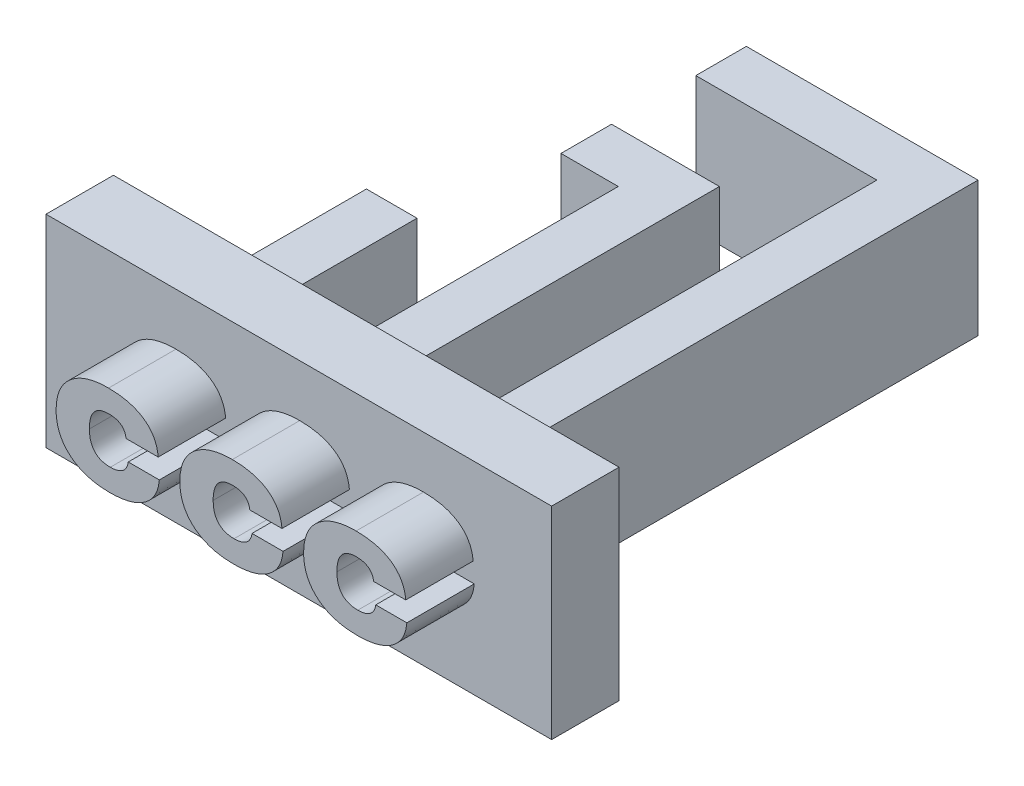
ISO-10303-21;
HEADER;
FILE_DESCRIPTION(('STEP AP214'),'2;1');
FILE_NAME('part.step','',(''),(''),'','','');
FILE_SCHEMA(('AUTOMOTIVE_DESIGN { 1 0 10303 214 1 1 1 1 }'));
ENDSEC;
DATA;
#1=APPLICATION_CONTEXT('core data for automotive mechanical design processes');
#2=APPLICATION_PROTOCOL_DEFINITION('international standard','automotive_design',2000,#1);
#3=PRODUCT_CONTEXT('',#1,'mechanical');
#4=PRODUCT('Part','Part','',(#3));
#5=PRODUCT_RELATED_PRODUCT_CATEGORY('part','',(#4));
#6=PRODUCT_DEFINITION_FORMATION('','',#4);
#7=PRODUCT_DEFINITION_CONTEXT('part definition',#1,'design');
#8=PRODUCT_DEFINITION('design','',#6,#7);
#9=PRODUCT_DEFINITION_SHAPE('','',#8);
#10=(LENGTH_UNIT() NAMED_UNIT(*) SI_UNIT(.MILLI.,.METRE.));
#11=(NAMED_UNIT(*) PLANE_ANGLE_UNIT() SI_UNIT($,.RADIAN.));
#12=(NAMED_UNIT(*) SI_UNIT($,.STERADIAN.) SOLID_ANGLE_UNIT());
#13=UNCERTAINTY_MEASURE_WITH_UNIT(LENGTH_MEASURE(1.E-05),#10,'distance_accuracy_value','');
#14=(GEOMETRIC_REPRESENTATION_CONTEXT(3) GLOBAL_UNCERTAINTY_ASSIGNED_CONTEXT((#13)) GLOBAL_UNIT_ASSIGNED_CONTEXT((#10,
#11,#12)) REPRESENTATION_CONTEXT('',''));
#15=CARTESIAN_POINT('',(0.,0.,0.));
#16=DIRECTION('',(0.,0.,1.));
#17=DIRECTION('',(1.,0.,0.));
#18=AXIS2_PLACEMENT_3D('',#15,#16,#17);
#19=CARTESIAN_POINT('',(7.5,-3.,0.));
#20=DIRECTION('',(0.,0.,1.));
#21=DIRECTION('',(1.,0.,0.));
#22=AXIS2_PLACEMENT_3D('',#19,#20,#21);
#23=PLANE('',#22);
#24=DIRECTION('',(0.,-1.,0.));
#25=VECTOR('',#24,1.);
#26=CARTESIAN_POINT('',(0.777353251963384,2.,0.));
#27=LINE('',#26,#25);
#28=CARTESIAN_POINT('',(0.777353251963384,2.,0.));
#29=VERTEX_POINT('',#28);
#30=CARTESIAN_POINT('',(0.777353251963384,-2.,0.));
#31=VERTEX_POINT('',#30);
#32=EDGE_CURVE('E51',#29,#31,#27,.T.);
#33=ORIENTED_EDGE('',*,*,#32,.F.);
#34=DIRECTION('',(1.,0.,0.));
#35=VECTOR('',#34,1.);
#36=CARTESIAN_POINT('',(-0.722646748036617,2.,0.));
#37=LINE('',#36,#35);
#38=CARTESIAN_POINT('',(-0.722646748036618,2.,0.));
#39=VERTEX_POINT('',#38);
#40=EDGE_CURVE('E46',#39,#29,#37,.T.);
#41=ORIENTED_EDGE('',*,*,#40,.F.);
#42=DIRECTION('',(0.,-1.,0.));
#43=VECTOR('',#42,1.);
#44=CARTESIAN_POINT('',(-0.722646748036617,2.,0.));
#45=LINE('',#44,#43);
#46=CARTESIAN_POINT('',(-0.722646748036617,-2.,0.));
#47=VERTEX_POINT('',#46);
#48=EDGE_CURVE('E393',#39,#47,#45,.T.);
#49=ORIENTED_EDGE('',*,*,#48,.T.);
#50=DIRECTION('',(1.,0.,0.));
#51=VECTOR('',#50,1.);
#52=CARTESIAN_POINT('',(-0.722646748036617,-2.,0.));
#53=LINE('',#52,#51);
#54=EDGE_CURVE('E376',#47,#31,#53,.T.);
#55=ORIENTED_EDGE('',*,*,#54,.T.);
#56=EDGE_LOOP('',(#33,#41,#49,#55));
#57=FACE_BOUND('',#56,.T.);
#58=DIRECTION('',(0.,-1.,0.));
#59=VECTOR('',#58,1.);
#60=CARTESIAN_POINT('',(-2.89402538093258,2.,0.));
#61=LINE('',#60,#59);
#62=CARTESIAN_POINT('',(-2.89402538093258,2.,0.));
#63=VERTEX_POINT('',#62);
#64=CARTESIAN_POINT('',(-2.89402538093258,-2.,0.));
#65=VERTEX_POINT('',#64);
#66=EDGE_CURVE('E420',#63,#65,#61,.T.);
#67=ORIENTED_EDGE('',*,*,#66,.F.);
#68=DIRECTION('',(1.,0.,0.));
#69=VECTOR('',#68,1.);
#70=CARTESIAN_POINT('',(-4.39402538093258,2.,0.));
#71=LINE('',#70,#69);
#72=CARTESIAN_POINT('',(-4.39402538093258,2.,0.));
#73=VERTEX_POINT('',#72);
#74=EDGE_CURVE('E399',#73,#63,#71,.T.);
#75=ORIENTED_EDGE('',*,*,#74,.F.);
#76=DIRECTION('',(0.,-1.,0.));
#77=VECTOR('',#76,1.);
#78=CARTESIAN_POINT('',(-4.39402538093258,2.,0.));
#79=LINE('',#78,#77);
#80=CARTESIAN_POINT('',(-4.39402538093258,-2.,0.));
#81=VERTEX_POINT('',#80);
#82=EDGE_CURVE('E423',#73,#81,#79,.T.);
#83=ORIENTED_EDGE('',*,*,#82,.T.);
#84=DIRECTION('',(1.,0.,0.));
#85=VECTOR('',#84,1.);
#86=CARTESIAN_POINT('',(-4.39402538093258,-2.,0.));
#87=LINE('',#86,#85);
#88=EDGE_CURVE('E410',#81,#65,#87,.T.);
#89=ORIENTED_EDGE('',*,*,#88,.T.);
#90=EDGE_LOOP('',(#67,#75,#83,#89));
#91=FACE_BOUND('',#90,.T.);
#92=DIRECTION('',(0.,1.,0.));
#93=VECTOR('',#92,1.);
#94=CARTESIAN_POINT('',(7.5,3.,0.));
#95=LINE('',#94,#93);
#96=CARTESIAN_POINT('',(7.5,-3.,0.));
#97=VERTEX_POINT('',#96);
#98=CARTESIAN_POINT('',(7.5,3.,0.));
#99=VERTEX_POINT('',#98);
#100=EDGE_CURVE('E663',#97,#99,#95,.T.);
#101=ORIENTED_EDGE('',*,*,#100,.F.);
#102=DIRECTION('',(1.,0.,0.));
#103=VECTOR('',#102,1.);
#104=CARTESIAN_POINT('',(-7.5,-3.,0.));
#105=LINE('',#104,#103);
#106=CARTESIAN_POINT('',(-7.5,-3.,0.));
#107=VERTEX_POINT('',#106);
#108=EDGE_CURVE('E671',#107,#97,#105,.T.);
#109=ORIENTED_EDGE('',*,*,#108,.F.);
#110=DIRECTION('',(0.,-1.,0.));
#111=VECTOR('',#110,1.);
#112=CARTESIAN_POINT('',(-7.5,3.,0.));
#113=LINE('',#112,#111);
#114=CARTESIAN_POINT('',(-7.5,3.,0.));
#115=VERTEX_POINT('',#114);
#116=EDGE_CURVE('E662',#115,#107,#113,.T.);
#117=ORIENTED_EDGE('',*,*,#116,.F.);
#118=DIRECTION('',(-1.,0.,0.));
#119=VECTOR('',#118,1.);
#120=CARTESIAN_POINT('',(-7.5,3.,0.));
#121=LINE('',#120,#119);
#122=EDGE_CURVE('E654',#99,#115,#121,.T.);
#123=ORIENTED_EDGE('',*,*,#122,.F.);
#124=EDGE_LOOP('',(#101,#109,#117,#123));
#125=FACE_BOUND('',#124,.T.);
#126=DIRECTION('',(1.,0.,0.));
#127=VECTOR('',#126,1.);
#128=CARTESIAN_POINT('',(2.94873188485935,2.,0.));
#129=LINE('',#128,#127);
#130=CARTESIAN_POINT('',(2.94873188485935,2.,0.));
#131=VERTEX_POINT('',#130);
#132=CARTESIAN_POINT('',(4.44873188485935,2.,0.));
#133=VERTEX_POINT('',#132);
#134=EDGE_CURVE('E428',#131,#133,#129,.T.);
#135=ORIENTED_EDGE('',*,*,#134,.F.);
#136=DIRECTION('',(0.,-1.,0.));
#137=VECTOR('',#136,1.);
#138=CARTESIAN_POINT('',(2.94873188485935,2.,0.));
#139=LINE('',#138,#137);
#140=CARTESIAN_POINT('',(2.94873188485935,-2.,0.));
#141=VERTEX_POINT('',#140);
#142=EDGE_CURVE('E466',#131,#141,#139,.T.);
#143=ORIENTED_EDGE('',*,*,#142,.T.);
#144=DIRECTION('',(1.,0.,0.));
#145=VECTOR('',#144,1.);
#146=CARTESIAN_POINT('',(2.94873188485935,-2.,0.));
#147=LINE('',#146,#145);
#148=CARTESIAN_POINT('',(4.44873188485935,-2.,0.));
#149=VERTEX_POINT('',#148);
#150=EDGE_CURVE('E442',#141,#149,#147,.T.);
#151=ORIENTED_EDGE('',*,*,#150,.T.);
#152=DIRECTION('',(0.,-1.,0.));
#153=VECTOR('',#152,1.);
#154=CARTESIAN_POINT('',(4.44873188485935,2.,0.));
#155=LINE('',#154,#153);
#156=EDGE_CURVE('E463',#133,#149,#155,.T.);
#157=ORIENTED_EDGE('',*,*,#156,.F.);
#158=EDGE_LOOP('',(#135,#143,#151,#157));
#159=FACE_BOUND('',#158,.T.);
#160=ADVANCED_FACE('F31',(#57,#91,#125,#159),#23,.F.);
#161=CARTESIAN_POINT('',(7.5,3.,2.));
#162=DIRECTION('',(-1.,0.,0.));
#163=DIRECTION('',(0.,0.,1.));
#164=AXIS2_PLACEMENT_3D('',#161,#162,#163);
#165=PLANE('',#164);
#166=ORIENTED_EDGE('',*,*,#100,.T.);
#167=DIRECTION('',(0.,0.,-1.));
#168=VECTOR('',#167,1.);
#169=CARTESIAN_POINT('',(7.5,3.,2.));
#170=LINE('',#169,#168);
#171=CARTESIAN_POINT('',(7.5,3.,2.));
#172=VERTEX_POINT('',#171);
#173=EDGE_CURVE('E11',#172,#99,#170,.T.);
#174=ORIENTED_EDGE('',*,*,#173,.F.);
#175=DIRECTION('',(0.,1.,0.));
#176=VECTOR('',#175,1.);
#177=CARTESIAN_POINT('',(7.5,3.,2.));
#178=LINE('',#177,#176);
#179=CARTESIAN_POINT('',(7.5,-3.,2.));
#180=VERTEX_POINT('',#179);
#181=EDGE_CURVE('E673',#180,#172,#178,.T.);
#182=ORIENTED_EDGE('',*,*,#181,.F.);
#183=DIRECTION('',(0.,0.,-1.));
#184=VECTOR('',#183,1.);
#185=CARTESIAN_POINT('',(7.5,-3.,2.));
#186=LINE('',#185,#184);
#187=EDGE_CURVE('E677',#180,#97,#186,.T.);
#188=ORIENTED_EDGE('',*,*,#187,.T.);
#189=EDGE_LOOP('',(#166,#174,#182,#188));
#190=FACE_BOUND('',#189,.T.);
#191=ADVANCED_FACE('F33',(#190),#165,.F.);
#192=CARTESIAN_POINT('',(-7.5,3.,2.));
#193=DIRECTION('',(0.,-1.,0.));
#194=DIRECTION('',(0.,0.,-1.));
#195=AXIS2_PLACEMENT_3D('',#192,#193,#194);
#196=PLANE('',#195);
#197=ORIENTED_EDGE('',*,*,#122,.T.);
#198=DIRECTION('',(0.,0.,-1.));
#199=VECTOR('',#198,1.);
#200=CARTESIAN_POINT('',(-7.5,3.,2.));
#201=LINE('',#200,#199);
#202=CARTESIAN_POINT('',(-7.5,3.,2.));
#203=VERTEX_POINT('',#202);
#204=EDGE_CURVE('E39',#203,#115,#201,.T.);
#205=ORIENTED_EDGE('',*,*,#204,.F.);
#206=DIRECTION('',(-1.,0.,0.));
#207=VECTOR('',#206,1.);
#208=CARTESIAN_POINT('',(-7.5,3.,2.));
#209=LINE('',#208,#207);
#210=EDGE_CURVE('E687',#172,#203,#209,.T.);
#211=ORIENTED_EDGE('',*,*,#210,.F.);
#212=ORIENTED_EDGE('',*,*,#173,.T.);
#213=EDGE_LOOP('',(#197,#205,#211,#212));
#214=FACE_BOUND('',#213,.T.);
#215=ADVANCED_FACE('F645',(#214),#196,.F.);
#216=CARTESIAN_POINT('',(-7.5,3.,2.));
#217=DIRECTION('',(1.,0.,0.));
#218=DIRECTION('',(0.,1.,0.));
#219=AXIS2_PLACEMENT_3D('',#216,#217,#218);
#220=PLANE('',#219);
#221=ORIENTED_EDGE('',*,*,#116,.T.);
#222=DIRECTION('',(0.,0.,-1.));
#223=VECTOR('',#222,1.);
#224=CARTESIAN_POINT('',(-7.5,-3.,2.));
#225=LINE('',#224,#223);
#226=CARTESIAN_POINT('',(-7.5,-3.,2.));
#227=VERTEX_POINT('',#226);
#228=EDGE_CURVE('E668',#227,#107,#225,.T.);
#229=ORIENTED_EDGE('',*,*,#228,.F.);
#230=DIRECTION('',(0.,-1.,0.));
#231=VECTOR('',#230,1.);
#232=CARTESIAN_POINT('',(-7.5,3.,2.));
#233=LINE('',#232,#231);
#234=EDGE_CURVE('E667',#203,#227,#233,.T.);
#235=ORIENTED_EDGE('',*,*,#234,.F.);
#236=ORIENTED_EDGE('',*,*,#204,.T.);
#237=EDGE_LOOP('',(#221,#229,#235,#236));
#238=FACE_BOUND('',#237,.T.);
#239=ADVANCED_FACE('F642',(#238),#220,.F.);
#240=CARTESIAN_POINT('',(-7.5,-3.,2.));
#241=DIRECTION('',(0.,1.,0.));
#242=DIRECTION('',(0.,0.,1.));
#243=AXIS2_PLACEMENT_3D('',#240,#241,#242);
#244=PLANE('',#243);
#245=ORIENTED_EDGE('',*,*,#108,.T.);
#246=ORIENTED_EDGE('',*,*,#187,.F.);
#247=DIRECTION('',(1.,0.,0.));
#248=VECTOR('',#247,1.);
#249=CARTESIAN_POINT('',(-7.5,-3.,2.));
#250=LINE('',#249,#248);
#251=EDGE_CURVE('E680',#227,#180,#250,.T.);
#252=ORIENTED_EDGE('',*,*,#251,.F.);
#253=ORIENTED_EDGE('',*,*,#228,.T.);
#254=EDGE_LOOP('',(#245,#246,#252,#253));
#255=FACE_BOUND('',#254,.T.);
#256=ADVANCED_FACE('F636',(#255),#244,.F.);
#257=CARTESIAN_POINT('',(7.5,-3.,2.));
#258=DIRECTION('',(0.,0.,1.));
#259=DIRECTION('',(1.,0.,0.));
#260=AXIS2_PLACEMENT_3D('',#257,#258,#259);
#261=PLANE('',#260);
#262=CARTESIAN_POINT('',(3.75018057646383,-0.548216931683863,2.));
#263=CARTESIAN_POINT('',(3.76923422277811,-0.548008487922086,2.));
#264=CARTESIAN_POINT('',(3.80638653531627,-0.547602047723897,2.));
#265=CARTESIAN_POINT('',(3.86042622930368,-0.541902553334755,2.));
#266=CARTESIAN_POINT('',(3.91170533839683,-0.534930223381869,2.));
#267=CARTESIAN_POINT('',(3.95947869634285,-0.522562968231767,2.));
#268=CARTESIAN_POINT('',(4.00474997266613,-0.508440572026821,2.));
#269=CARTESIAN_POINT('',(4.04680617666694,-0.490511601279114,2.));
#270=CARTESIAN_POINT('',(4.08575919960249,-0.469088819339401,2.));
#271=CARTESIAN_POINT('',(4.12188220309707,-0.445176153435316,2.));
#272=CARTESIAN_POINT('',(4.15444243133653,-0.417525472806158,2.));
#273=CARTESIAN_POINT('',(4.18407108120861,-0.387396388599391,2.));
#274=CARTESIAN_POINT('',(4.20909068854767,-0.353410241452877,2.));
#275=CARTESIAN_POINT('',(4.23159651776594,-0.317572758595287,2.));
#276=CARTESIAN_POINT('',(4.24937406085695,-0.27845141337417,2.));
#277=CARTESIAN_POINT('',(4.26454049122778,-0.237099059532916,2.));
#278=CARTESIAN_POINT('',(4.27593323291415,-0.192623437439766,2.));
#279=CARTESIAN_POINT('',(4.28039113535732,-0.161718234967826,2.));
#280=CARTESIAN_POINT('',(4.28267453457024,-0.1458881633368,2.));
#281=B_SPLINE_CURVE_WITH_KNOTS('',3,(#262,#263,#264,#265,#266,#267,#268,#269,#270,#271,#272,
#273,#274,#275,#276,#277,#278,#279,#280),.UNSPECIFIED.,.F.,.F.,(4,1,1,1,1,1,1,1,1,1,1,1,1,1,1,1,
4),(0.,0.0770820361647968,0.150300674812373,0.219808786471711,0.28631246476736,
0.349756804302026,0.411647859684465,0.470982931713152,0.529512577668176,0.586663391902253,
0.643611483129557,0.700117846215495,0.757146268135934,0.814599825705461,0.873670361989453,
0.935292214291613,1.),.UNSPECIFIED.);
#282=CARTESIAN_POINT('',(3.75018057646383,-0.548216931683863,2.));
#283=VERTEX_POINT('',#282);
#284=CARTESIAN_POINT('',(4.28267453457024,-0.1458881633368,2.));
#285=VERTEX_POINT('',#284);
#286=EDGE_CURVE('E469',#283,#285,#281,.T.);
#287=ORIENTED_EDGE('',*,*,#286,.T.);
#288=DIRECTION('',(1.,0.,0.));
#289=VECTOR('',#288,1.);
#290=CARTESIAN_POINT('',(4.28267453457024,-0.1458881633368,2.));
#291=LINE('',#290,#289);
#292=CARTESIAN_POINT('',(5.20463508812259,-0.1458881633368,2.));
#293=VERTEX_POINT('',#292);
#294=EDGE_CURVE('E1374',#285,#293,#291,.T.);
#295=ORIENTED_EDGE('',*,*,#294,.T.);
#296=CARTESIAN_POINT('',(5.20463508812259,-0.1458881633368,2.));
#297=CARTESIAN_POINT('',(5.20008641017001,-0.186817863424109,2.));
#298=CARTESIAN_POINT('',(5.19116536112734,-0.267090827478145,2.));
#299=CARTESIAN_POINT('',(5.16498809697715,-0.383345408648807,2.));
#300=CARTESIAN_POINT('',(5.12694629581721,-0.492138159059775,2.));
#301=CARTESIAN_POINT('',(5.07913280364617,-0.594453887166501,2.));
#302=CARTESIAN_POINT('',(5.01966245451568,-0.689286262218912,2.));
#303=CARTESIAN_POINT('',(4.94948905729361,-0.777226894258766,2.));
#304=CARTESIAN_POINT('',(4.86826034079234,-0.857513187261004,2.));
#305=CARTESIAN_POINT('',(4.7768247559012,-0.930702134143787,2.));
#306=CARTESIAN_POINT('',(4.67583553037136,-0.996049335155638,2.));
#307=CARTESIAN_POINT('',(4.56577506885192,-1.05259551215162,2.));
#308=CARTESIAN_POINT('',(4.4473023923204,-1.10057830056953,2.));
#309=CARTESIAN_POINT('',(4.32022413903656,-1.13954477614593,2.));
#310=CARTESIAN_POINT('',(4.18464499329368,-1.16976683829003,2.));
#311=CARTESIAN_POINT('',(4.04053786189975,-1.19092031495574,2.));
#312=CARTESIAN_POINT('',(3.88816518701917,-1.20483844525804,2.));
#313=CARTESIAN_POINT('',(3.78365437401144,-1.20610920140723,2.));
#314=CARTESIAN_POINT('',(3.73011558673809,-1.20676018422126,2.));
#315=B_SPLINE_CURVE_WITH_KNOTS('',3,(#296,#297,#298,#299,#300,#301,#302,#303,#304,#305,#306,
#307,#308,#309,#310,#311,#312,#313,#314),.UNSPECIFIED.,.F.,.F.,(4,1,1,1,1,1,1,1,1,1,1,1,1,1,1,1,
4),(0.,0.0610518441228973,0.119737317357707,0.176290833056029,0.231705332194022,
0.286899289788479,0.341920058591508,0.398219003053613,0.455941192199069,0.515349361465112,
0.576329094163,0.639200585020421,0.70469424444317,0.773256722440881,0.845026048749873,
0.920609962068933,1.),.UNSPECIFIED.);
#316=CARTESIAN_POINT('',(3.73011558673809,-1.20676018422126,2.));
#317=VERTEX_POINT('',#316);
#318=EDGE_CURVE('E1379',#293,#317,#315,.T.);
#319=ORIENTED_EDGE('',*,*,#318,.T.);
#320=CARTESIAN_POINT('',(3.73011558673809,-1.20676018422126,2.));
#321=CARTESIAN_POINT('',(3.67005422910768,-1.20568187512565,2.));
#322=CARTESIAN_POINT('',(3.55295532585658,-1.20357954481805,2.));
#323=CARTESIAN_POINT('',(3.38234757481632,-1.18702874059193,2.));
#324=CARTESIAN_POINT('',(3.22162571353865,-1.15952422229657,2.));
#325=CARTESIAN_POINT('',(3.07060588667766,-1.12046774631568,2.));
#326=CARTESIAN_POINT('',(2.92936772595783,-1.07011731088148,2.));
#327=CARTESIAN_POINT('',(2.79773925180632,-1.00899923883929,2.));
#328=CARTESIAN_POINT('',(2.67670458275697,-0.935714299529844,2.));
#329=CARTESIAN_POINT('',(2.58332866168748,-0.866298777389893,2.));
#330=CARTESIAN_POINT('',(2.51489596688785,-0.805196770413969,2.));
#331=CARTESIAN_POINT('',(2.46663121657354,-0.757629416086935,2.));
#332=CARTESIAN_POINT('',(2.42184939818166,-0.707879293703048,2.));
#333=CARTESIAN_POINT('',(2.38095745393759,-0.655502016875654,2.));
#334=CARTESIAN_POINT('',(2.34173979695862,-0.602324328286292,2.));
#335=CARTESIAN_POINT('',(2.30755642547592,-0.54583578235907,2.));
#336=CARTESIAN_POINT('',(2.27622544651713,-0.487757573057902,2.));
#337=CARTESIAN_POINT('',(2.2475299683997,-0.427867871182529,2.));
#338=CARTESIAN_POINT('',(2.22305083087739,-0.36549207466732,2.));
#339=CARTESIAN_POINT('',(2.20158765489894,-0.30123060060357,2.));
#340=CARTESIAN_POINT('',(2.18251067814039,-0.235142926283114,2.));
#341=CARTESIAN_POINT('',(2.16878428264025,-0.166525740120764,2.));
#342=CARTESIAN_POINT('',(2.15647417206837,-0.096102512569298,2.));
#343=CARTESIAN_POINT('',(2.14865833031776,-0.0235741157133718,2.));
#344=CARTESIAN_POINT('',(2.14309496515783,0.0509016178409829,2.));
#345=CARTESIAN_POINT('',(2.14264005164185,0.101226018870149,2.));
#346=CARTESIAN_POINT('',(2.14240896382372,0.126789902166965,2.));
#347=B_SPLINE_CURVE_WITH_KNOTS('',3,(#320,#321,#322,#323,#324,#325,#326,#327,#328,#329,#330,
#331,#332,#333,#334,#335,#336,#337,#338,#339,#340,#341,#342,#343,#344,#345,#346),.UNSPECIFIED.,
.F.,.F.,(4,1,1,1,1,1,1,1,1,1,1,1,1,1,1,1,1,1,1,1,1,1,1,1,4),(0.,0.0768479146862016,
0.149826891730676,0.219099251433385,0.285315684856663,0.349177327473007,0.410733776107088,
0.470688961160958,0.529942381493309,0.559320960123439,0.588029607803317,0.616624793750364,
0.644900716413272,0.673040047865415,0.701118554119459,0.729299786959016,0.757473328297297,
0.786040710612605,0.814979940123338,0.844160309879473,0.873987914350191,0.904474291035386,
0.935616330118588,0.96729426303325,1.),.UNSPECIFIED.);
#348=CARTESIAN_POINT('',(2.14240896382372,0.126789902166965,2.));
#349=VERTEX_POINT('',#348);
#350=EDGE_CURVE('E1383',#317,#349,#347,.T.);
#351=ORIENTED_EDGE('',*,*,#350,.T.);
#352=CARTESIAN_POINT('',(2.14240896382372,0.126789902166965,2.));
#353=CARTESIAN_POINT('',(2.1426548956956,0.152180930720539,2.));
#354=CARTESIAN_POINT('',(2.14314229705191,0.202502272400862,2.));
#355=CARTESIAN_POINT('',(2.14854817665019,0.276824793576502,2.));
#356=CARTESIAN_POINT('',(2.15666434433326,0.349110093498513,2.));
#357=CARTESIAN_POINT('',(2.16811794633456,0.419303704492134,2.));
#358=CARTESIAN_POINT('',(2.18214962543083,0.487612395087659,2.));
#359=CARTESIAN_POINT('',(2.20057950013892,0.553751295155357,2.));
#360=CARTESIAN_POINT('',(2.22123043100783,0.6180389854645,2.));
#361=CARTESIAN_POINT('',(2.2463943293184,0.679989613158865,2.));
#362=CARTESIAN_POINT('',(2.27383137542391,0.740111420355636,2.));
#363=CARTESIAN_POINT('',(2.30511150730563,0.797974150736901,2.));
#364=CARTESIAN_POINT('',(2.33884112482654,0.854253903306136,2.));
#365=CARTESIAN_POINT('',(2.37663433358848,0.90813319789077,2.));
#366=CARTESIAN_POINT('',(2.41707094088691,0.960385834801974,2.));
#367=CARTESIAN_POINT('',(2.46180714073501,1.0096888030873,2.));
#368=CARTESIAN_POINT('',(2.50898814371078,1.05762790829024,2.));
#369=CARTESIAN_POINT('',(2.57641649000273,1.11879755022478,2.));
#370=CARTESIAN_POINT('',(2.66774862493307,1.18906666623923,2.));
#371=CARTESIAN_POINT('',(2.78739171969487,1.26158171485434,2.));
#372=CARTESIAN_POINT('',(2.91603375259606,1.32390561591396,2.));
#373=CARTESIAN_POINT('',(3.05460220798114,1.37328263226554,2.));
#374=CARTESIAN_POINT('',(3.20222926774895,1.41258411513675,2.));
#375=CARTESIAN_POINT('',(3.35930598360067,1.4406885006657,2.));
#376=CARTESIAN_POINT('',(3.52602663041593,1.45711866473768,2.));
#377=CARTESIAN_POINT('',(3.64021463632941,1.45924851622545,2.));
#378=CARTESIAN_POINT('',(3.69873188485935,1.46033998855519,2.));
#379=B_SPLINE_CURVE_WITH_KNOTS('',3,(#352,#353,#354,#355,#356,#357,#358,#359,#360,#361,#362,
#363,#364,#365,#366,#367,#368,#369,#370,#371,#372,#373,#374,#375,#376,#377,#378),.UNSPECIFIED.,
.F.,.F.,(4,1,1,1,1,1,1,1,1,1,1,1,1,1,1,1,1,1,1,1,1,1,1,1,4),(0.,0.032872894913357,
0.065149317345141,0.0964412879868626,0.127035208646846,0.157217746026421,0.186685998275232,
0.215899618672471,0.244600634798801,0.273216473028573,0.30143228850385,0.329729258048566,
0.358127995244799,0.386603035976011,0.41522490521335,0.444275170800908,0.473673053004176,
0.533058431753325,0.593157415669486,0.654538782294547,0.717831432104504,0.783332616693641,
0.852155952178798,0.924235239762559,1.),.UNSPECIFIED.);
#380=CARTESIAN_POINT('',(3.69873188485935,1.46033998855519,2.));
#381=VERTEX_POINT('',#380);
#382=EDGE_CURVE('E1390',#349,#381,#379,.T.);
#383=ORIENTED_EDGE('',*,*,#382,.T.);
#384=CARTESIAN_POINT('',(3.69873188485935,1.46033998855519,2.));
#385=CARTESIAN_POINT('',(3.75261185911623,1.45965404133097,2.));
#386=CARTESIAN_POINT('',(3.85778931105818,1.45831502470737,2.));
#387=CARTESIAN_POINT('',(4.0109777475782,1.44489830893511,2.));
#388=CARTESIAN_POINT('',(4.15547482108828,1.42501451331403,2.));
#389=CARTESIAN_POINT('',(4.29101445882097,1.39561301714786,2.));
#390=CARTESIAN_POINT('',(4.41769201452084,1.35775750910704,2.));
#391=CARTESIAN_POINT('',(4.53565702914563,1.31139931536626,2.));
#392=CARTESIAN_POINT('',(4.64476917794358,1.2568023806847,2.));
#393=CARTESIAN_POINT('',(4.74483529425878,1.19407991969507,2.));
#394=CARTESIAN_POINT('',(4.83546913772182,1.12349615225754,2.));
#395=CARTESIAN_POINT('',(4.91544810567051,1.04504875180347,2.));
#396=CARTESIAN_POINT('',(4.98527765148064,0.959432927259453,2.));
#397=CARTESIAN_POINT('',(5.04388434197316,0.866301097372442,2.));
#398=CARTESIAN_POINT('',(5.0929538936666,0.766268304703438,2.));
#399=CARTESIAN_POINT('',(5.12997468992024,0.658660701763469,2.));
#400=CARTESIAN_POINT('',(5.15809312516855,0.544165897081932,2.));
#401=CARTESIAN_POINT('',(5.16709939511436,0.464783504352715,2.));
#402=CARTESIAN_POINT('',(5.17170792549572,0.424163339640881,2.));
#403=B_SPLINE_CURVE_WITH_KNOTS('',3,(#384,#385,#386,#387,#388,#389,#390,#391,#392,#393,#394,
#395,#396,#397,#398,#399,#400,#401,#402),.UNSPECIFIED.,.F.,.F.,(4,1,1,1,1,1,1,1,1,1,1,1,1,1,1,1,
4),(0.,0.0806023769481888,0.157341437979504,0.229922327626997,0.298727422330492,
0.364648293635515,0.427549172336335,0.488142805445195,0.546951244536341,0.603982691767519,
0.659691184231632,0.71423621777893,0.768910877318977,0.823998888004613,0.880566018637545,
0.93888533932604,1.),.UNSPECIFIED.);
#404=CARTESIAN_POINT('',(5.17170792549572,0.424163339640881,2.));
#405=VERTEX_POINT('',#404);
#406=EDGE_CURVE('E1397',#381,#405,#403,.T.);
#407=ORIENTED_EDGE('',*,*,#406,.T.);
#408=DIRECTION('',(-1.,0.,0.));
#409=VECTOR('',#408,1.);
#410=CARTESIAN_POINT('',(5.17170792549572,0.424163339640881,2.));
#411=LINE('',#410,#409);
#412=CARTESIAN_POINT('',(4.2168202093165,0.424163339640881,2.));
#413=VERTEX_POINT('',#412);
#414=EDGE_CURVE('E1404',#405,#413,#411,.T.);
#415=ORIENTED_EDGE('',*,*,#414,.T.);
#416=CARTESIAN_POINT('',(4.2168202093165,0.424163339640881,2.));
#417=CARTESIAN_POINT('',(4.21486971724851,0.439301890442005,2.));
#418=CARTESIAN_POINT('',(4.211047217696,0.468969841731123,2.));
#419=CARTESIAN_POINT('',(4.20071712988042,0.511730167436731,2.));
#420=CARTESIAN_POINT('',(4.18675829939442,0.551467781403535,2.));
#421=CARTESIAN_POINT('',(4.16974007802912,0.588472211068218,2.));
#422=CARTESIAN_POINT('',(4.14912698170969,0.62241834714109,2.));
#423=CARTESIAN_POINT('',(4.12519644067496,0.653683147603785,2.));
#424=CARTESIAN_POINT('',(4.09787714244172,0.682137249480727,2.));
#425=CARTESIAN_POINT('',(4.06682436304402,0.707329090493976,2.));
#426=CARTESIAN_POINT('',(4.03244386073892,0.729615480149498,2.));
#427=CARTESIAN_POINT('',(3.99490896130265,0.749134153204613,2.));
#428=CARTESIAN_POINT('',(3.95405562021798,0.765576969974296,2.));
#429=CARTESIAN_POINT('',(3.90999178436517,0.778992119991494,2.));
#430=CARTESIAN_POINT('',(3.86265217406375,0.789183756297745,2.));
#431=CARTESIAN_POINT('',(3.81207589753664,0.796119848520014,2.));
#432=CARTESIAN_POINT('',(3.75833608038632,0.801027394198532,2.));
#433=CARTESIAN_POINT('',(3.72138124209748,0.801535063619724,2.));
#434=CARTESIAN_POINT('',(3.70233329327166,0.801796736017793,2.));
#435=B_SPLINE_CURVE_WITH_KNOTS('',3,(#416,#417,#418,#419,#420,#421,#422,#423,#424,#425,#426,
#427,#428,#429,#430,#431,#432,#433,#434),.UNSPECIFIED.,.F.,.F.,(4,1,1,1,1,1,1,1,1,1,1,1,1,1,1,1,
4),(0.,0.064245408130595,0.125905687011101,0.18483663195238,0.241382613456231,0.297120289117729,
0.351723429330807,0.40688729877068,0.462835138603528,0.519725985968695,0.579163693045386,
0.640722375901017,0.704919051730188,0.77291552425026,0.844411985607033,0.919803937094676,1.),.UNSPECIFIED.);
#436=CARTESIAN_POINT('',(3.70233329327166,0.801796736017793,2.));
#437=VERTEX_POINT('',#436);
#438=EDGE_CURVE('E1409',#413,#437,#435,.T.);
#439=ORIENTED_EDGE('',*,*,#438,.T.);
#440=CARTESIAN_POINT('',(3.70233329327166,0.801796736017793,2.));
#441=CARTESIAN_POINT('',(3.67916111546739,0.801322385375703,2.));
#442=CARTESIAN_POINT('',(3.63422377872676,0.800402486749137,2.));
#443=CARTESIAN_POINT('',(3.56906135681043,0.792761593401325,2.));
#444=CARTESIAN_POINT('',(3.50858377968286,0.77939117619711,2.));
#445=CARTESIAN_POINT('',(3.45250279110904,0.760839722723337,2.));
#446=CARTESIAN_POINT('',(3.40072313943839,0.737056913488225,2.));
#447=CARTESIAN_POINT('',(3.35313293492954,0.708404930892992,2.));
#448=CARTESIAN_POINT('',(3.31035780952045,0.673837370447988,2.));
#449=CARTESIAN_POINT('',(3.27212924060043,0.63409120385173,2.));
#450=CARTESIAN_POINT('',(3.23865146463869,0.588767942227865,2.));
#451=CARTESIAN_POINT('',(3.20887478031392,0.538692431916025,2.));
#452=CARTESIAN_POINT('',(3.18510966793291,0.482571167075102,2.));
#453=CARTESIAN_POINT('',(3.16494901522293,0.421494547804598,2.));
#454=CARTESIAN_POINT('',(3.14909330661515,0.3550710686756,2.));
#455=CARTESIAN_POINT('',(3.13797303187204,0.283334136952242,2.));
#456=CARTESIAN_POINT('',(3.1311813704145,0.206324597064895,2.));
#457=CARTESIAN_POINT('',(3.13055014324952,0.153214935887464,2.));
#458=CARTESIAN_POINT('',(3.1302238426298,0.125760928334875,2.));
#459=B_SPLINE_CURVE_WITH_KNOTS('',3,(#440,#441,#442,#443,#444,#445,#446,#447,#448,#449,#450,
#451,#452,#453,#454,#455,#456,#457,#458),.UNSPECIFIED.,.F.,.F.,(4,1,1,1,1,1,1,1,1,1,1,1,1,1,1,1,
4),(0.,0.0685158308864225,0.132871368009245,0.193658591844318,0.251396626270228,
0.307222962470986,0.361847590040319,0.415233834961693,0.469397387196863,0.524476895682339,
0.581538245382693,0.641275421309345,0.704306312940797,0.771594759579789,0.84296989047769,
0.918826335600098,1.),.UNSPECIFIED.);
#460=CARTESIAN_POINT('',(3.1302238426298,0.125760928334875,2.));
#461=VERTEX_POINT('',#460);
#462=EDGE_CURVE('E1413',#437,#461,#459,.T.);
#463=ORIENTED_EDGE('',*,*,#462,.T.);
#464=CARTESIAN_POINT('',(3.1302238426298,0.125760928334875,2.));
#465=CARTESIAN_POINT('',(3.13073353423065,0.0988200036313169,2.));
#466=CARTESIAN_POINT('',(3.13172236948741,0.0465528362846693,2.));
#467=CARTESIAN_POINT('',(3.13888188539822,-0.0293042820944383,2.));
#468=CARTESIAN_POINT('',(3.15101179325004,-0.100083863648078,2.));
#469=CARTESIAN_POINT('',(3.16867450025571,-0.165772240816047,2.));
#470=CARTESIAN_POINT('',(3.19048770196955,-0.226559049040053,2.));
#471=CARTESIAN_POINT('',(3.21749596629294,-0.28230809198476,2.));
#472=CARTESIAN_POINT('',(3.24937068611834,-0.333065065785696,2.));
#473=CARTESIAN_POINT('',(3.28670320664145,-0.378504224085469,2.));
#474=CARTESIAN_POINT('',(3.32846106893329,-0.4190121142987,2.));
#475=CARTESIAN_POINT('',(3.37533298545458,-0.453622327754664,2.));
#476=CARTESIAN_POINT('',(3.42649155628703,-0.483220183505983,2.));
#477=CARTESIAN_POINT('',(3.48259870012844,-0.506780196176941,2.));
#478=CARTESIAN_POINT('',(3.54311018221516,-0.525328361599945,2.));
#479=CARTESIAN_POINT('',(3.60807578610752,-0.538434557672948,2.));
#480=CARTESIAN_POINT('',(3.67758000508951,-0.547030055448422,2.));
#481=CARTESIAN_POINT('',(3.72545792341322,-0.547812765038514,2.));
#482=CARTESIAN_POINT('',(3.75018057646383,-0.548216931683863,2.));
#483=B_SPLINE_CURVE_WITH_KNOTS('',3,(#464,#465,#466,#467,#468,#469,#470,#471,#472,#473,#474,
#475,#476,#477,#478,#479,#480,#481,#482),.UNSPECIFIED.,.F.,.F.,(4,1,1,1,1,1,1,1,1,1,1,1,1,1,1,1,
4),(0.,0.0771545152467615,0.149684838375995,0.21800138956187,0.282578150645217,
0.344265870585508,0.402699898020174,0.459659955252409,0.515507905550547,0.570741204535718,
0.625852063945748,0.681962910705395,0.739621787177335,0.799748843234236,0.862941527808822,
0.929227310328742,1.),.UNSPECIFIED.);
#484=EDGE_CURVE('E477',#461,#283,#483,.T.);
#485=ORIENTED_EDGE('',*,*,#484,.T.);
#486=EDGE_LOOP('',(#287,#295,#319,#351,#383,#407,#415,#439,#463,#485));
#487=FACE_BOUND('',#486,.T.);
#488=CARTESIAN_POINT('',(0.0788019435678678,-0.548216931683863,2.));
#489=CARTESIAN_POINT('',(0.0978555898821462,-0.548008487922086,2.));
#490=CARTESIAN_POINT('',(0.135007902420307,-0.547602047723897,2.));
#491=CARTESIAN_POINT('',(0.189047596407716,-0.541902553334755,2.));
#492=CARTESIAN_POINT('',(0.240326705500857,-0.534930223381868,2.));
#493=CARTESIAN_POINT('',(0.288100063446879,-0.522562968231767,2.));
#494=CARTESIAN_POINT('',(0.333371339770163,-0.508440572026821,2.));
#495=CARTESIAN_POINT('',(0.375427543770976,-0.490511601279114,2.));
#496=CARTESIAN_POINT('',(0.414380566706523,-0.469088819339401,2.));
#497=CARTESIAN_POINT('',(0.450503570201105,-0.445176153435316,2.));
#498=CARTESIAN_POINT('',(0.483063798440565,-0.417525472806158,2.));
#499=CARTESIAN_POINT('',(0.512692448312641,-0.387396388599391,2.));
#500=CARTESIAN_POINT('',(0.537712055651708,-0.353410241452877,2.));
#501=CARTESIAN_POINT('',(0.560217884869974,-0.317572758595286,2.));
#502=CARTESIAN_POINT('',(0.577995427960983,-0.278451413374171,2.));
#503=CARTESIAN_POINT('',(0.593161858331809,-0.237099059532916,2.));
#504=CARTESIAN_POINT('',(0.604554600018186,-0.192623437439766,2.));
#505=CARTESIAN_POINT('',(0.609012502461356,-0.161718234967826,2.));
#506=CARTESIAN_POINT('',(0.611295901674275,-0.1458881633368,2.));
#507=B_SPLINE_CURVE_WITH_KNOTS('',3,(#488,#489,#490,#491,#492,#493,#494,#495,#496,#497,#498,
#499,#500,#501,#502,#503,#504,#505,#506),.UNSPECIFIED.,.F.,.F.,(4,1,1,1,1,1,1,1,1,1,1,1,1,1,1,1,
4),(0.,0.0770820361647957,0.150300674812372,0.21980878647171,0.28631246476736,0.349756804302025,
0.411647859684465,0.47098293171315,0.529512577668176,0.586663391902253,0.643611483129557,
0.700117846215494,0.757146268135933,0.814599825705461,0.873670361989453,0.935292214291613,1.),.UNSPECIFIED.);
#508=CARTESIAN_POINT('',(0.0788019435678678,-0.548216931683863,2.));
#509=VERTEX_POINT('',#508);
#510=CARTESIAN_POINT('',(0.611295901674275,-0.1458881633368,2.));
#511=VERTEX_POINT('',#510);
#512=EDGE_CURVE('E517',#509,#511,#507,.T.);
#513=ORIENTED_EDGE('',*,*,#512,.T.);
#514=DIRECTION('',(1.,0.,0.));
#515=VECTOR('',#514,1.);
#516=CARTESIAN_POINT('',(0.611295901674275,-0.1458881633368,2.));
#517=LINE('',#516,#515);
#518=CARTESIAN_POINT('',(1.53325645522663,-0.1458881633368,2.));
#519=VERTEX_POINT('',#518);
#520=EDGE_CURVE('E524',#511,#519,#517,.T.);
#521=ORIENTED_EDGE('',*,*,#520,.T.);
#522=CARTESIAN_POINT('',(1.53325645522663,-0.1458881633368,2.));
#523=CARTESIAN_POINT('',(1.52870777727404,-0.186817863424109,2.));
#524=CARTESIAN_POINT('',(1.51978672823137,-0.267090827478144,2.));
#525=CARTESIAN_POINT('',(1.49360946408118,-0.383345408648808,2.));
#526=CARTESIAN_POINT('',(1.45556766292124,-0.492138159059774,2.));
#527=CARTESIAN_POINT('',(1.40775417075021,-0.594453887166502,2.));
#528=CARTESIAN_POINT('',(1.34828382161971,-0.68928626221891,2.));
#529=CARTESIAN_POINT('',(1.27811042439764,-0.777226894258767,2.));
#530=CARTESIAN_POINT('',(1.19688170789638,-0.857513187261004,2.));
#531=CARTESIAN_POINT('',(1.10544612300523,-0.930702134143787,2.));
#532=CARTESIAN_POINT('',(1.0044568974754,-0.996049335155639,2.));
#533=CARTESIAN_POINT('',(0.894396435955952,-1.05259551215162,2.));
#534=CARTESIAN_POINT('',(0.775923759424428,-1.10057830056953,2.));
#535=CARTESIAN_POINT('',(0.648845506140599,-1.13954477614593,2.));
#536=CARTESIAN_POINT('',(0.513266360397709,-1.16976683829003,2.));
#537=CARTESIAN_POINT('',(0.369159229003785,-1.19092031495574,2.));
#538=CARTESIAN_POINT('',(0.216786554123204,-1.20483844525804,2.));
#539=CARTESIAN_POINT('',(0.112275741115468,-1.20610920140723,2.));
#540=CARTESIAN_POINT('',(0.0587369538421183,-1.20676018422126,2.));
#541=B_SPLINE_CURVE_WITH_KNOTS('',3,(#522,#523,#524,#525,#526,#527,#528,#529,#530,#531,#532,
#533,#534,#535,#536,#537,#538,#539,#540),.UNSPECIFIED.,.F.,.F.,(4,1,1,1,1,1,1,1,1,1,1,1,1,1,1,1,
4),(0.,0.0610518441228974,0.119737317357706,0.176290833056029,0.231705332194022,
0.286899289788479,0.341920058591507,0.398219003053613,0.455941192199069,0.515349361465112,
0.576329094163,0.639200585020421,0.70469424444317,0.773256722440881,0.845026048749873,
0.920609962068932,1.),.UNSPECIFIED.);
#542=CARTESIAN_POINT('',(0.0587369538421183,-1.20676018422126,2.));
#543=VERTEX_POINT('',#542);
#544=EDGE_CURVE('E530',#519,#543,#541,.T.);
#545=ORIENTED_EDGE('',*,*,#544,.T.);
#546=CARTESIAN_POINT('',(0.0587369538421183,-1.20676018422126,2.));
#547=CARTESIAN_POINT('',(-0.00132440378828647,-1.20568187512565,2.));
#548=CARTESIAN_POINT('',(-0.118423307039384,-1.20357954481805,2.));
#549=CARTESIAN_POINT('',(-0.289031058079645,-1.18702874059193,2.));
#550=CARTESIAN_POINT('',(-0.449752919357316,-1.15952422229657,2.));
#551=CARTESIAN_POINT('',(-0.60077274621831,-1.12046774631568,2.));
#552=CARTESIAN_POINT('',(-0.742010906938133,-1.07011731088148,2.));
#553=CARTESIAN_POINT('',(-0.873639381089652,-1.00899923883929,2.));
#554=CARTESIAN_POINT('',(-0.994674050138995,-0.935714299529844,2.));
#555=CARTESIAN_POINT('',(-1.08804997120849,-0.866298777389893,2.));
#556=CARTESIAN_POINT('',(-1.15648266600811,-0.805196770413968,2.));
#557=CARTESIAN_POINT('',(-1.20474741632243,-0.757629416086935,2.));
#558=CARTESIAN_POINT('',(-1.2495292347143,-0.707879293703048,2.));
#559=CARTESIAN_POINT('',(-1.29042117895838,-0.655502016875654,2.));
#560=CARTESIAN_POINT('',(-1.32963883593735,-0.602324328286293,2.));
#561=CARTESIAN_POINT('',(-1.36382220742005,-0.54583578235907,2.));
#562=CARTESIAN_POINT('',(-1.39515318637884,-0.487757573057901,2.));
#563=CARTESIAN_POINT('',(-1.42384866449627,-0.42786787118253,2.));
#564=CARTESIAN_POINT('',(-1.44832780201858,-0.36549207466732,2.));
#565=CARTESIAN_POINT('',(-1.46979097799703,-0.30123060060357,2.));
#566=CARTESIAN_POINT('',(-1.48886795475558,-0.235142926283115,2.));
#567=CARTESIAN_POINT('',(-1.50259435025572,-0.166525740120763,2.));
#568=CARTESIAN_POINT('',(-1.51490446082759,-0.0961025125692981,2.));
#569=CARTESIAN_POINT('',(-1.52272030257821,-0.0235741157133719,2.));
#570=CARTESIAN_POINT('',(-1.52828366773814,0.0509016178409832,2.));
#571=CARTESIAN_POINT('',(-1.52873858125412,0.101226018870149,2.));
#572=CARTESIAN_POINT('',(-1.52896966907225,0.126789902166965,2.));
#573=B_SPLINE_CURVE_WITH_KNOTS('',3,(#546,#547,#548,#549,#550,#551,#552,#553,#554,#555,#556,
#557,#558,#559,#560,#561,#562,#563,#564,#565,#566,#567,#568,#569,#570,#571,#572),.UNSPECIFIED.,
.F.,.F.,(4,1,1,1,1,1,1,1,1,1,1,1,1,1,1,1,1,1,1,1,1,1,1,1,4),(0.,0.0768479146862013,
0.149826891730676,0.219099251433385,0.285315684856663,0.349177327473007,0.410733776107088,
0.470688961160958,0.529942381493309,0.559320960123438,0.588029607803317,0.616624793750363,
0.644900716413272,0.673040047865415,0.701118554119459,0.729299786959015,0.757473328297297,
0.786040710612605,0.814979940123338,0.844160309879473,0.873987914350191,0.904474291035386,
0.935616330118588,0.96729426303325,1.),.UNSPECIFIED.);
#574=CARTESIAN_POINT('',(-1.52896966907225,0.126789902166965,2.));
#575=VERTEX_POINT('',#574);
#576=EDGE_CURVE('E534',#543,#575,#573,.T.);
#577=ORIENTED_EDGE('',*,*,#576,.T.);
#578=CARTESIAN_POINT('',(-1.52896966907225,0.126789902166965,2.));
#579=CARTESIAN_POINT('',(-1.52872373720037,0.152180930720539,2.));
#580=CARTESIAN_POINT('',(-1.52823633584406,0.202502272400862,2.));
#581=CARTESIAN_POINT('',(-1.52283045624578,0.276824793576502,2.));
#582=CARTESIAN_POINT('',(-1.51471428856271,0.349110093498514,2.));
#583=CARTESIAN_POINT('',(-1.50326068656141,0.419303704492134,2.));
#584=CARTESIAN_POINT('',(-1.48922900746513,0.487612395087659,2.));
#585=CARTESIAN_POINT('',(-1.47079913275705,0.553751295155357,2.));
#586=CARTESIAN_POINT('',(-1.45014820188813,0.6180389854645,2.));
#587=CARTESIAN_POINT('',(-1.42498430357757,0.679989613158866,2.));
#588=CARTESIAN_POINT('',(-1.39754725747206,0.740111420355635,2.));
#589=CARTESIAN_POINT('',(-1.36626712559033,0.797974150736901,2.));
#590=CARTESIAN_POINT('',(-1.33253750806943,0.854253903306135,2.));
#591=CARTESIAN_POINT('',(-1.29474429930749,0.908133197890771,2.));
#592=CARTESIAN_POINT('',(-1.25430769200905,0.960385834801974,2.));
#593=CARTESIAN_POINT('',(-1.20957149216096,1.0096888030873,2.));
#594=CARTESIAN_POINT('',(-1.16239048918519,1.05762790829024,2.));
#595=CARTESIAN_POINT('',(-1.09496214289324,1.11879755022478,2.));
#596=CARTESIAN_POINT('',(-1.0036300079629,1.18906666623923,2.));
#597=CARTESIAN_POINT('',(-0.883986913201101,1.26158171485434,2.));
#598=CARTESIAN_POINT('',(-0.755344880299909,1.32390561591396,2.));
#599=CARTESIAN_POINT('',(-0.61677642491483,1.37328263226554,2.));
#600=CARTESIAN_POINT('',(-0.469149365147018,1.41258411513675,2.));
#601=CARTESIAN_POINT('',(-0.312072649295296,1.4406885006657,2.));
#602=CARTESIAN_POINT('',(-0.145352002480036,1.45711866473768,2.));
#603=CARTESIAN_POINT('',(-0.0311639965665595,1.45924851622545,2.));
#604=CARTESIAN_POINT('',(0.0273532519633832,1.46033998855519,2.));
#605=B_SPLINE_CURVE_WITH_KNOTS('',3,(#578,#579,#580,#581,#582,#583,#584,#585,#586,#587,#588,
#589,#590,#591,#592,#593,#594,#595,#596,#597,#598,#599,#600,#601,#602,#603,#604),.UNSPECIFIED.,
.F.,.F.,(4,1,1,1,1,1,1,1,1,1,1,1,1,1,1,1,1,1,1,1,1,1,1,1,4),(0.,0.032872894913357,
0.065149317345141,0.0964412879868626,0.127035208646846,0.157217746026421,0.186685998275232,
0.215899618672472,0.244600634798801,0.273216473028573,0.30143228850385,0.329729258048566,
0.358127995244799,0.38660303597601,0.41522490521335,0.444275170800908,0.473673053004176,
0.533058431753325,0.593157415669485,0.654538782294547,0.717831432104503,0.783332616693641,
0.852155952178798,0.924235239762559,1.),.UNSPECIFIED.);
#606=CARTESIAN_POINT('',(0.0273532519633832,1.46033998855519,2.));
#607=VERTEX_POINT('',#606);
#608=EDGE_CURVE('E541',#575,#607,#605,.T.);
#609=ORIENTED_EDGE('',*,*,#608,.T.);
#610=CARTESIAN_POINT('',(0.0273532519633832,1.46033998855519,2.));
#611=CARTESIAN_POINT('',(0.0812332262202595,1.45965404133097,2.));
#612=CARTESIAN_POINT('',(0.186410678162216,1.45831502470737,2.));
#613=CARTESIAN_POINT('',(0.339599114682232,1.44489830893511,2.));
#614=CARTESIAN_POINT('',(0.484096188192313,1.42501451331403,2.));
#615=CARTESIAN_POINT('',(0.619635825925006,1.39561301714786,2.));
#616=CARTESIAN_POINT('',(0.746313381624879,1.35775750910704,2.));
#617=CARTESIAN_POINT('',(0.864278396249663,1.31139931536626,2.));
#618=CARTESIAN_POINT('',(0.973390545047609,1.25680238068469,2.));
#619=CARTESIAN_POINT('',(1.07345666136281,1.19407991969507,2.));
#620=CARTESIAN_POINT('',(1.16409050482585,1.12349615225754,2.));
#621=CARTESIAN_POINT('',(1.24406947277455,1.04504875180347,2.));
#622=CARTESIAN_POINT('',(1.31389901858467,0.959432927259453,2.));
#623=CARTESIAN_POINT('',(1.3725057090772,0.866301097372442,2.));
#624=CARTESIAN_POINT('',(1.42157526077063,0.766268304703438,2.));
#625=CARTESIAN_POINT('',(1.45859605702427,0.658660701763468,2.));
#626=CARTESIAN_POINT('',(1.48671449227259,0.544165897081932,2.));
#627=CARTESIAN_POINT('',(1.49572076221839,0.464783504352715,2.));
#628=CARTESIAN_POINT('',(1.50032929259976,0.424163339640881,2.));
#629=B_SPLINE_CURVE_WITH_KNOTS('',3,(#610,#611,#612,#613,#614,#615,#616,#617,#618,#619,#620,
#621,#622,#623,#624,#625,#626,#627,#628),.UNSPECIFIED.,.F.,.F.,(4,1,1,1,1,1,1,1,1,1,1,1,1,1,1,1,
4),(0.,0.0806023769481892,0.157341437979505,0.229922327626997,0.298727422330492,
0.364648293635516,0.427549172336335,0.488142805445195,0.546951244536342,0.603982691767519,
0.659691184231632,0.71423621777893,0.768910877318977,0.823998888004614,0.880566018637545,
0.93888533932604,1.),.UNSPECIFIED.);
#630=CARTESIAN_POINT('',(1.50032929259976,0.424163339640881,2.));
#631=VERTEX_POINT('',#630);
#632=EDGE_CURVE('E548',#607,#631,#629,.T.);
#633=ORIENTED_EDGE('',*,*,#632,.T.);
#634=DIRECTION('',(-1.,0.,0.));
#635=VECTOR('',#634,1.);
#636=CARTESIAN_POINT('',(1.50032929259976,0.424163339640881,2.));
#637=LINE('',#636,#635);
#638=CARTESIAN_POINT('',(0.545441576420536,0.424163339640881,2.));
#639=VERTEX_POINT('',#638);
#640=EDGE_CURVE('E555',#631,#639,#637,.T.);
#641=ORIENTED_EDGE('',*,*,#640,.T.);
#642=CARTESIAN_POINT('',(0.545441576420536,0.424163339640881,2.));
#643=CARTESIAN_POINT('',(0.543491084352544,0.439301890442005,2.));
#644=CARTESIAN_POINT('',(0.539668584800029,0.468969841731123,2.));
#645=CARTESIAN_POINT('',(0.529338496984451,0.511730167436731,2.));
#646=CARTESIAN_POINT('',(0.515379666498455,0.551467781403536,2.));
#647=CARTESIAN_POINT('',(0.498361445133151,0.588472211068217,2.));
#648=CARTESIAN_POINT('',(0.477748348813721,0.622418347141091,2.));
#649=CARTESIAN_POINT('',(0.453817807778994,0.653683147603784,2.));
#650=CARTESIAN_POINT('',(0.426498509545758,0.682137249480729,2.));
#651=CARTESIAN_POINT('',(0.395445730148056,0.707329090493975,2.));
#652=CARTESIAN_POINT('',(0.361065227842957,0.729615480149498,2.));
#653=CARTESIAN_POINT('',(0.323530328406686,0.749134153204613,2.));
#654=CARTESIAN_POINT('',(0.282676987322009,0.765576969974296,2.));
#655=CARTESIAN_POINT('',(0.238613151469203,0.778992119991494,2.));
#656=CARTESIAN_POINT('',(0.191273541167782,0.789183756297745,2.));
#657=CARTESIAN_POINT('',(0.140697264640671,0.796119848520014,2.));
#658=CARTESIAN_POINT('',(0.0869574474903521,0.801027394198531,2.));
#659=CARTESIAN_POINT('',(0.0500026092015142,0.801535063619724,2.));
#660=CARTESIAN_POINT('',(0.0309546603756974,0.801796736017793,2.));
#661=B_SPLINE_CURVE_WITH_KNOTS('',3,(#642,#643,#644,#645,#646,#647,#648,#649,#650,#651,#652,
#653,#654,#655,#656,#657,#658,#659,#660),.UNSPECIFIED.,.F.,.F.,(4,1,1,1,1,1,1,1,1,1,1,1,1,1,1,1,
4),(0.,0.0642454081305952,0.125905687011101,0.184836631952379,0.241382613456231,
0.297120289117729,0.351723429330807,0.406887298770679,0.462835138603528,0.519725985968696,
0.579163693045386,0.640722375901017,0.704919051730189,0.77291552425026,0.844411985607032,
0.919803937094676,1.),.UNSPECIFIED.);
#662=CARTESIAN_POINT('',(0.0309546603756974,0.801796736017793,2.));
#663=VERTEX_POINT('',#662);
#664=EDGE_CURVE('E560',#639,#663,#661,.T.);
#665=ORIENTED_EDGE('',*,*,#664,.T.);
#666=CARTESIAN_POINT('',(0.0309546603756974,0.801796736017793,2.));
#667=CARTESIAN_POINT('',(0.0077824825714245,0.801322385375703,2.));
#668=CARTESIAN_POINT('',(-0.0371548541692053,0.800402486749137,2.));
#669=CARTESIAN_POINT('',(-0.10231727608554,0.792761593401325,2.));
#670=CARTESIAN_POINT('',(-0.162794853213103,0.77939117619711,2.));
#671=CARTESIAN_POINT('',(-0.218875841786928,0.760839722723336,2.));
#672=CARTESIAN_POINT('',(-0.270655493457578,0.737056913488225,2.));
#673=CARTESIAN_POINT('',(-0.31824569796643,0.708404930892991,2.));
#674=CARTESIAN_POINT('',(-0.361020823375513,0.673837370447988,2.));
#675=CARTESIAN_POINT('',(-0.39924939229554,0.63409120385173,2.));
#676=CARTESIAN_POINT('',(-0.432727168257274,0.588767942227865,2.));
#677=CARTESIAN_POINT('',(-0.462503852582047,0.538692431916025,2.));
#678=CARTESIAN_POINT('',(-0.486268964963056,0.482571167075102,2.));
#679=CARTESIAN_POINT('',(-0.506429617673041,0.421494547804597,2.));
#680=CARTESIAN_POINT('',(-0.522285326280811,0.3550710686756,2.));
#681=CARTESIAN_POINT('',(-0.533405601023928,0.283334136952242,2.));
#682=CARTESIAN_POINT('',(-0.540197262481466,0.206324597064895,2.));
#683=CARTESIAN_POINT('',(-0.540828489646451,0.153214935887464,2.));
#684=CARTESIAN_POINT('',(-0.541154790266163,0.125760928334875,2.));
#685=B_SPLINE_CURVE_WITH_KNOTS('',3,(#666,#667,#668,#669,#670,#671,#672,#673,#674,#675,#676,
#677,#678,#679,#680,#681,#682,#683,#684),.UNSPECIFIED.,.F.,.F.,(4,1,1,1,1,1,1,1,1,1,1,1,1,1,1,1,
4),(0.,0.0685158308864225,0.132871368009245,0.193658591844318,0.251396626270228,
0.307222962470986,0.361847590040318,0.415233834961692,0.469397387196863,0.524476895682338,
0.581538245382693,0.641275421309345,0.704306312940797,0.771594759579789,0.84296989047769,
0.918826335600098,1.),.UNSPECIFIED.);
#686=CARTESIAN_POINT('',(-0.541154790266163,0.125760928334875,2.));
#687=VERTEX_POINT('',#686);
#688=EDGE_CURVE('E564',#663,#687,#685,.T.);
#689=ORIENTED_EDGE('',*,*,#688,.T.);
#690=CARTESIAN_POINT('',(-0.541154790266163,0.125760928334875,2.));
#691=CARTESIAN_POINT('',(-0.540645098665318,0.0988200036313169,2.));
#692=CARTESIAN_POINT('',(-0.539656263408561,0.0465528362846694,2.));
#693=CARTESIAN_POINT('',(-0.532496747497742,-0.0293042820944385,2.));
#694=CARTESIAN_POINT('',(-0.520366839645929,-0.100083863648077,2.));
#695=CARTESIAN_POINT('',(-0.502704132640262,-0.165772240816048,2.));
#696=CARTESIAN_POINT('',(-0.48089093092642,-0.226559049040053,2.));
#697=CARTESIAN_POINT('',(-0.453882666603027,-0.28230809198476,2.));
#698=CARTESIAN_POINT('',(-0.422007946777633,-0.333065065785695,2.));
#699=CARTESIAN_POINT('',(-0.38467542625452,-0.37850422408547,2.));
#700=CARTESIAN_POINT('',(-0.342917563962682,-0.419012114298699,2.));
#701=CARTESIAN_POINT('',(-0.296045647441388,-0.453622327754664,2.));
#702=CARTESIAN_POINT('',(-0.24488707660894,-0.483220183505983,2.));
#703=CARTESIAN_POINT('',(-0.188779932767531,-0.506780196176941,2.));
#704=CARTESIAN_POINT('',(-0.128268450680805,-0.525328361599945,2.));
#705=CARTESIAN_POINT('',(-0.0633028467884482,-0.538434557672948,2.));
#706=CARTESIAN_POINT('',(0.00620137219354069,-0.547030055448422,2.));
#707=CARTESIAN_POINT('',(0.0540792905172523,-0.547812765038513,2.));
#708=CARTESIAN_POINT('',(0.0788019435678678,-0.548216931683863,2.));
#709=B_SPLINE_CURVE_WITH_KNOTS('',3,(#690,#691,#692,#693,#694,#695,#696,#697,#698,#699,#700,
#701,#702,#703,#704,#705,#706,#707,#708),.UNSPECIFIED.,.F.,.F.,(4,1,1,1,1,1,1,1,1,1,1,1,1,1,1,1,
4),(0.,0.0771545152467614,0.149684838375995,0.21800138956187,0.282578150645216,
0.344265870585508,0.402699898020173,0.459659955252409,0.515507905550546,0.570741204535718,
0.625852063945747,0.681962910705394,0.739621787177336,0.799748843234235,0.862941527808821,
0.929227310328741,1.),.UNSPECIFIED.);
#710=EDGE_CURVE('E571',#687,#509,#709,.T.);
#711=ORIENTED_EDGE('',*,*,#710,.T.);
#712=EDGE_LOOP('',(#513,#521,#545,#577,#609,#633,#641,#665,#689,#711));
#713=FACE_BOUND('',#712,.T.);
#714=CARTESIAN_POINT('',(-3.5925766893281,-0.548216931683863,2.));
#715=CARTESIAN_POINT('',(-3.57352304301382,-0.548008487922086,2.));
#716=CARTESIAN_POINT('',(-3.53637073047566,-0.547602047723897,2.));
#717=CARTESIAN_POINT('',(-3.48233103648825,-0.541902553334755,2.));
#718=CARTESIAN_POINT('',(-3.43105192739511,-0.534930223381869,2.));
#719=CARTESIAN_POINT('',(-3.38327856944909,-0.522562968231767,2.));
#720=CARTESIAN_POINT('',(-3.3380072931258,-0.508440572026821,2.));
#721=CARTESIAN_POINT('',(-3.29595108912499,-0.490511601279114,2.));
#722=CARTESIAN_POINT('',(-3.25699806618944,-0.469088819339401,2.));
#723=CARTESIAN_POINT('',(-3.22087506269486,-0.445176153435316,2.));
#724=CARTESIAN_POINT('',(-3.1883148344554,-0.417525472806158,2.));
#725=CARTESIAN_POINT('',(-3.15868618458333,-0.387396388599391,2.));
#726=CARTESIAN_POINT('',(-3.13366657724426,-0.353410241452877,2.));
#727=CARTESIAN_POINT('',(-3.11116074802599,-0.317572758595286,2.));
#728=CARTESIAN_POINT('',(-3.09338320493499,-0.27845141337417,2.));
#729=CARTESIAN_POINT('',(-3.07821677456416,-0.237099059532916,2.));
#730=CARTESIAN_POINT('',(-3.06682403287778,-0.192623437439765,2.));
#731=CARTESIAN_POINT('',(-3.06236613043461,-0.161718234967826,2.));
#732=CARTESIAN_POINT('',(-3.06008273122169,-0.1458881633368,2.));
#733=B_SPLINE_CURVE_WITH_KNOTS('',3,(#714,#715,#716,#717,#718,#719,#720,#721,#722,#723,#724,
#725,#726,#727,#728,#729,#730,#731,#732),.UNSPECIFIED.,.F.,.F.,(4,1,1,1,1,1,1,1,1,1,1,1,1,1,1,1,
4),(0.,0.0770820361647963,0.150300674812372,0.21980878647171,0.28631246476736,0.349756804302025,
0.411647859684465,0.47098293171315,0.529512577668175,0.586663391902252,0.643611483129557,
0.700117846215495,0.757146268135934,0.814599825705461,0.873670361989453,0.935292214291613,1.),.UNSPECIFIED.);
#734=CARTESIAN_POINT('',(-3.5925766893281,-0.548216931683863,2.));
#735=VERTEX_POINT('',#734);
#736=CARTESIAN_POINT('',(-3.06008273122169,-0.1458881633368,2.));
#737=VERTEX_POINT('',#736);
#738=EDGE_CURVE('E585',#735,#737,#733,.T.);
#739=ORIENTED_EDGE('',*,*,#738,.T.);
#740=DIRECTION('',(1.,0.,0.));
#741=VECTOR('',#740,1.);
#742=CARTESIAN_POINT('',(-3.06008273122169,-0.1458881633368,2.));
#743=LINE('',#742,#741);
#744=CARTESIAN_POINT('',(-2.13812217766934,-0.1458881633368,2.));
#745=VERTEX_POINT('',#744);
#746=EDGE_CURVE('E830',#737,#745,#743,.T.);
#747=ORIENTED_EDGE('',*,*,#746,.T.);
#748=CARTESIAN_POINT('',(-2.13812217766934,-0.1458881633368,2.));
#749=CARTESIAN_POINT('',(-2.14267085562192,-0.186817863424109,2.));
#750=CARTESIAN_POINT('',(-2.1515919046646,-0.267090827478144,2.));
#751=CARTESIAN_POINT('',(-2.17776916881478,-0.383345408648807,2.));
#752=CARTESIAN_POINT('',(-2.21581096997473,-0.492138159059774,2.));
#753=CARTESIAN_POINT('',(-2.26362446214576,-0.594453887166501,2.));
#754=CARTESIAN_POINT('',(-2.32309481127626,-0.689286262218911,2.));
#755=CARTESIAN_POINT('',(-2.39326820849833,-0.777226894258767,2.));
#756=CARTESIAN_POINT('',(-2.47449692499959,-0.857513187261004,2.));
#757=CARTESIAN_POINT('',(-2.56593250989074,-0.930702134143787,2.));
#758=CARTESIAN_POINT('',(-2.66692173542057,-0.996049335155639,2.));
#759=CARTESIAN_POINT('',(-2.77698219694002,-1.05259551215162,2.));
#760=CARTESIAN_POINT('',(-2.89545487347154,-1.10057830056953,2.));
#761=CARTESIAN_POINT('',(-3.02253312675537,-1.13954477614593,2.));
#762=CARTESIAN_POINT('',(-3.15811227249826,-1.16976683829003,2.));
#763=CARTESIAN_POINT('',(-3.30221940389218,-1.19092031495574,2.));
#764=CARTESIAN_POINT('',(-3.45459207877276,-1.20483844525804,2.));
#765=CARTESIAN_POINT('',(-3.5591028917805,-1.20610920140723,2.));
#766=CARTESIAN_POINT('',(-3.61264167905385,-1.20676018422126,2.));
#767=B_SPLINE_CURVE_WITH_KNOTS('',3,(#748,#749,#750,#751,#752,#753,#754,#755,#756,#757,#758,
#759,#760,#761,#762,#763,#764,#765,#766),.UNSPECIFIED.,.F.,.F.,(4,1,1,1,1,1,1,1,1,1,1,1,1,1,1,1,
4),(0.,0.0610518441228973,0.119737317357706,0.176290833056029,0.231705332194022,
0.286899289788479,0.341920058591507,0.398219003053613,0.455941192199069,0.515349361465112,
0.576329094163,0.639200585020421,0.70469424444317,0.773256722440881,0.845026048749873,
0.920609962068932,1.),.UNSPECIFIED.);
#768=CARTESIAN_POINT('',(-3.61264167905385,-1.20676018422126,2.));
#769=VERTEX_POINT('',#768);
#770=EDGE_CURVE('E831',#745,#769,#767,.T.);
#771=ORIENTED_EDGE('',*,*,#770,.T.);
#772=CARTESIAN_POINT('',(-3.61264167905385,-1.20676018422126,2.));
#773=CARTESIAN_POINT('',(-3.67270303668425,-1.20568187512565,2.));
#774=CARTESIAN_POINT('',(-3.78980193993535,-1.20357954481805,2.));
#775=CARTESIAN_POINT('',(-3.96040969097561,-1.18702874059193,2.));
#776=CARTESIAN_POINT('',(-4.12113155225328,-1.15952422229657,2.));
#777=CARTESIAN_POINT('',(-4.27215137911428,-1.12046774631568,2.));
#778=CARTESIAN_POINT('',(-4.4133895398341,-1.07011731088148,2.));
#779=CARTESIAN_POINT('',(-4.54501801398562,-1.00899923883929,2.));
#780=CARTESIAN_POINT('',(-4.66605268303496,-0.935714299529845,2.));
#781=CARTESIAN_POINT('',(-4.75942860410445,-0.866298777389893,2.));
#782=CARTESIAN_POINT('',(-4.82786129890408,-0.805196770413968,2.));
#783=CARTESIAN_POINT('',(-4.8761260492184,-0.757629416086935,2.));
#784=CARTESIAN_POINT('',(-4.92090786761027,-0.707879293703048,2.));
#785=CARTESIAN_POINT('',(-4.96179981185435,-0.655502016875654,2.));
#786=CARTESIAN_POINT('',(-5.00101746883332,-0.602324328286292,2.));
#787=CARTESIAN_POINT('',(-5.03520084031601,-0.54583578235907,2.));
#788=CARTESIAN_POINT('',(-5.06653181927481,-0.487757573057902,2.));
#789=CARTESIAN_POINT('',(-5.09522729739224,-0.427867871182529,2.));
#790=CARTESIAN_POINT('',(-5.11970643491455,-0.36549207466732,2.));
#791=CARTESIAN_POINT('',(-5.141169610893,-0.30123060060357,2.));
#792=CARTESIAN_POINT('',(-5.16024658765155,-0.235142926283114,2.));
#793=CARTESIAN_POINT('',(-5.17397298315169,-0.166525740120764,2.));
#794=CARTESIAN_POINT('',(-5.18628309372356,-0.096102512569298,2.));
#795=CARTESIAN_POINT('',(-5.19409893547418,-0.0235741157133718,2.));
#796=CARTESIAN_POINT('',(-5.19966230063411,0.0509016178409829,2.));
#797=CARTESIAN_POINT('',(-5.20011721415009,0.101226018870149,2.));
#798=CARTESIAN_POINT('',(-5.20034830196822,0.126789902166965,2.));
#799=B_SPLINE_CURVE_WITH_KNOTS('',3,(#772,#773,#774,#775,#776,#777,#778,#779,#780,#781,#782,
#783,#784,#785,#786,#787,#788,#789,#790,#791,#792,#793,#794,#795,#796,#797,#798),.UNSPECIFIED.,
.F.,.F.,(4,1,1,1,1,1,1,1,1,1,1,1,1,1,1,1,1,1,1,1,1,1,1,1,4),(0.,0.0768479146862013,
0.149826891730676,0.219099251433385,0.285315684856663,0.349177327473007,0.410733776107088,
0.470688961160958,0.529942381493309,0.559320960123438,0.588029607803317,0.616624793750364,
0.644900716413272,0.673040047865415,0.701118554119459,0.729299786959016,0.757473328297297,
0.786040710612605,0.814979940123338,0.844160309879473,0.873987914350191,0.904474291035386,
0.935616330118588,0.96729426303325,1.),.UNSPECIFIED.);
#800=CARTESIAN_POINT('',(-5.20034830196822,0.126789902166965,2.));
#801=VERTEX_POINT('',#800);
#802=EDGE_CURVE('E832',#769,#801,#799,.T.);
#803=ORIENTED_EDGE('',*,*,#802,.T.);
#804=CARTESIAN_POINT('',(-5.20034830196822,0.126789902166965,2.));
#805=CARTESIAN_POINT('',(-5.20010237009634,0.152180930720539,2.));
#806=CARTESIAN_POINT('',(-5.19961496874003,0.202502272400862,2.));
#807=CARTESIAN_POINT('',(-5.19420908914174,0.276824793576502,2.));
#808=CARTESIAN_POINT('',(-5.18609292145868,0.349110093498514,2.));
#809=CARTESIAN_POINT('',(-5.17463931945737,0.419303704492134,2.));
#810=CARTESIAN_POINT('',(-5.1606076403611,0.487612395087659,2.));
#811=CARTESIAN_POINT('',(-5.14217776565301,0.553751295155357,2.));
#812=CARTESIAN_POINT('',(-5.1215268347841,0.6180389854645,2.));
#813=CARTESIAN_POINT('',(-5.09636293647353,0.679989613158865,2.));
#814=CARTESIAN_POINT('',(-5.06892589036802,0.740111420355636,2.));
#815=CARTESIAN_POINT('',(-5.0376457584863,0.797974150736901,2.));
#816=CARTESIAN_POINT('',(-5.00391614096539,0.854253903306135,2.));
#817=CARTESIAN_POINT('',(-4.96612293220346,0.908133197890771,2.));
#818=CARTESIAN_POINT('',(-4.92568632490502,0.960385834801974,2.));
#819=CARTESIAN_POINT('',(-4.88095012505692,1.0096888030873,2.));
#820=CARTESIAN_POINT('',(-4.83376912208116,1.05762790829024,2.));
#821=CARTESIAN_POINT('',(-4.76634077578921,1.11879755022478,2.));
#822=CARTESIAN_POINT('',(-4.67500864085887,1.18906666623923,2.));
#823=CARTESIAN_POINT('',(-4.55536554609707,1.26158171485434,2.));
#824=CARTESIAN_POINT('',(-4.42672351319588,1.32390561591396,2.));
#825=CARTESIAN_POINT('',(-4.2881550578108,1.37328263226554,2.));
#826=CARTESIAN_POINT('',(-4.14052799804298,1.41258411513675,2.));
#827=CARTESIAN_POINT('',(-3.98345128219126,1.4406885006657,2.));
#828=CARTESIAN_POINT('',(-3.816730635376,1.45711866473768,2.));
#829=CARTESIAN_POINT('',(-3.70254262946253,1.45924851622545,2.));
#830=CARTESIAN_POINT('',(-3.64402538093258,1.46033998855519,2.));
#831=B_SPLINE_CURVE_WITH_KNOTS('',3,(#804,#805,#806,#807,#808,#809,#810,#811,#812,#813,#814,
#815,#816,#817,#818,#819,#820,#821,#822,#823,#824,#825,#826,#827,#828,#829,#830),.UNSPECIFIED.,
.F.,.F.,(4,1,1,1,1,1,1,1,1,1,1,1,1,1,1,1,1,1,1,1,1,1,1,1,4),(0.,0.0328728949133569,
0.065149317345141,0.0964412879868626,0.127035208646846,0.157217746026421,0.186685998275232,
0.215899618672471,0.244600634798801,0.273216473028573,0.30143228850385,0.329729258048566,
0.358127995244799,0.386603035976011,0.41522490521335,0.444275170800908,0.473673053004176,
0.533058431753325,0.593157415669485,0.654538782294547,0.717831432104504,0.783332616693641,
0.852155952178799,0.924235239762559,1.),.UNSPECIFIED.);
#832=CARTESIAN_POINT('',(-3.64402538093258,1.46033998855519,2.));
#833=VERTEX_POINT('',#832);
#834=EDGE_CURVE('E843',#801,#833,#831,.T.);
#835=ORIENTED_EDGE('',*,*,#834,.T.);
#836=CARTESIAN_POINT('',(-3.64402538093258,1.46033998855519,2.));
#837=CARTESIAN_POINT('',(-3.59014540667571,1.45965404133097,2.));
#838=CARTESIAN_POINT('',(-3.48496795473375,1.45831502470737,2.));
#839=CARTESIAN_POINT('',(-3.33177951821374,1.44489830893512,2.));
#840=CARTESIAN_POINT('',(-3.18728244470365,1.42501451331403,2.));
#841=CARTESIAN_POINT('',(-3.05174280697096,1.39561301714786,2.));
#842=CARTESIAN_POINT('',(-2.92506525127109,1.35775750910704,2.));
#843=CARTESIAN_POINT('',(-2.8071002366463,1.31139931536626,2.));
#844=CARTESIAN_POINT('',(-2.69798808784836,1.25680238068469,2.));
#845=CARTESIAN_POINT('',(-2.59792197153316,1.19407991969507,2.));
#846=CARTESIAN_POINT('',(-2.50728812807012,1.12349615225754,2.));
#847=CARTESIAN_POINT('',(-2.42730916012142,1.04504875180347,2.));
#848=CARTESIAN_POINT('',(-2.35747961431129,0.959432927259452,2.));
#849=CARTESIAN_POINT('',(-2.29887292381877,0.866301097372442,2.));
#850=CARTESIAN_POINT('',(-2.24980337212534,0.766268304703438,2.));
#851=CARTESIAN_POINT('',(-2.21278257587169,0.658660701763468,2.));
#852=CARTESIAN_POINT('',(-2.18466414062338,0.544165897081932,2.));
#853=CARTESIAN_POINT('',(-2.17565787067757,0.464783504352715,2.));
#854=CARTESIAN_POINT('',(-2.17104934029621,0.424163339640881,2.));
#855=B_SPLINE_CURVE_WITH_KNOTS('',3,(#836,#837,#838,#839,#840,#841,#842,#843,#844,#845,#846,
#847,#848,#849,#850,#851,#852,#853,#854),.UNSPECIFIED.,.F.,.F.,(4,1,1,1,1,1,1,1,1,1,1,1,1,1,1,1,
4),(0.,0.0806023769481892,0.157341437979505,0.229922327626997,0.298727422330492,
0.364648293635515,0.427549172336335,0.488142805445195,0.546951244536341,0.603982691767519,
0.659691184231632,0.71423621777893,0.768910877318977,0.823998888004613,0.880566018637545,
0.93888533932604,1.),.UNSPECIFIED.);
#856=CARTESIAN_POINT('',(-2.17104934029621,0.424163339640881,2.));
#857=VERTEX_POINT('',#856);
#858=EDGE_CURVE('E850',#833,#857,#855,.T.);
#859=ORIENTED_EDGE('',*,*,#858,.T.);
#860=DIRECTION('',(-1.,0.,0.));
#861=VECTOR('',#860,1.);
#862=CARTESIAN_POINT('',(-2.17104934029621,0.424163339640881,2.));
#863=LINE('',#862,#861);
#864=CARTESIAN_POINT('',(-3.12593705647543,0.424163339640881,2.));
#865=VERTEX_POINT('',#864);
#866=EDGE_CURVE('E857',#857,#865,#863,.T.);
#867=ORIENTED_EDGE('',*,*,#866,.T.);
#868=CARTESIAN_POINT('',(-3.12593705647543,0.424163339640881,2.));
#869=CARTESIAN_POINT('',(-3.12788754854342,0.439301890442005,2.));
#870=CARTESIAN_POINT('',(-3.13171004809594,0.468969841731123,2.));
#871=CARTESIAN_POINT('',(-3.14204013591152,0.511730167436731,2.));
#872=CARTESIAN_POINT('',(-3.15599896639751,0.551467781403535,2.));
#873=CARTESIAN_POINT('',(-3.17301718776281,0.588472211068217,2.));
#874=CARTESIAN_POINT('',(-3.19363028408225,0.622418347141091,2.));
#875=CARTESIAN_POINT('',(-3.21756082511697,0.653683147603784,2.));
#876=CARTESIAN_POINT('',(-3.24488012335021,0.682137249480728,2.));
#877=CARTESIAN_POINT('',(-3.27593290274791,0.707329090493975,2.));
#878=CARTESIAN_POINT('',(-3.31031340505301,0.729615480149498,2.));
#879=CARTESIAN_POINT('',(-3.34784830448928,0.749134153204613,2.));
#880=CARTESIAN_POINT('',(-3.38870164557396,0.765576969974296,2.));
#881=CARTESIAN_POINT('',(-3.43276548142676,0.778992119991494,2.));
#882=CARTESIAN_POINT('',(-3.48010509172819,0.789183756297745,2.));
#883=CARTESIAN_POINT('',(-3.5306813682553,0.796119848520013,2.));
#884=CARTESIAN_POINT('',(-3.58442118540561,0.801027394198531,2.));
#885=CARTESIAN_POINT('',(-3.62137602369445,0.801535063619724,2.));
#886=CARTESIAN_POINT('',(-3.64042397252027,0.801796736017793,2.));
#887=B_SPLINE_CURVE_WITH_KNOTS('',3,(#868,#869,#870,#871,#872,#873,#874,#875,#876,#877,#878,
#879,#880,#881,#882,#883,#884,#885,#886),.UNSPECIFIED.,.F.,.F.,(4,1,1,1,1,1,1,1,1,1,1,1,1,1,1,1,
4),(0.,0.064245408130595,0.125905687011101,0.184836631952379,0.241382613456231,
0.297120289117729,0.351723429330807,0.406887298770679,0.462835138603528,0.519725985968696,
0.579163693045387,0.640722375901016,0.704919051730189,0.77291552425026,0.844411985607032,
0.919803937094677,1.),.UNSPECIFIED.);
#888=CARTESIAN_POINT('',(-3.64042397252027,0.801796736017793,2.));
#889=VERTEX_POINT('',#888);
#890=EDGE_CURVE('E862',#865,#889,#887,.T.);
#891=ORIENTED_EDGE('',*,*,#890,.T.);
#892=CARTESIAN_POINT('',(-3.64042397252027,0.801796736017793,2.));
#893=CARTESIAN_POINT('',(-3.66359615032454,0.801322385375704,2.));
#894=CARTESIAN_POINT('',(-3.70853348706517,0.800402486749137,2.));
#895=CARTESIAN_POINT('',(-3.77369590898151,0.792761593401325,2.));
#896=CARTESIAN_POINT('',(-3.83417348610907,0.77939117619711,2.));
#897=CARTESIAN_POINT('',(-3.89025447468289,0.760839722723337,2.));
#898=CARTESIAN_POINT('',(-3.94203412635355,0.737056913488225,2.));
#899=CARTESIAN_POINT('',(-3.9896243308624,0.708404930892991,2.));
#900=CARTESIAN_POINT('',(-4.03239945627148,0.673837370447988,2.));
#901=CARTESIAN_POINT('',(-4.07062802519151,0.63409120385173,2.));
#902=CARTESIAN_POINT('',(-4.10410580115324,0.588767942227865,2.));
#903=CARTESIAN_POINT('',(-4.13388248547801,0.538692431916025,2.));
#904=CARTESIAN_POINT('',(-4.15764759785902,0.482571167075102,2.));
#905=CARTESIAN_POINT('',(-4.17780825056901,0.421494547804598,2.));
#906=CARTESIAN_POINT('',(-4.19366395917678,0.3550710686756,2.));
#907=CARTESIAN_POINT('',(-4.2047842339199,0.283334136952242,2.));
#908=CARTESIAN_POINT('',(-4.21157589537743,0.206324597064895,2.));
#909=CARTESIAN_POINT('',(-4.21220712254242,0.153214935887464,2.));
#910=CARTESIAN_POINT('',(-4.21253342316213,0.125760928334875,2.));
#911=B_SPLINE_CURVE_WITH_KNOTS('',3,(#892,#893,#894,#895,#896,#897,#898,#899,#900,#901,#902,
#903,#904,#905,#906,#907,#908,#909,#910),.UNSPECIFIED.,.F.,.F.,(4,1,1,1,1,1,1,1,1,1,1,1,1,1,1,1,
4),(0.,0.068515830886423,0.132871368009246,0.193658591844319,0.251396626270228,
0.307222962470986,0.361847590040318,0.415233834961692,0.469397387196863,0.524476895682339,
0.581538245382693,0.641275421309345,0.704306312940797,0.771594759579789,0.84296989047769,
0.918826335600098,1.),.UNSPECIFIED.);
#912=CARTESIAN_POINT('',(-4.21253342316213,0.125760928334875,2.));
#913=VERTEX_POINT('',#912);
#914=EDGE_CURVE('E865',#889,#913,#911,.T.);
#915=ORIENTED_EDGE('',*,*,#914,.T.);
#916=CARTESIAN_POINT('',(-4.21253342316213,0.125760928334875,2.));
#917=CARTESIAN_POINT('',(-4.21202373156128,0.0988200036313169,2.));
#918=CARTESIAN_POINT('',(-4.21103489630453,0.0465528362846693,2.));
#919=CARTESIAN_POINT('',(-4.20387538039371,-0.0293042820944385,2.));
#920=CARTESIAN_POINT('',(-4.1917454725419,-0.100083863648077,2.));
#921=CARTESIAN_POINT('',(-4.17408276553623,-0.165772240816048,2.));
#922=CARTESIAN_POINT('',(-4.15226956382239,-0.226559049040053,2.));
#923=CARTESIAN_POINT('',(-4.12526129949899,-0.28230809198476,2.));
#924=CARTESIAN_POINT('',(-4.0933865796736,-0.333065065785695,2.));
#925=CARTESIAN_POINT('',(-4.05605405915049,-0.37850422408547,2.));
#926=CARTESIAN_POINT('',(-4.01429619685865,-0.4190121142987,2.));
#927=CARTESIAN_POINT('',(-3.96742428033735,-0.453622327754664,2.));
#928=CARTESIAN_POINT('',(-3.91626570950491,-0.483220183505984,2.));
#929=CARTESIAN_POINT('',(-3.8601585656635,-0.506780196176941,2.));
#930=CARTESIAN_POINT('',(-3.79964708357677,-0.525328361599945,2.));
#931=CARTESIAN_POINT('',(-3.73468147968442,-0.538434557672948,2.));
#932=CARTESIAN_POINT('',(-3.66517726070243,-0.547030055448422,2.));
#933=CARTESIAN_POINT('',(-3.61729934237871,-0.547812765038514,2.));
#934=CARTESIAN_POINT('',(-3.5925766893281,-0.548216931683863,2.));
#935=B_SPLINE_CURVE_WITH_KNOTS('',3,(#916,#917,#918,#919,#920,#921,#922,#923,#924,#925,#926,
#927,#928,#929,#930,#931,#932,#933,#934),.UNSPECIFIED.,.F.,.F.,(4,1,1,1,1,1,1,1,1,1,1,1,1,1,1,1,
4),(0.,0.0771545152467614,0.149684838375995,0.21800138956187,0.282578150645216,
0.344265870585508,0.402699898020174,0.459659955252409,0.515507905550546,0.570741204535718,
0.625852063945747,0.681962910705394,0.739621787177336,0.799748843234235,0.862941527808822,
0.929227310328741,1.),.UNSPECIFIED.);
#936=EDGE_CURVE('E619',#913,#735,#935,.T.);
#937=ORIENTED_EDGE('',*,*,#936,.T.);
#938=EDGE_LOOP('',(#739,#747,#771,#803,#835,#859,#867,#891,#915,#937));
#939=FACE_BOUND('',#938,.T.);
#940=ORIENTED_EDGE('',*,*,#181,.T.);
#941=ORIENTED_EDGE('',*,*,#210,.T.);
#942=ORIENTED_EDGE('',*,*,#234,.T.);
#943=ORIENTED_EDGE('',*,*,#251,.T.);
#944=EDGE_LOOP('',(#940,#941,#942,#943));
#945=FACE_BOUND('',#944,.T.);
#946=ADVANCED_FACE('F630',(#487,#713,#939,#945),#261,.T.);
#947=CARTESIAN_POINT('',(-3.5925766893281,-0.548216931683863,4.));
#948=CARTESIAN_POINT('',(-3.57352304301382,-0.548008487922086,4.));
#949=CARTESIAN_POINT('',(-3.53637073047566,-0.547602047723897,4.));
#950=CARTESIAN_POINT('',(-3.48233103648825,-0.541902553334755,4.));
#951=CARTESIAN_POINT('',(-3.43105192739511,-0.534930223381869,4.));
#952=CARTESIAN_POINT('',(-3.38327856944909,-0.522562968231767,4.));
#953=CARTESIAN_POINT('',(-3.3380072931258,-0.508440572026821,4.));
#954=CARTESIAN_POINT('',(-3.29595108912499,-0.490511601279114,4.));
#955=CARTESIAN_POINT('',(-3.25699806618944,-0.469088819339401,4.));
#956=CARTESIAN_POINT('',(-3.22087506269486,-0.445176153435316,4.));
#957=CARTESIAN_POINT('',(-3.1883148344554,-0.417525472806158,4.));
#958=CARTESIAN_POINT('',(-3.15868618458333,-0.387396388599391,4.));
#959=CARTESIAN_POINT('',(-3.13366657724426,-0.353410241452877,4.));
#960=CARTESIAN_POINT('',(-3.11116074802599,-0.317572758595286,4.));
#961=CARTESIAN_POINT('',(-3.09338320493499,-0.27845141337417,4.));
#962=CARTESIAN_POINT('',(-3.07821677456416,-0.237099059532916,4.));
#963=CARTESIAN_POINT('',(-3.06682403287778,-0.192623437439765,4.));
#964=CARTESIAN_POINT('',(-3.06236613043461,-0.161718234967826,4.));
#965=CARTESIAN_POINT('',(-3.06008273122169,-0.1458881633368,4.));
#966=B_SPLINE_CURVE_WITH_KNOTS('',3,(#947,#948,#949,#950,#951,#952,#953,#954,#955,#956,#957,
#958,#959,#960,#961,#962,#963,#964,#965),.UNSPECIFIED.,.F.,.F.,(4,1,1,1,1,1,1,1,1,1,1,1,1,1,1,1,
4),(0.,0.0770820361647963,0.150300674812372,0.21980878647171,0.28631246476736,0.349756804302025,
0.411647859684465,0.47098293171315,0.529512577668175,0.586663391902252,0.643611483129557,
0.700117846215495,0.757146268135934,0.814599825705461,0.873670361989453,0.935292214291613,1.),.UNSPECIFIED.);
#967=DIRECTION('',(0.,0.,-1.));
#968=VECTOR('',#967,1.);
#969=SURFACE_OF_LINEAR_EXTRUSION('',#966,#968);
#970=ORIENTED_EDGE('',*,*,#738,.F.);
#971=DIRECTION('',(0.,0.,-1.));
#972=VECTOR('',#971,1.);
#973=CARTESIAN_POINT('',(-3.5925766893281,-0.548216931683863,4.));
#974=LINE('',#973,#972);
#975=CARTESIAN_POINT('',(-3.5925766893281,-0.548216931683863,4.));
#976=VERTEX_POINT('',#975);
#977=EDGE_CURVE('E690',#976,#735,#974,.T.);
#978=ORIENTED_EDGE('',*,*,#977,.F.);
#979=CARTESIAN_POINT('',(-3.06008273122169,-0.1458881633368,4.));
#980=VERTEX_POINT('',#979);
#981=EDGE_CURVE('E612',#976,#980,#966,.T.);
#982=ORIENTED_EDGE('',*,*,#981,.T.);
#983=DIRECTION('',(0.,0.,-1.));
#984=VECTOR('',#983,1.);
#985=CARTESIAN_POINT('',(-3.06008273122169,-0.1458881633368,4.));
#986=LINE('',#985,#984);
#987=EDGE_CURVE('E726',#980,#737,#986,.T.);
#988=ORIENTED_EDGE('',*,*,#987,.T.);
#989=EDGE_LOOP('',(#970,#978,#982,#988));
#990=FACE_BOUND('',#989,.T.);
#991=ADVANCED_FACE('F625',(#990),#969,.T.);
#992=CARTESIAN_POINT('',(-4.21253342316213,0.125760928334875,4.));
#993=CARTESIAN_POINT('',(-4.21202373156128,0.0988200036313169,4.));
#994=CARTESIAN_POINT('',(-4.21103489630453,0.0465528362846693,4.));
#995=CARTESIAN_POINT('',(-4.20387538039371,-0.0293042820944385,4.));
#996=CARTESIAN_POINT('',(-4.1917454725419,-0.100083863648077,4.));
#997=CARTESIAN_POINT('',(-4.17408276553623,-0.165772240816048,4.));
#998=CARTESIAN_POINT('',(-4.15226956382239,-0.226559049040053,4.));
#999=CARTESIAN_POINT('',(-4.12526129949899,-0.28230809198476,4.));
#1000=CARTESIAN_POINT('',(-4.0933865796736,-0.333065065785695,4.));
#1001=CARTESIAN_POINT('',(-4.05605405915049,-0.37850422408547,4.));
#1002=CARTESIAN_POINT('',(-4.01429619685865,-0.4190121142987,4.));
#1003=CARTESIAN_POINT('',(-3.96742428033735,-0.453622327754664,4.));
#1004=CARTESIAN_POINT('',(-3.91626570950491,-0.483220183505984,4.));
#1005=CARTESIAN_POINT('',(-3.8601585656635,-0.506780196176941,4.));
#1006=CARTESIAN_POINT('',(-3.79964708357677,-0.525328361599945,4.));
#1007=CARTESIAN_POINT('',(-3.73468147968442,-0.538434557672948,4.));
#1008=CARTESIAN_POINT('',(-3.66517726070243,-0.547030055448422,4.));
#1009=CARTESIAN_POINT('',(-3.61729934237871,-0.547812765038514,4.));
#1010=CARTESIAN_POINT('',(-3.5925766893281,-0.548216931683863,4.));
#1011=B_SPLINE_CURVE_WITH_KNOTS('',3,(#992,#993,#994,#995,#996,#997,#998,#999,#1000,#1001,#1002,
#1003,#1004,#1005,#1006,#1007,#1008,#1009,#1010),.UNSPECIFIED.,.F.,.F.,(4,1,1,1,1,1,1,1,1,1,1,1,
1,1,1,1,4),(0.,0.0771545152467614,0.149684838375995,0.21800138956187,0.282578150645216,
0.344265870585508,0.402699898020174,0.459659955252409,0.515507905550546,0.570741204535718,
0.625852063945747,0.681962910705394,0.739621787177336,0.799748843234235,0.862941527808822,
0.929227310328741,1.),.UNSPECIFIED.);
#1012=DIRECTION('',(0.,0.,-1.));
#1013=VECTOR('',#1012,1.);
#1014=SURFACE_OF_LINEAR_EXTRUSION('',#1011,#1013);
#1015=ORIENTED_EDGE('',*,*,#936,.F.);
#1016=DIRECTION('',(0.,0.,-1.));
#1017=VECTOR('',#1016,1.);
#1018=CARTESIAN_POINT('',(-4.21253342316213,0.125760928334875,4.));
#1019=LINE('',#1018,#1017);
#1020=CARTESIAN_POINT('',(-4.21253342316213,0.125760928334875,4.));
#1021=VERTEX_POINT('',#1020);
#1022=EDGE_CURVE('E692',#1021,#913,#1019,.T.);
#1023=ORIENTED_EDGE('',*,*,#1022,.F.);
#1024=EDGE_CURVE('E729',#1021,#976,#1011,.T.);
#1025=ORIENTED_EDGE('',*,*,#1024,.T.);
#1026=ORIENTED_EDGE('',*,*,#977,.T.);
#1027=EDGE_LOOP('',(#1015,#1023,#1025,#1026));
#1028=FACE_BOUND('',#1027,.T.);
#1029=ADVANCED_FACE('F629',(#1028),#1014,.T.);
#1030=CARTESIAN_POINT('',(-3.64042397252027,0.801796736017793,4.));
#1031=CARTESIAN_POINT('',(-3.66359615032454,0.801322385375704,4.));
#1032=CARTESIAN_POINT('',(-3.70853348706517,0.800402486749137,4.));
#1033=CARTESIAN_POINT('',(-3.77369590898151,0.792761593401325,4.));
#1034=CARTESIAN_POINT('',(-3.83417348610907,0.77939117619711,4.));
#1035=CARTESIAN_POINT('',(-3.89025447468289,0.760839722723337,4.));
#1036=CARTESIAN_POINT('',(-3.94203412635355,0.737056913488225,4.));
#1037=CARTESIAN_POINT('',(-3.9896243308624,0.708404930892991,4.));
#1038=CARTESIAN_POINT('',(-4.03239945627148,0.673837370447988,4.));
#1039=CARTESIAN_POINT('',(-4.07062802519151,0.63409120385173,4.));
#1040=CARTESIAN_POINT('',(-4.10410580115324,0.588767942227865,4.));
#1041=CARTESIAN_POINT('',(-4.13388248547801,0.538692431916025,4.));
#1042=CARTESIAN_POINT('',(-4.15764759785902,0.482571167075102,4.));
#1043=CARTESIAN_POINT('',(-4.17780825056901,0.421494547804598,4.));
#1044=CARTESIAN_POINT('',(-4.19366395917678,0.3550710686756,4.));
#1045=CARTESIAN_POINT('',(-4.2047842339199,0.283334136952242,4.));
#1046=CARTESIAN_POINT('',(-4.21157589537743,0.206324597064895,4.));
#1047=CARTESIAN_POINT('',(-4.21220712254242,0.153214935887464,4.));
#1048=CARTESIAN_POINT('',(-4.21253342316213,0.125760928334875,4.));
#1049=B_SPLINE_CURVE_WITH_KNOTS('',3,(#1030,#1031,#1032,#1033,#1034,#1035,#1036,#1037,#1038,
#1039,#1040,#1041,#1042,#1043,#1044,#1045,#1046,#1047,#1048),.UNSPECIFIED.,.F.,.F.,(4,1,1,1,1,1,
1,1,1,1,1,1,1,1,1,1,4),(0.,0.068515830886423,0.132871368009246,0.193658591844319,
0.251396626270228,0.307222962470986,0.361847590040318,0.415233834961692,0.469397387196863,
0.524476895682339,0.581538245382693,0.641275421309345,0.704306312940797,0.771594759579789,
0.84296989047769,0.918826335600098,1.),.UNSPECIFIED.);
#1050=DIRECTION('',(0.,0.,-1.));
#1051=VECTOR('',#1050,1.);
#1052=SURFACE_OF_LINEAR_EXTRUSION('',#1049,#1051);
#1053=ORIENTED_EDGE('',*,*,#914,.F.);
#1054=DIRECTION('',(0.,0.,-1.));
#1055=VECTOR('',#1054,1.);
#1056=CARTESIAN_POINT('',(-3.64042397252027,0.801796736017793,4.));
#1057=LINE('',#1056,#1055);
#1058=CARTESIAN_POINT('',(-3.64042397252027,0.801796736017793,4.));
#1059=VERTEX_POINT('',#1058);
#1060=EDGE_CURVE('E699',#1059,#889,#1057,.T.);
#1061=ORIENTED_EDGE('',*,*,#1060,.F.);
#1062=EDGE_CURVE('E731',#1059,#1021,#1049,.T.);
#1063=ORIENTED_EDGE('',*,*,#1062,.T.);
#1064=ORIENTED_EDGE('',*,*,#1022,.T.);
#1065=EDGE_LOOP('',(#1053,#1061,#1063,#1064));
#1066=FACE_BOUND('',#1065,.T.);
#1067=ADVANCED_FACE('F755',(#1066),#1052,.T.);
#1068=CARTESIAN_POINT('',(-3.12593705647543,0.424163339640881,4.));
#1069=CARTESIAN_POINT('',(-3.12788754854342,0.439301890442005,4.));
#1070=CARTESIAN_POINT('',(-3.13171004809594,0.468969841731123,4.));
#1071=CARTESIAN_POINT('',(-3.14204013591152,0.511730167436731,4.));
#1072=CARTESIAN_POINT('',(-3.15599896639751,0.551467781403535,4.));
#1073=CARTESIAN_POINT('',(-3.17301718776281,0.588472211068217,4.));
#1074=CARTESIAN_POINT('',(-3.19363028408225,0.622418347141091,4.));
#1075=CARTESIAN_POINT('',(-3.21756082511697,0.653683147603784,4.));
#1076=CARTESIAN_POINT('',(-3.24488012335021,0.682137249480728,4.));
#1077=CARTESIAN_POINT('',(-3.27593290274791,0.707329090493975,4.));
#1078=CARTESIAN_POINT('',(-3.31031340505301,0.729615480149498,4.));
#1079=CARTESIAN_POINT('',(-3.34784830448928,0.749134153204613,4.));
#1080=CARTESIAN_POINT('',(-3.38870164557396,0.765576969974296,4.));
#1081=CARTESIAN_POINT('',(-3.43276548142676,0.778992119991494,4.));
#1082=CARTESIAN_POINT('',(-3.48010509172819,0.789183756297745,4.));
#1083=CARTESIAN_POINT('',(-3.5306813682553,0.796119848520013,4.));
#1084=CARTESIAN_POINT('',(-3.58442118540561,0.801027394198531,4.));
#1085=CARTESIAN_POINT('',(-3.62137602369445,0.801535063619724,4.));
#1086=CARTESIAN_POINT('',(-3.64042397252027,0.801796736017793,4.));
#1087=B_SPLINE_CURVE_WITH_KNOTS('',3,(#1068,#1069,#1070,#1071,#1072,#1073,#1074,#1075,#1076,
#1077,#1078,#1079,#1080,#1081,#1082,#1083,#1084,#1085,#1086),.UNSPECIFIED.,.F.,.F.,(4,1,1,1,1,1,
1,1,1,1,1,1,1,1,1,1,4),(0.,0.064245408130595,0.125905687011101,0.184836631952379,
0.241382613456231,0.297120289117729,0.351723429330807,0.406887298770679,0.462835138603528,
0.519725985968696,0.579163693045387,0.640722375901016,0.704919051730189,0.77291552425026,
0.844411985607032,0.919803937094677,1.),.UNSPECIFIED.);
#1088=DIRECTION('',(0.,0.,-1.));
#1089=VECTOR('',#1088,1.);
#1090=SURFACE_OF_LINEAR_EXTRUSION('',#1087,#1089);
#1091=ORIENTED_EDGE('',*,*,#890,.F.);
#1092=DIRECTION('',(0.,0.,-1.));
#1093=VECTOR('',#1092,1.);
#1094=CARTESIAN_POINT('',(-3.12593705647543,0.424163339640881,4.));
#1095=LINE('',#1094,#1093);
#1096=CARTESIAN_POINT('',(-3.12593705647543,0.424163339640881,4.));
#1097=VERTEX_POINT('',#1096);
#1098=EDGE_CURVE('E708',#1097,#865,#1095,.T.);
#1099=ORIENTED_EDGE('',*,*,#1098,.F.);
#1100=EDGE_CURVE('E735',#1097,#1059,#1087,.T.);
#1101=ORIENTED_EDGE('',*,*,#1100,.T.);
#1102=ORIENTED_EDGE('',*,*,#1060,.T.);
#1103=EDGE_LOOP('',(#1091,#1099,#1101,#1102));
#1104=FACE_BOUND('',#1103,.T.);
#1105=ADVANCED_FACE('F760',(#1104),#1090,.T.);
#1106=CARTESIAN_POINT('',(-2.17104934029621,0.424163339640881,4.));
#1107=DIRECTION('',(0.,-1.,0.));
#1108=DIRECTION('',(0.,0.,-1.));
#1109=AXIS2_PLACEMENT_3D('',#1106,#1107,#1108);
#1110=PLANE('',#1109);
#1111=ORIENTED_EDGE('',*,*,#866,.F.);
#1112=DIRECTION('',(0.,0.,-1.));
#1113=VECTOR('',#1112,1.);
#1114=CARTESIAN_POINT('',(-2.17104934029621,0.424163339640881,4.));
#1115=LINE('',#1114,#1113);
#1116=CARTESIAN_POINT('',(-2.17104934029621,0.424163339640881,4.));
#1117=VERTEX_POINT('',#1116);
#1118=EDGE_CURVE('E711',#1117,#857,#1115,.T.);
#1119=ORIENTED_EDGE('',*,*,#1118,.F.);
#1120=DIRECTION('',(-1.,0.,0.));
#1121=VECTOR('',#1120,1.);
#1122=CARTESIAN_POINT('',(-2.17104934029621,0.424163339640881,4.));
#1123=LINE('',#1122,#1121);
#1124=EDGE_CURVE('E772',#1117,#1097,#1123,.T.);
#1125=ORIENTED_EDGE('',*,*,#1124,.T.);
#1126=ORIENTED_EDGE('',*,*,#1098,.T.);
#1127=EDGE_LOOP('',(#1111,#1119,#1125,#1126));
#1128=FACE_BOUND('',#1127,.T.);
#1129=ADVANCED_FACE('F764',(#1128),#1110,.T.);
#1130=CARTESIAN_POINT('',(-3.64402538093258,1.46033998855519,4.));
#1131=CARTESIAN_POINT('',(-3.59014540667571,1.45965404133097,4.));
#1132=CARTESIAN_POINT('',(-3.48496795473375,1.45831502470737,4.));
#1133=CARTESIAN_POINT('',(-3.33177951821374,1.44489830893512,4.));
#1134=CARTESIAN_POINT('',(-3.18728244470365,1.42501451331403,4.));
#1135=CARTESIAN_POINT('',(-3.05174280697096,1.39561301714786,4.));
#1136=CARTESIAN_POINT('',(-2.92506525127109,1.35775750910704,4.));
#1137=CARTESIAN_POINT('',(-2.8071002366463,1.31139931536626,4.));
#1138=CARTESIAN_POINT('',(-2.69798808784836,1.25680238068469,4.));
#1139=CARTESIAN_POINT('',(-2.59792197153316,1.19407991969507,4.));
#1140=CARTESIAN_POINT('',(-2.50728812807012,1.12349615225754,4.));
#1141=CARTESIAN_POINT('',(-2.42730916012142,1.04504875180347,4.));
#1142=CARTESIAN_POINT('',(-2.35747961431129,0.959432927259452,4.));
#1143=CARTESIAN_POINT('',(-2.29887292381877,0.866301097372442,4.));
#1144=CARTESIAN_POINT('',(-2.24980337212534,0.766268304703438,4.));
#1145=CARTESIAN_POINT('',(-2.21278257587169,0.658660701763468,4.));
#1146=CARTESIAN_POINT('',(-2.18466414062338,0.544165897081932,4.));
#1147=CARTESIAN_POINT('',(-2.17565787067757,0.464783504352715,4.));
#1148=CARTESIAN_POINT('',(-2.17104934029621,0.424163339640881,4.));
#1149=B_SPLINE_CURVE_WITH_KNOTS('',3,(#1130,#1131,#1132,#1133,#1134,#1135,#1136,#1137,#1138,
#1139,#1140,#1141,#1142,#1143,#1144,#1145,#1146,#1147,#1148),.UNSPECIFIED.,.F.,.F.,(4,1,1,1,1,1,
1,1,1,1,1,1,1,1,1,1,4),(0.,0.0806023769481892,0.157341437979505,0.229922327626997,
0.298727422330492,0.364648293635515,0.427549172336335,0.488142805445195,0.546951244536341,
0.603982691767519,0.659691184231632,0.71423621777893,0.768910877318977,0.823998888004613,
0.880566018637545,0.93888533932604,1.),.UNSPECIFIED.);
#1150=DIRECTION('',(0.,0.,-1.));
#1151=VECTOR('',#1150,1.);
#1152=SURFACE_OF_LINEAR_EXTRUSION('',#1149,#1151);
#1153=ORIENTED_EDGE('',*,*,#858,.F.);
#1154=DIRECTION('',(0.,0.,-1.));
#1155=VECTOR('',#1154,1.);
#1156=CARTESIAN_POINT('',(-3.64402538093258,1.46033998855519,4.));
#1157=LINE('',#1156,#1155);
#1158=CARTESIAN_POINT('',(-3.64402538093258,1.46033998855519,4.));
#1159=VERTEX_POINT('',#1158);
#1160=EDGE_CURVE('E714',#1159,#833,#1157,.T.);
#1161=ORIENTED_EDGE('',*,*,#1160,.F.);
#1162=EDGE_CURVE('E778',#1159,#1117,#1149,.T.);
#1163=ORIENTED_EDGE('',*,*,#1162,.T.);
#1164=ORIENTED_EDGE('',*,*,#1118,.T.);
#1165=EDGE_LOOP('',(#1153,#1161,#1163,#1164));
#1166=FACE_BOUND('',#1165,.T.);
#1167=ADVANCED_FACE('F792',(#1166),#1152,.T.);
#1168=CARTESIAN_POINT('',(-5.20034830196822,0.126789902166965,4.));
#1169=CARTESIAN_POINT('',(-5.20010237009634,0.152180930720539,4.));
#1170=CARTESIAN_POINT('',(-5.19961496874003,0.202502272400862,4.));
#1171=CARTESIAN_POINT('',(-5.19420908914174,0.276824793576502,4.));
#1172=CARTESIAN_POINT('',(-5.18609292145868,0.349110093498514,4.));
#1173=CARTESIAN_POINT('',(-5.17463931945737,0.419303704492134,4.));
#1174=CARTESIAN_POINT('',(-5.1606076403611,0.487612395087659,4.));
#1175=CARTESIAN_POINT('',(-5.14217776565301,0.553751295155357,4.));
#1176=CARTESIAN_POINT('',(-5.1215268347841,0.6180389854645,4.));
#1177=CARTESIAN_POINT('',(-5.09636293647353,0.679989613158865,4.));
#1178=CARTESIAN_POINT('',(-5.06892589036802,0.740111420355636,4.));
#1179=CARTESIAN_POINT('',(-5.0376457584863,0.797974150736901,4.));
#1180=CARTESIAN_POINT('',(-5.00391614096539,0.854253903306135,4.));
#1181=CARTESIAN_POINT('',(-4.96612293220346,0.908133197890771,4.));
#1182=CARTESIAN_POINT('',(-4.92568632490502,0.960385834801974,4.));
#1183=CARTESIAN_POINT('',(-4.88095012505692,1.0096888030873,4.));
#1184=CARTESIAN_POINT('',(-4.83376912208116,1.05762790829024,4.));
#1185=CARTESIAN_POINT('',(-4.76634077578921,1.11879755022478,4.));
#1186=CARTESIAN_POINT('',(-4.67500864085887,1.18906666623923,4.));
#1187=CARTESIAN_POINT('',(-4.55536554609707,1.26158171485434,4.));
#1188=CARTESIAN_POINT('',(-4.42672351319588,1.32390561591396,4.));
#1189=CARTESIAN_POINT('',(-4.2881550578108,1.37328263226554,4.));
#1190=CARTESIAN_POINT('',(-4.14052799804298,1.41258411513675,4.));
#1191=CARTESIAN_POINT('',(-3.98345128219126,1.4406885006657,4.));
#1192=CARTESIAN_POINT('',(-3.816730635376,1.45711866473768,4.));
#1193=CARTESIAN_POINT('',(-3.70254262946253,1.45924851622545,4.));
#1194=CARTESIAN_POINT('',(-3.64402538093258,1.46033998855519,4.));
#1195=B_SPLINE_CURVE_WITH_KNOTS('',3,(#1168,#1169,#1170,#1171,#1172,#1173,#1174,#1175,#1176,
#1177,#1178,#1179,#1180,#1181,#1182,#1183,#1184,#1185,#1186,#1187,#1188,#1189,#1190,#1191,#1192,
#1193,#1194),.UNSPECIFIED.,.F.,.F.,(4,1,1,1,1,1,1,1,1,1,1,1,1,1,1,1,1,1,1,1,1,1,1,1,4),(0.,
0.0328728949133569,0.065149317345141,0.0964412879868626,0.127035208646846,0.157217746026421,
0.186685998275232,0.215899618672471,0.244600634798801,0.273216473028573,0.30143228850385,
0.329729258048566,0.358127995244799,0.386603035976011,0.41522490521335,0.444275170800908,
0.473673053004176,0.533058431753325,0.593157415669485,0.654538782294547,0.717831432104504,
0.783332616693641,0.852155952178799,0.924235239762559,1.),.UNSPECIFIED.);
#1196=DIRECTION('',(0.,0.,-1.));
#1197=VECTOR('',#1196,1.);
#1198=SURFACE_OF_LINEAR_EXTRUSION('',#1195,#1197);
#1199=ORIENTED_EDGE('',*,*,#834,.F.);
#1200=DIRECTION('',(0.,0.,-1.));
#1201=VECTOR('',#1200,1.);
#1202=CARTESIAN_POINT('',(-5.20034830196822,0.126789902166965,4.));
#1203=LINE('',#1202,#1201);
#1204=CARTESIAN_POINT('',(-5.20034830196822,0.126789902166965,4.));
#1205=VERTEX_POINT('',#1204);
#1206=EDGE_CURVE('E717',#1205,#801,#1203,.T.);
#1207=ORIENTED_EDGE('',*,*,#1206,.F.);
#1208=EDGE_CURVE('E784',#1205,#1159,#1195,.T.);
#1209=ORIENTED_EDGE('',*,*,#1208,.T.);
#1210=ORIENTED_EDGE('',*,*,#1160,.T.);
#1211=EDGE_LOOP('',(#1199,#1207,#1209,#1210));
#1212=FACE_BOUND('',#1211,.T.);
#1213=ADVANCED_FACE('F795',(#1212),#1198,.T.);
#1214=CARTESIAN_POINT('',(-3.61264167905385,-1.20676018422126,4.));
#1215=CARTESIAN_POINT('',(-3.67270303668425,-1.20568187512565,4.));
#1216=CARTESIAN_POINT('',(-3.78980193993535,-1.20357954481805,4.));
#1217=CARTESIAN_POINT('',(-3.96040969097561,-1.18702874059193,4.));
#1218=CARTESIAN_POINT('',(-4.12113155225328,-1.15952422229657,4.));
#1219=CARTESIAN_POINT('',(-4.27215137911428,-1.12046774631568,4.));
#1220=CARTESIAN_POINT('',(-4.4133895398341,-1.07011731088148,4.));
#1221=CARTESIAN_POINT('',(-4.54501801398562,-1.00899923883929,4.));
#1222=CARTESIAN_POINT('',(-4.66605268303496,-0.935714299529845,4.));
#1223=CARTESIAN_POINT('',(-4.75942860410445,-0.866298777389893,4.));
#1224=CARTESIAN_POINT('',(-4.82786129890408,-0.805196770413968,4.));
#1225=CARTESIAN_POINT('',(-4.8761260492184,-0.757629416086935,4.));
#1226=CARTESIAN_POINT('',(-4.92090786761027,-0.707879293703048,4.));
#1227=CARTESIAN_POINT('',(-4.96179981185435,-0.655502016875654,4.));
#1228=CARTESIAN_POINT('',(-5.00101746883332,-0.602324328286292,4.));
#1229=CARTESIAN_POINT('',(-5.03520084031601,-0.54583578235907,4.));
#1230=CARTESIAN_POINT('',(-5.06653181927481,-0.487757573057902,4.));
#1231=CARTESIAN_POINT('',(-5.09522729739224,-0.427867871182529,4.));
#1232=CARTESIAN_POINT('',(-5.11970643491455,-0.36549207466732,4.));
#1233=CARTESIAN_POINT('',(-5.141169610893,-0.30123060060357,4.));
#1234=CARTESIAN_POINT('',(-5.16024658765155,-0.235142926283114,4.));
#1235=CARTESIAN_POINT('',(-5.17397298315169,-0.166525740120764,4.));
#1236=CARTESIAN_POINT('',(-5.18628309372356,-0.096102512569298,4.));
#1237=CARTESIAN_POINT('',(-5.19409893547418,-0.0235741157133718,4.));
#1238=CARTESIAN_POINT('',(-5.19966230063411,0.0509016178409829,4.));
#1239=CARTESIAN_POINT('',(-5.20011721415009,0.101226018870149,4.));
#1240=CARTESIAN_POINT('',(-5.20034830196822,0.126789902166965,4.));
#1241=B_SPLINE_CURVE_WITH_KNOTS('',3,(#1214,#1215,#1216,#1217,#1218,#1219,#1220,#1221,#1222,
#1223,#1224,#1225,#1226,#1227,#1228,#1229,#1230,#1231,#1232,#1233,#1234,#1235,#1236,#1237,#1238,
#1239,#1240),.UNSPECIFIED.,.F.,.F.,(4,1,1,1,1,1,1,1,1,1,1,1,1,1,1,1,1,1,1,1,1,1,1,1,4),(0.,
0.0768479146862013,0.149826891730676,0.219099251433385,0.285315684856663,0.349177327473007,
0.410733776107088,0.470688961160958,0.529942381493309,0.559320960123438,0.588029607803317,
0.616624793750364,0.644900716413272,0.673040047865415,0.701118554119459,0.729299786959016,
0.757473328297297,0.786040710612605,0.814979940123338,0.844160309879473,0.873987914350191,
0.904474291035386,0.935616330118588,0.96729426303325,1.),.UNSPECIFIED.);
#1242=DIRECTION('',(0.,0.,-1.));
#1243=VECTOR('',#1242,1.);
#1244=SURFACE_OF_LINEAR_EXTRUSION('',#1241,#1243);
#1245=ORIENTED_EDGE('',*,*,#802,.F.);
#1246=DIRECTION('',(0.,0.,-1.));
#1247=VECTOR('',#1246,1.);
#1248=CARTESIAN_POINT('',(-3.61264167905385,-1.20676018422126,4.));
#1249=LINE('',#1248,#1247);
#1250=CARTESIAN_POINT('',(-3.61264167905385,-1.20676018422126,4.));
#1251=VERTEX_POINT('',#1250);
#1252=EDGE_CURVE('E720',#1251,#769,#1249,.T.);
#1253=ORIENTED_EDGE('',*,*,#1252,.F.);
#1254=EDGE_CURVE('E804',#1251,#1205,#1241,.T.);
#1255=ORIENTED_EDGE('',*,*,#1254,.T.);
#1256=ORIENTED_EDGE('',*,*,#1206,.T.);
#1257=EDGE_LOOP('',(#1245,#1253,#1255,#1256));
#1258=FACE_BOUND('',#1257,.T.);
#1259=ADVANCED_FACE('F799',(#1258),#1244,.T.);
#1260=CARTESIAN_POINT('',(-2.13812217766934,-0.1458881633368,4.));
#1261=CARTESIAN_POINT('',(-2.14267085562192,-0.186817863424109,4.));
#1262=CARTESIAN_POINT('',(-2.1515919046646,-0.267090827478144,4.));
#1263=CARTESIAN_POINT('',(-2.17776916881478,-0.383345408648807,4.));
#1264=CARTESIAN_POINT('',(-2.21581096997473,-0.492138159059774,4.));
#1265=CARTESIAN_POINT('',(-2.26362446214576,-0.594453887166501,4.));
#1266=CARTESIAN_POINT('',(-2.32309481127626,-0.689286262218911,4.));
#1267=CARTESIAN_POINT('',(-2.39326820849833,-0.777226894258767,4.));
#1268=CARTESIAN_POINT('',(-2.47449692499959,-0.857513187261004,4.));
#1269=CARTESIAN_POINT('',(-2.56593250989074,-0.930702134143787,4.));
#1270=CARTESIAN_POINT('',(-2.66692173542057,-0.996049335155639,4.));
#1271=CARTESIAN_POINT('',(-2.77698219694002,-1.05259551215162,4.));
#1272=CARTESIAN_POINT('',(-2.89545487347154,-1.10057830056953,4.));
#1273=CARTESIAN_POINT('',(-3.02253312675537,-1.13954477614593,4.));
#1274=CARTESIAN_POINT('',(-3.15811227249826,-1.16976683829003,4.));
#1275=CARTESIAN_POINT('',(-3.30221940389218,-1.19092031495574,4.));
#1276=CARTESIAN_POINT('',(-3.45459207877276,-1.20483844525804,4.));
#1277=CARTESIAN_POINT('',(-3.5591028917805,-1.20610920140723,4.));
#1278=CARTESIAN_POINT('',(-3.61264167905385,-1.20676018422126,4.));
#1279=B_SPLINE_CURVE_WITH_KNOTS('',3,(#1260,#1261,#1262,#1263,#1264,#1265,#1266,#1267,#1268,
#1269,#1270,#1271,#1272,#1273,#1274,#1275,#1276,#1277,#1278),.UNSPECIFIED.,.F.,.F.,(4,1,1,1,1,1,
1,1,1,1,1,1,1,1,1,1,4),(0.,0.0610518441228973,0.119737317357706,0.176290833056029,
0.231705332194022,0.286899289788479,0.341920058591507,0.398219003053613,0.455941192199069,
0.515349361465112,0.576329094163,0.639200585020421,0.70469424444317,0.773256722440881,
0.845026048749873,0.920609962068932,1.),.UNSPECIFIED.);
#1280=DIRECTION('',(0.,0.,-1.));
#1281=VECTOR('',#1280,1.);
#1282=SURFACE_OF_LINEAR_EXTRUSION('',#1279,#1281);
#1283=ORIENTED_EDGE('',*,*,#770,.F.);
#1284=DIRECTION('',(0.,0.,-1.));
#1285=VECTOR('',#1284,1.);
#1286=CARTESIAN_POINT('',(-2.13812217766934,-0.1458881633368,4.));
#1287=LINE('',#1286,#1285);
#1288=CARTESIAN_POINT('',(-2.13812217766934,-0.1458881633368,4.));
#1289=VERTEX_POINT('',#1288);
#1290=EDGE_CURVE('E723',#1289,#745,#1287,.T.);
#1291=ORIENTED_EDGE('',*,*,#1290,.F.);
#1292=EDGE_CURVE('E809',#1289,#1251,#1279,.T.);
#1293=ORIENTED_EDGE('',*,*,#1292,.T.);
#1294=ORIENTED_EDGE('',*,*,#1252,.T.);
#1295=EDGE_LOOP('',(#1283,#1291,#1293,#1294));
#1296=FACE_BOUND('',#1295,.T.);
#1297=ADVANCED_FACE('F802',(#1296),#1282,.T.);
#1298=CARTESIAN_POINT('',(-3.06008273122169,-0.1458881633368,4.));
#1299=DIRECTION('',(0.,1.,0.));
#1300=DIRECTION('',(0.,0.,1.));
#1301=AXIS2_PLACEMENT_3D('',#1298,#1299,#1300);
#1302=PLANE('',#1301);
#1303=ORIENTED_EDGE('',*,*,#746,.F.);
#1304=ORIENTED_EDGE('',*,*,#987,.F.);
#1305=DIRECTION('',(1.,0.,0.));
#1306=VECTOR('',#1305,1.);
#1307=CARTESIAN_POINT('',(-3.06008273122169,-0.1458881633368,4.));
#1308=LINE('',#1307,#1306);
#1309=EDGE_CURVE('E618',#980,#1289,#1308,.T.);
#1310=ORIENTED_EDGE('',*,*,#1309,.T.);
#1311=ORIENTED_EDGE('',*,*,#1290,.T.);
#1312=EDGE_LOOP('',(#1303,#1304,#1310,#1311));
#1313=FACE_BOUND('',#1312,.T.);
#1314=ADVANCED_FACE('F632',(#1313),#1302,.T.);
#1315=CARTESIAN_POINT('',(-3.23896711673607,-0.456934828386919,4.));
#1316=DIRECTION('',(0.,0.,-1.));
#1317=DIRECTION('',(0.,1.,0.));
#1318=AXIS2_PLACEMENT_3D('',#1315,#1316,#1317);
#1319=PLANE('',#1318);
#1320=ORIENTED_EDGE('',*,*,#981,.F.);
#1321=ORIENTED_EDGE('',*,*,#1024,.F.);
#1322=ORIENTED_EDGE('',*,*,#1062,.F.);
#1323=ORIENTED_EDGE('',*,*,#1100,.F.);
#1324=ORIENTED_EDGE('',*,*,#1124,.F.);
#1325=ORIENTED_EDGE('',*,*,#1162,.F.);
#1326=ORIENTED_EDGE('',*,*,#1208,.F.);
#1327=ORIENTED_EDGE('',*,*,#1254,.F.);
#1328=ORIENTED_EDGE('',*,*,#1292,.F.);
#1329=ORIENTED_EDGE('',*,*,#1309,.F.);
#1330=EDGE_LOOP('',(#1320,#1321,#1322,#1323,#1324,#1325,#1326,#1327,#1328,#1329));
#1331=FACE_BOUND('',#1330,.T.);
#1332=ADVANCED_FACE('F756',(#1331),#1319,.F.);
#1333=CARTESIAN_POINT('',(0.0788019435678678,-0.548216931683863,4.));
#1334=CARTESIAN_POINT('',(0.0978555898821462,-0.548008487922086,4.));
#1335=CARTESIAN_POINT('',(0.135007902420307,-0.547602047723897,4.));
#1336=CARTESIAN_POINT('',(0.189047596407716,-0.541902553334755,4.));
#1337=CARTESIAN_POINT('',(0.240326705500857,-0.534930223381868,4.));
#1338=CARTESIAN_POINT('',(0.288100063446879,-0.522562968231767,4.));
#1339=CARTESIAN_POINT('',(0.333371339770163,-0.508440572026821,4.));
#1340=CARTESIAN_POINT('',(0.375427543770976,-0.490511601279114,4.));
#1341=CARTESIAN_POINT('',(0.414380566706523,-0.469088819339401,4.));
#1342=CARTESIAN_POINT('',(0.450503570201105,-0.445176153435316,4.));
#1343=CARTESIAN_POINT('',(0.483063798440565,-0.417525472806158,4.));
#1344=CARTESIAN_POINT('',(0.512692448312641,-0.387396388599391,4.));
#1345=CARTESIAN_POINT('',(0.537712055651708,-0.353410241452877,4.));
#1346=CARTESIAN_POINT('',(0.560217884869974,-0.317572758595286,4.));
#1347=CARTESIAN_POINT('',(0.577995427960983,-0.278451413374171,4.));
#1348=CARTESIAN_POINT('',(0.593161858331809,-0.237099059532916,4.));
#1349=CARTESIAN_POINT('',(0.604554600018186,-0.192623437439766,4.));
#1350=CARTESIAN_POINT('',(0.609012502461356,-0.161718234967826,4.));
#1351=CARTESIAN_POINT('',(0.611295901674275,-0.1458881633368,4.));
#1352=B_SPLINE_CURVE_WITH_KNOTS('',3,(#1333,#1334,#1335,#1336,#1337,#1338,#1339,#1340,#1341,
#1342,#1343,#1344,#1345,#1346,#1347,#1348,#1349,#1350,#1351),.UNSPECIFIED.,.F.,.F.,(4,1,1,1,1,1,
1,1,1,1,1,1,1,1,1,1,4),(0.,0.0770820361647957,0.150300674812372,0.21980878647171,
0.28631246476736,0.349756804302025,0.411647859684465,0.47098293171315,0.529512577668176,
0.586663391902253,0.643611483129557,0.700117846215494,0.757146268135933,0.814599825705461,
0.873670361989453,0.935292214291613,1.),.UNSPECIFIED.);
#1353=DIRECTION('',(0.,0.,-1.));
#1354=VECTOR('',#1353,1.);
#1355=SURFACE_OF_LINEAR_EXTRUSION('',#1352,#1354);
#1356=ORIENTED_EDGE('',*,*,#512,.F.);
#1357=DIRECTION('',(0.,0.,-1.));
#1358=VECTOR('',#1357,1.);
#1359=CARTESIAN_POINT('',(0.0788019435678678,-0.548216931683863,4.));
#1360=LINE('',#1359,#1358);
#1361=CARTESIAN_POINT('',(0.0788019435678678,-0.548216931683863,4.));
#1362=VERTEX_POINT('',#1361);
#1363=EDGE_CURVE('E579',#1362,#509,#1360,.T.);
#1364=ORIENTED_EDGE('',*,*,#1363,.F.);
#1365=CARTESIAN_POINT('',(0.611295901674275,-0.1458881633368,4.));
#1366=VERTEX_POINT('',#1365);
#1367=EDGE_CURVE('E578',#1362,#1366,#1352,.T.);
#1368=ORIENTED_EDGE('',*,*,#1367,.T.);
#1369=DIRECTION('',(0.,0.,-1.));
#1370=VECTOR('',#1369,1.);
#1371=CARTESIAN_POINT('',(0.611295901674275,-0.1458881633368,4.));
#1372=LINE('',#1371,#1370);
#1373=EDGE_CURVE('E511',#1366,#511,#1372,.T.);
#1374=ORIENTED_EDGE('',*,*,#1373,.T.);
#1375=EDGE_LOOP('',(#1356,#1364,#1368,#1374));
#1376=FACE_BOUND('',#1375,.T.);
#1377=ADVANCED_FACE('F501',(#1376),#1355,.T.);
#1378=CARTESIAN_POINT('',(-0.541154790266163,0.125760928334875,4.));
#1379=CARTESIAN_POINT('',(-0.540645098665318,0.0988200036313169,4.));
#1380=CARTESIAN_POINT('',(-0.539656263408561,0.0465528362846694,4.));
#1381=CARTESIAN_POINT('',(-0.532496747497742,-0.0293042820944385,4.));
#1382=CARTESIAN_POINT('',(-0.520366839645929,-0.100083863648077,4.));
#1383=CARTESIAN_POINT('',(-0.502704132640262,-0.165772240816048,4.));
#1384=CARTESIAN_POINT('',(-0.48089093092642,-0.226559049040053,4.));
#1385=CARTESIAN_POINT('',(-0.453882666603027,-0.28230809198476,4.));
#1386=CARTESIAN_POINT('',(-0.422007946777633,-0.333065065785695,4.));
#1387=CARTESIAN_POINT('',(-0.38467542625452,-0.37850422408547,4.));
#1388=CARTESIAN_POINT('',(-0.342917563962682,-0.419012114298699,4.));
#1389=CARTESIAN_POINT('',(-0.296045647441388,-0.453622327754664,4.));
#1390=CARTESIAN_POINT('',(-0.24488707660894,-0.483220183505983,4.));
#1391=CARTESIAN_POINT('',(-0.188779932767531,-0.506780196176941,4.));
#1392=CARTESIAN_POINT('',(-0.128268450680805,-0.525328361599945,4.));
#1393=CARTESIAN_POINT('',(-0.0633028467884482,-0.538434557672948,4.));
#1394=CARTESIAN_POINT('',(0.00620137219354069,-0.547030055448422,4.));
#1395=CARTESIAN_POINT('',(0.0540792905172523,-0.547812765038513,4.));
#1396=CARTESIAN_POINT('',(0.0788019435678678,-0.548216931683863,4.));
#1397=B_SPLINE_CURVE_WITH_KNOTS('',3,(#1378,#1379,#1380,#1381,#1382,#1383,#1384,#1385,#1386,
#1387,#1388,#1389,#1390,#1391,#1392,#1393,#1394,#1395,#1396),.UNSPECIFIED.,.F.,.F.,(4,1,1,1,1,1,
1,1,1,1,1,1,1,1,1,1,4),(0.,0.0771545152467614,0.149684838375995,0.21800138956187,
0.282578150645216,0.344265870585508,0.402699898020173,0.459659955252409,0.515507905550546,
0.570741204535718,0.625852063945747,0.681962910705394,0.739621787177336,0.799748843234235,
0.862941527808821,0.929227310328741,1.),.UNSPECIFIED.);
#1398=DIRECTION('',(0.,0.,-1.));
#1399=VECTOR('',#1398,1.);
#1400=SURFACE_OF_LINEAR_EXTRUSION('',#1397,#1399);
#1401=ORIENTED_EDGE('',*,*,#710,.F.);
#1402=DIRECTION('',(0.,0.,-1.));
#1403=VECTOR('',#1402,1.);
#1404=CARTESIAN_POINT('',(-0.541154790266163,0.125760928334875,4.));
#1405=LINE('',#1404,#1403);
#1406=CARTESIAN_POINT('',(-0.541154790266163,0.125760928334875,4.));
#1407=VERTEX_POINT('',#1406);
#1408=EDGE_CURVE('E586',#1407,#687,#1405,.T.);
#1409=ORIENTED_EDGE('',*,*,#1408,.F.);
#1410=EDGE_CURVE('E505',#1407,#1362,#1397,.T.);
#1411=ORIENTED_EDGE('',*,*,#1410,.T.);
#1412=ORIENTED_EDGE('',*,*,#1363,.T.);
#1413=EDGE_LOOP('',(#1401,#1409,#1411,#1412));
#1414=FACE_BOUND('',#1413,.T.);
#1415=ADVANCED_FACE('F496',(#1414),#1400,.T.);
#1416=CARTESIAN_POINT('',(0.0309546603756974,0.801796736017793,4.));
#1417=CARTESIAN_POINT('',(0.0077824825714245,0.801322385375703,4.));
#1418=CARTESIAN_POINT('',(-0.0371548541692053,0.800402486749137,4.));
#1419=CARTESIAN_POINT('',(-0.10231727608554,0.792761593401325,4.));
#1420=CARTESIAN_POINT('',(-0.162794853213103,0.77939117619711,4.));
#1421=CARTESIAN_POINT('',(-0.218875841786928,0.760839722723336,4.));
#1422=CARTESIAN_POINT('',(-0.270655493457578,0.737056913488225,4.));
#1423=CARTESIAN_POINT('',(-0.31824569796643,0.708404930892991,4.));
#1424=CARTESIAN_POINT('',(-0.361020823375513,0.673837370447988,4.));
#1425=CARTESIAN_POINT('',(-0.39924939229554,0.63409120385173,4.));
#1426=CARTESIAN_POINT('',(-0.432727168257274,0.588767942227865,4.));
#1427=CARTESIAN_POINT('',(-0.462503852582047,0.538692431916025,4.));
#1428=CARTESIAN_POINT('',(-0.486268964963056,0.482571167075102,4.));
#1429=CARTESIAN_POINT('',(-0.506429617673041,0.421494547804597,4.));
#1430=CARTESIAN_POINT('',(-0.522285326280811,0.3550710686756,4.));
#1431=CARTESIAN_POINT('',(-0.533405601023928,0.283334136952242,4.));
#1432=CARTESIAN_POINT('',(-0.540197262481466,0.206324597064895,4.));
#1433=CARTESIAN_POINT('',(-0.540828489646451,0.153214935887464,4.));
#1434=CARTESIAN_POINT('',(-0.541154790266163,0.125760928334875,4.));
#1435=B_SPLINE_CURVE_WITH_KNOTS('',3,(#1416,#1417,#1418,#1419,#1420,#1421,#1422,#1423,#1424,
#1425,#1426,#1427,#1428,#1429,#1430,#1431,#1432,#1433,#1434),.UNSPECIFIED.,.F.,.F.,(4,1,1,1,1,1,
1,1,1,1,1,1,1,1,1,1,4),(0.,0.0685158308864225,0.132871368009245,0.193658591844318,
0.251396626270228,0.307222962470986,0.361847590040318,0.415233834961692,0.469397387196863,
0.524476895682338,0.581538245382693,0.641275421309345,0.704306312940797,0.771594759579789,
0.84296989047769,0.918826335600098,1.),.UNSPECIFIED.);
#1436=DIRECTION('',(0.,0.,-1.));
#1437=VECTOR('',#1436,1.);
#1438=SURFACE_OF_LINEAR_EXTRUSION('',#1435,#1437);
#1439=ORIENTED_EDGE('',*,*,#688,.F.);
#1440=DIRECTION('',(0.,0.,-1.));
#1441=VECTOR('',#1440,1.);
#1442=CARTESIAN_POINT('',(0.0309546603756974,0.801796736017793,4.));
#1443=LINE('',#1442,#1441);
#1444=CARTESIAN_POINT('',(0.0309546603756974,0.801796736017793,4.));
#1445=VERTEX_POINT('',#1444);
#1446=EDGE_CURVE('E589',#1445,#663,#1443,.T.);
#1447=ORIENTED_EDGE('',*,*,#1446,.F.);
#1448=EDGE_CURVE('E512',#1445,#1407,#1435,.T.);
#1449=ORIENTED_EDGE('',*,*,#1448,.T.);
#1450=ORIENTED_EDGE('',*,*,#1408,.T.);
#1451=EDGE_LOOP('',(#1439,#1447,#1449,#1450));
#1452=FACE_BOUND('',#1451,.T.);
#1453=ADVANCED_FACE('F500',(#1452),#1438,.T.);
#1454=CARTESIAN_POINT('',(0.545441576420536,0.424163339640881,4.));
#1455=CARTESIAN_POINT('',(0.543491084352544,0.439301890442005,4.));
#1456=CARTESIAN_POINT('',(0.539668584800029,0.468969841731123,4.));
#1457=CARTESIAN_POINT('',(0.529338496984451,0.511730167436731,4.));
#1458=CARTESIAN_POINT('',(0.515379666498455,0.551467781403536,4.));
#1459=CARTESIAN_POINT('',(0.498361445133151,0.588472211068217,4.));
#1460=CARTESIAN_POINT('',(0.477748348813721,0.622418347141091,4.));
#1461=CARTESIAN_POINT('',(0.453817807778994,0.653683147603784,4.));
#1462=CARTESIAN_POINT('',(0.426498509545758,0.682137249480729,4.));
#1463=CARTESIAN_POINT('',(0.395445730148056,0.707329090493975,4.));
#1464=CARTESIAN_POINT('',(0.361065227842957,0.729615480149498,4.));
#1465=CARTESIAN_POINT('',(0.323530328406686,0.749134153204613,4.));
#1466=CARTESIAN_POINT('',(0.282676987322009,0.765576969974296,4.));
#1467=CARTESIAN_POINT('',(0.238613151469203,0.778992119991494,4.));
#1468=CARTESIAN_POINT('',(0.191273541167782,0.789183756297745,4.));
#1469=CARTESIAN_POINT('',(0.140697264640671,0.796119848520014,4.));
#1470=CARTESIAN_POINT('',(0.0869574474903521,0.801027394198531,4.));
#1471=CARTESIAN_POINT('',(0.0500026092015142,0.801535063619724,4.));
#1472=CARTESIAN_POINT('',(0.0309546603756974,0.801796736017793,4.));
#1473=B_SPLINE_CURVE_WITH_KNOTS('',3,(#1454,#1455,#1456,#1457,#1458,#1459,#1460,#1461,#1462,
#1463,#1464,#1465,#1466,#1467,#1468,#1469,#1470,#1471,#1472),.UNSPECIFIED.,.F.,.F.,(4,1,1,1,1,1,
1,1,1,1,1,1,1,1,1,1,4),(0.,0.0642454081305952,0.125905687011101,0.184836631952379,
0.241382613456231,0.297120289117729,0.351723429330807,0.406887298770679,0.462835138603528,
0.519725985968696,0.579163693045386,0.640722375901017,0.704919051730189,0.77291552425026,
0.844411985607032,0.919803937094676,1.),.UNSPECIFIED.);
#1474=DIRECTION('',(0.,0.,-1.));
#1475=VECTOR('',#1474,1.);
#1476=SURFACE_OF_LINEAR_EXTRUSION('',#1473,#1475);
#1477=ORIENTED_EDGE('',*,*,#664,.F.);
#1478=DIRECTION('',(0.,0.,-1.));
#1479=VECTOR('',#1478,1.);
#1480=CARTESIAN_POINT('',(0.545441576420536,0.424163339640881,4.));
#1481=LINE('',#1480,#1479);
#1482=CARTESIAN_POINT('',(0.545441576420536,0.424163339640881,4.));
#1483=VERTEX_POINT('',#1482);
#1484=EDGE_CURVE('E592',#1483,#639,#1481,.T.);
#1485=ORIENTED_EDGE('',*,*,#1484,.F.);
#1486=EDGE_CURVE('E966',#1483,#1445,#1473,.T.);
#1487=ORIENTED_EDGE('',*,*,#1486,.T.);
#1488=ORIENTED_EDGE('',*,*,#1446,.T.);
#1489=EDGE_LOOP('',(#1477,#1485,#1487,#1488));
#1490=FACE_BOUND('',#1489,.T.);
#1491=ADVANCED_FACE('F974',(#1490),#1476,.T.);
#1492=CARTESIAN_POINT('',(1.50032929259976,0.424163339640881,4.));
#1493=DIRECTION('',(0.,-1.,0.));
#1494=DIRECTION('',(0.,0.,-1.));
#1495=AXIS2_PLACEMENT_3D('',#1492,#1493,#1494);
#1496=PLANE('',#1495);
#1497=ORIENTED_EDGE('',*,*,#640,.F.);
#1498=DIRECTION('',(0.,0.,-1.));
#1499=VECTOR('',#1498,1.);
#1500=CARTESIAN_POINT('',(1.50032929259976,0.424163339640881,4.));
#1501=LINE('',#1500,#1499);
#1502=CARTESIAN_POINT('',(1.50032929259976,0.424163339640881,4.));
#1503=VERTEX_POINT('',#1502);
#1504=EDGE_CURVE('E595',#1503,#631,#1501,.T.);
#1505=ORIENTED_EDGE('',*,*,#1504,.F.);
#1506=DIRECTION('',(-1.,0.,0.));
#1507=VECTOR('',#1506,1.);
#1508=CARTESIAN_POINT('',(1.50032929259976,0.424163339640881,4.));
#1509=LINE('',#1508,#1507);
#1510=EDGE_CURVE('E961',#1503,#1483,#1509,.T.);
#1511=ORIENTED_EDGE('',*,*,#1510,.T.);
#1512=ORIENTED_EDGE('',*,*,#1484,.T.);
#1513=EDGE_LOOP('',(#1497,#1505,#1511,#1512));
#1514=FACE_BOUND('',#1513,.T.);
#1515=ADVANCED_FACE('F976',(#1514),#1496,.T.);
#1516=CARTESIAN_POINT('',(0.0273532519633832,1.46033998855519,4.));
#1517=CARTESIAN_POINT('',(0.0812332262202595,1.45965404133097,4.));
#1518=CARTESIAN_POINT('',(0.186410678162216,1.45831502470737,4.));
#1519=CARTESIAN_POINT('',(0.339599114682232,1.44489830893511,4.));
#1520=CARTESIAN_POINT('',(0.484096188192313,1.42501451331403,4.));
#1521=CARTESIAN_POINT('',(0.619635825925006,1.39561301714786,4.));
#1522=CARTESIAN_POINT('',(0.746313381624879,1.35775750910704,4.));
#1523=CARTESIAN_POINT('',(0.864278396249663,1.31139931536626,4.));
#1524=CARTESIAN_POINT('',(0.973390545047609,1.25680238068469,4.));
#1525=CARTESIAN_POINT('',(1.07345666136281,1.19407991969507,4.));
#1526=CARTESIAN_POINT('',(1.16409050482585,1.12349615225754,4.));
#1527=CARTESIAN_POINT('',(1.24406947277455,1.04504875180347,4.));
#1528=CARTESIAN_POINT('',(1.31389901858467,0.959432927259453,4.));
#1529=CARTESIAN_POINT('',(1.3725057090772,0.866301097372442,4.));
#1530=CARTESIAN_POINT('',(1.42157526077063,0.766268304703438,4.));
#1531=CARTESIAN_POINT('',(1.45859605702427,0.658660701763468,4.));
#1532=CARTESIAN_POINT('',(1.48671449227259,0.544165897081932,4.));
#1533=CARTESIAN_POINT('',(1.49572076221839,0.464783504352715,4.));
#1534=CARTESIAN_POINT('',(1.50032929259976,0.424163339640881,4.));
#1535=B_SPLINE_CURVE_WITH_KNOTS('',3,(#1516,#1517,#1518,#1519,#1520,#1521,#1522,#1523,#1524,
#1525,#1526,#1527,#1528,#1529,#1530,#1531,#1532,#1533,#1534),.UNSPECIFIED.,.F.,.F.,(4,1,1,1,1,1,
1,1,1,1,1,1,1,1,1,1,4),(0.,0.0806023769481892,0.157341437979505,0.229922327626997,
0.298727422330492,0.364648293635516,0.427549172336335,0.488142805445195,0.546951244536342,
0.603982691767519,0.659691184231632,0.71423621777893,0.768910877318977,0.823998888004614,
0.880566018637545,0.93888533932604,1.),.UNSPECIFIED.);
#1536=DIRECTION('',(0.,0.,-1.));
#1537=VECTOR('',#1536,1.);
#1538=SURFACE_OF_LINEAR_EXTRUSION('',#1535,#1537);
#1539=ORIENTED_EDGE('',*,*,#632,.F.);
#1540=DIRECTION('',(0.,0.,-1.));
#1541=VECTOR('',#1540,1.);
#1542=CARTESIAN_POINT('',(0.0273532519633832,1.46033998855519,4.));
#1543=LINE('',#1542,#1541);
#1544=CARTESIAN_POINT('',(0.0273532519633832,1.46033998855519,4.));
#1545=VERTEX_POINT('',#1544);
#1546=EDGE_CURVE('E598',#1545,#607,#1543,.T.);
#1547=ORIENTED_EDGE('',*,*,#1546,.F.);
#1548=EDGE_CURVE('E952',#1545,#1503,#1535,.T.);
#1549=ORIENTED_EDGE('',*,*,#1548,.T.);
#1550=ORIENTED_EDGE('',*,*,#1504,.T.);
#1551=EDGE_LOOP('',(#1539,#1547,#1549,#1550));
#1552=FACE_BOUND('',#1551,.T.);
#1553=ADVANCED_FACE('F943',(#1552),#1538,.T.);
#1554=CARTESIAN_POINT('',(-1.52896966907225,0.126789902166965,4.));
#1555=CARTESIAN_POINT('',(-1.52872373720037,0.152180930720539,4.));
#1556=CARTESIAN_POINT('',(-1.52823633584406,0.202502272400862,4.));
#1557=CARTESIAN_POINT('',(-1.52283045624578,0.276824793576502,4.));
#1558=CARTESIAN_POINT('',(-1.51471428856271,0.349110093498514,4.));
#1559=CARTESIAN_POINT('',(-1.50326068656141,0.419303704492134,4.));
#1560=CARTESIAN_POINT('',(-1.48922900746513,0.487612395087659,4.));
#1561=CARTESIAN_POINT('',(-1.47079913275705,0.553751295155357,4.));
#1562=CARTESIAN_POINT('',(-1.45014820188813,0.6180389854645,4.));
#1563=CARTESIAN_POINT('',(-1.42498430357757,0.679989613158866,4.));
#1564=CARTESIAN_POINT('',(-1.39754725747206,0.740111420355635,4.));
#1565=CARTESIAN_POINT('',(-1.36626712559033,0.797974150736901,4.));
#1566=CARTESIAN_POINT('',(-1.33253750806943,0.854253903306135,4.));
#1567=CARTESIAN_POINT('',(-1.29474429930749,0.908133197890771,4.));
#1568=CARTESIAN_POINT('',(-1.25430769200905,0.960385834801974,4.));
#1569=CARTESIAN_POINT('',(-1.20957149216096,1.0096888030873,4.));
#1570=CARTESIAN_POINT('',(-1.16239048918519,1.05762790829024,4.));
#1571=CARTESIAN_POINT('',(-1.09496214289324,1.11879755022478,4.));
#1572=CARTESIAN_POINT('',(-1.0036300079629,1.18906666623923,4.));
#1573=CARTESIAN_POINT('',(-0.883986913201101,1.26158171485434,4.));
#1574=CARTESIAN_POINT('',(-0.755344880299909,1.32390561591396,4.));
#1575=CARTESIAN_POINT('',(-0.61677642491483,1.37328263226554,4.));
#1576=CARTESIAN_POINT('',(-0.469149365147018,1.41258411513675,4.));
#1577=CARTESIAN_POINT('',(-0.312072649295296,1.4406885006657,4.));
#1578=CARTESIAN_POINT('',(-0.145352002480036,1.45711866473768,4.));
#1579=CARTESIAN_POINT('',(-0.0311639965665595,1.45924851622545,4.));
#1580=CARTESIAN_POINT('',(0.0273532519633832,1.46033998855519,4.));
#1581=B_SPLINE_CURVE_WITH_KNOTS('',3,(#1554,#1555,#1556,#1557,#1558,#1559,#1560,#1561,#1562,
#1563,#1564,#1565,#1566,#1567,#1568,#1569,#1570,#1571,#1572,#1573,#1574,#1575,#1576,#1577,#1578,
#1579,#1580),.UNSPECIFIED.,.F.,.F.,(4,1,1,1,1,1,1,1,1,1,1,1,1,1,1,1,1,1,1,1,1,1,1,1,4),(0.,
0.032872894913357,0.065149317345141,0.0964412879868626,0.127035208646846,0.157217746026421,
0.186685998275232,0.215899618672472,0.244600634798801,0.273216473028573,0.30143228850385,
0.329729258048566,0.358127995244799,0.38660303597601,0.41522490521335,0.444275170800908,
0.473673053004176,0.533058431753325,0.593157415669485,0.654538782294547,0.717831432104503,
0.783332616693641,0.852155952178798,0.924235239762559,1.),.UNSPECIFIED.);
#1582=DIRECTION('',(0.,0.,-1.));
#1583=VECTOR('',#1582,1.);
#1584=SURFACE_OF_LINEAR_EXTRUSION('',#1581,#1583);
#1585=ORIENTED_EDGE('',*,*,#608,.F.);
#1586=DIRECTION('',(0.,0.,-1.));
#1587=VECTOR('',#1586,1.);
#1588=CARTESIAN_POINT('',(-1.52896966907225,0.126789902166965,4.));
#1589=LINE('',#1588,#1587);
#1590=CARTESIAN_POINT('',(-1.52896966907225,0.126789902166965,4.));
#1591=VERTEX_POINT('',#1590);
#1592=EDGE_CURVE('E601',#1591,#575,#1589,.T.);
#1593=ORIENTED_EDGE('',*,*,#1592,.F.);
#1594=EDGE_CURVE('E947',#1591,#1545,#1581,.T.);
#1595=ORIENTED_EDGE('',*,*,#1594,.T.);
#1596=ORIENTED_EDGE('',*,*,#1546,.T.);
#1597=EDGE_LOOP('',(#1585,#1593,#1595,#1596));
#1598=FACE_BOUND('',#1597,.T.);
#1599=ADVANCED_FACE('F939',(#1598),#1584,.T.);
#1600=CARTESIAN_POINT('',(0.0587369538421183,-1.20676018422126,4.));
#1601=CARTESIAN_POINT('',(-0.00132440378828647,-1.20568187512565,4.));
#1602=CARTESIAN_POINT('',(-0.118423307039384,-1.20357954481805,4.));
#1603=CARTESIAN_POINT('',(-0.289031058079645,-1.18702874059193,4.));
#1604=CARTESIAN_POINT('',(-0.449752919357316,-1.15952422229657,4.));
#1605=CARTESIAN_POINT('',(-0.60077274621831,-1.12046774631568,4.));
#1606=CARTESIAN_POINT('',(-0.742010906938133,-1.07011731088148,4.));
#1607=CARTESIAN_POINT('',(-0.873639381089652,-1.00899923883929,4.));
#1608=CARTESIAN_POINT('',(-0.994674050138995,-0.935714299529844,4.));
#1609=CARTESIAN_POINT('',(-1.08804997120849,-0.866298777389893,4.));
#1610=CARTESIAN_POINT('',(-1.15648266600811,-0.805196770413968,4.));
#1611=CARTESIAN_POINT('',(-1.20474741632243,-0.757629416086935,4.));
#1612=CARTESIAN_POINT('',(-1.2495292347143,-0.707879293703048,4.));
#1613=CARTESIAN_POINT('',(-1.29042117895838,-0.655502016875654,4.));
#1614=CARTESIAN_POINT('',(-1.32963883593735,-0.602324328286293,4.));
#1615=CARTESIAN_POINT('',(-1.36382220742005,-0.54583578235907,4.));
#1616=CARTESIAN_POINT('',(-1.39515318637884,-0.487757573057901,4.));
#1617=CARTESIAN_POINT('',(-1.42384866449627,-0.42786787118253,4.));
#1618=CARTESIAN_POINT('',(-1.44832780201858,-0.36549207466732,4.));
#1619=CARTESIAN_POINT('',(-1.46979097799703,-0.30123060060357,4.));
#1620=CARTESIAN_POINT('',(-1.48886795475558,-0.235142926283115,4.));
#1621=CARTESIAN_POINT('',(-1.50259435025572,-0.166525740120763,4.));
#1622=CARTESIAN_POINT('',(-1.51490446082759,-0.0961025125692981,4.));
#1623=CARTESIAN_POINT('',(-1.52272030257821,-0.0235741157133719,4.));
#1624=CARTESIAN_POINT('',(-1.52828366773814,0.0509016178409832,4.));
#1625=CARTESIAN_POINT('',(-1.52873858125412,0.101226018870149,4.));
#1626=CARTESIAN_POINT('',(-1.52896966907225,0.126789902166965,4.));
#1627=B_SPLINE_CURVE_WITH_KNOTS('',3,(#1600,#1601,#1602,#1603,#1604,#1605,#1606,#1607,#1608,
#1609,#1610,#1611,#1612,#1613,#1614,#1615,#1616,#1617,#1618,#1619,#1620,#1621,#1622,#1623,#1624,
#1625,#1626),.UNSPECIFIED.,.F.,.F.,(4,1,1,1,1,1,1,1,1,1,1,1,1,1,1,1,1,1,1,1,1,1,1,1,4),(0.,
0.0768479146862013,0.149826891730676,0.219099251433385,0.285315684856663,0.349177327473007,
0.410733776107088,0.470688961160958,0.529942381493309,0.559320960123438,0.588029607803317,
0.616624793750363,0.644900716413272,0.673040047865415,0.701118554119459,0.729299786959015,
0.757473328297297,0.786040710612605,0.814979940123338,0.844160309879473,0.873987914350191,
0.904474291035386,0.935616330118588,0.96729426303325,1.),.UNSPECIFIED.);
#1628=DIRECTION('',(0.,0.,-1.));
#1629=VECTOR('',#1628,1.);
#1630=SURFACE_OF_LINEAR_EXTRUSION('',#1627,#1629);
#1631=ORIENTED_EDGE('',*,*,#576,.F.);
#1632=DIRECTION('',(0.,0.,-1.));
#1633=VECTOR('',#1632,1.);
#1634=CARTESIAN_POINT('',(0.0587369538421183,-1.20676018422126,4.));
#1635=LINE('',#1634,#1633);
#1636=CARTESIAN_POINT('',(0.0587369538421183,-1.20676018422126,4.));
#1637=VERTEX_POINT('',#1636);
#1638=EDGE_CURVE('E604',#1637,#543,#1635,.T.);
#1639=ORIENTED_EDGE('',*,*,#1638,.F.);
#1640=EDGE_CURVE('E924',#1637,#1591,#1627,.T.);
#1641=ORIENTED_EDGE('',*,*,#1640,.T.);
#1642=ORIENTED_EDGE('',*,*,#1592,.T.);
#1643=EDGE_LOOP('',(#1631,#1639,#1641,#1642));
#1644=FACE_BOUND('',#1643,.T.);
#1645=ADVANCED_FACE('F935',(#1644),#1630,.T.);
#1646=CARTESIAN_POINT('',(1.53325645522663,-0.1458881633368,4.));
#1647=CARTESIAN_POINT('',(1.52870777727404,-0.186817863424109,4.));
#1648=CARTESIAN_POINT('',(1.51978672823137,-0.267090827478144,4.));
#1649=CARTESIAN_POINT('',(1.49360946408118,-0.383345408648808,4.));
#1650=CARTESIAN_POINT('',(1.45556766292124,-0.492138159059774,4.));
#1651=CARTESIAN_POINT('',(1.40775417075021,-0.594453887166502,4.));
#1652=CARTESIAN_POINT('',(1.34828382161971,-0.68928626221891,4.));
#1653=CARTESIAN_POINT('',(1.27811042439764,-0.777226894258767,4.));
#1654=CARTESIAN_POINT('',(1.19688170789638,-0.857513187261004,4.));
#1655=CARTESIAN_POINT('',(1.10544612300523,-0.930702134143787,4.));
#1656=CARTESIAN_POINT('',(1.0044568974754,-0.996049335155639,4.));
#1657=CARTESIAN_POINT('',(0.894396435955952,-1.05259551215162,4.));
#1658=CARTESIAN_POINT('',(0.775923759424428,-1.10057830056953,4.));
#1659=CARTESIAN_POINT('',(0.648845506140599,-1.13954477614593,4.));
#1660=CARTESIAN_POINT('',(0.513266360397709,-1.16976683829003,4.));
#1661=CARTESIAN_POINT('',(0.369159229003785,-1.19092031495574,4.));
#1662=CARTESIAN_POINT('',(0.216786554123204,-1.20483844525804,4.));
#1663=CARTESIAN_POINT('',(0.112275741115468,-1.20610920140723,4.));
#1664=CARTESIAN_POINT('',(0.0587369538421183,-1.20676018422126,4.));
#1665=B_SPLINE_CURVE_WITH_KNOTS('',3,(#1646,#1647,#1648,#1649,#1650,#1651,#1652,#1653,#1654,
#1655,#1656,#1657,#1658,#1659,#1660,#1661,#1662,#1663,#1664),.UNSPECIFIED.,.F.,.F.,(4,1,1,1,1,1,
1,1,1,1,1,1,1,1,1,1,4),(0.,0.0610518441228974,0.119737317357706,0.176290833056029,
0.231705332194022,0.286899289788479,0.341920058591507,0.398219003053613,0.455941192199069,
0.515349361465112,0.576329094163,0.639200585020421,0.70469424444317,0.773256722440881,
0.845026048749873,0.920609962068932,1.),.UNSPECIFIED.);
#1666=DIRECTION('',(0.,0.,-1.));
#1667=VECTOR('',#1666,1.);
#1668=SURFACE_OF_LINEAR_EXTRUSION('',#1665,#1667);
#1669=ORIENTED_EDGE('',*,*,#544,.F.);
#1670=DIRECTION('',(0.,0.,-1.));
#1671=VECTOR('',#1670,1.);
#1672=CARTESIAN_POINT('',(1.53325645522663,-0.1458881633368,4.));
#1673=LINE('',#1672,#1671);
#1674=CARTESIAN_POINT('',(1.53325645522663,-0.1458881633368,4.));
#1675=VERTEX_POINT('',#1674);
#1676=EDGE_CURVE('E607',#1675,#519,#1673,.T.);
#1677=ORIENTED_EDGE('',*,*,#1676,.F.);
#1678=EDGE_CURVE('E918',#1675,#1637,#1665,.T.);
#1679=ORIENTED_EDGE('',*,*,#1678,.T.);
#1680=ORIENTED_EDGE('',*,*,#1638,.T.);
#1681=EDGE_LOOP('',(#1669,#1677,#1679,#1680));
#1682=FACE_BOUND('',#1681,.T.);
#1683=ADVANCED_FACE('F932',(#1682),#1668,.T.);
#1684=CARTESIAN_POINT('',(0.611295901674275,-0.1458881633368,4.));
#1685=DIRECTION('',(0.,1.,0.));
#1686=DIRECTION('',(0.,0.,1.));
#1687=AXIS2_PLACEMENT_3D('',#1684,#1685,#1686);
#1688=PLANE('',#1687);
#1689=ORIENTED_EDGE('',*,*,#520,.F.);
#1690=ORIENTED_EDGE('',*,*,#1373,.F.);
#1691=DIRECTION('',(1.,0.,0.));
#1692=VECTOR('',#1691,1.);
#1693=CARTESIAN_POINT('',(0.611295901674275,-0.1458881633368,4.));
#1694=LINE('',#1693,#1692);
#1695=EDGE_CURVE('E910',#1366,#1675,#1694,.T.);
#1696=ORIENTED_EDGE('',*,*,#1695,.T.);
#1697=ORIENTED_EDGE('',*,*,#1676,.T.);
#1698=EDGE_LOOP('',(#1689,#1690,#1696,#1697));
#1699=FACE_BOUND('',#1698,.T.);
#1700=ADVANCED_FACE('F494',(#1699),#1688,.T.);
#1701=CARTESIAN_POINT('',(0.432411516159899,-0.456934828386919,4.));
#1702=DIRECTION('',(0.,0.,-1.));
#1703=DIRECTION('',(0.,1.,0.));
#1704=AXIS2_PLACEMENT_3D('',#1701,#1702,#1703);
#1705=PLANE('',#1704);
#1706=ORIENTED_EDGE('',*,*,#1367,.F.);
#1707=ORIENTED_EDGE('',*,*,#1410,.F.);
#1708=ORIENTED_EDGE('',*,*,#1448,.F.);
#1709=ORIENTED_EDGE('',*,*,#1486,.F.);
#1710=ORIENTED_EDGE('',*,*,#1510,.F.);
#1711=ORIENTED_EDGE('',*,*,#1548,.F.);
#1712=ORIENTED_EDGE('',*,*,#1594,.F.);
#1713=ORIENTED_EDGE('',*,*,#1640,.F.);
#1714=ORIENTED_EDGE('',*,*,#1678,.F.);
#1715=ORIENTED_EDGE('',*,*,#1695,.F.);
#1716=EDGE_LOOP('',(#1706,#1707,#1708,#1709,#1710,#1711,#1712,#1713,#1714,#1715));
#1717=FACE_BOUND('',#1716,.T.);
#1718=ADVANCED_FACE('F488',(#1717),#1705,.F.);
#1719=CARTESIAN_POINT('',(3.75018057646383,-0.548216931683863,4.));
#1720=CARTESIAN_POINT('',(3.76923422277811,-0.548008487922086,4.));
#1721=CARTESIAN_POINT('',(3.80638653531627,-0.547602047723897,4.));
#1722=CARTESIAN_POINT('',(3.86042622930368,-0.541902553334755,4.));
#1723=CARTESIAN_POINT('',(3.91170533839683,-0.534930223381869,4.));
#1724=CARTESIAN_POINT('',(3.95947869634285,-0.522562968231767,4.));
#1725=CARTESIAN_POINT('',(4.00474997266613,-0.508440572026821,4.));
#1726=CARTESIAN_POINT('',(4.04680617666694,-0.490511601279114,4.));
#1727=CARTESIAN_POINT('',(4.08575919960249,-0.469088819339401,4.));
#1728=CARTESIAN_POINT('',(4.12188220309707,-0.445176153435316,4.));
#1729=CARTESIAN_POINT('',(4.15444243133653,-0.417525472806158,4.));
#1730=CARTESIAN_POINT('',(4.18407108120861,-0.387396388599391,4.));
#1731=CARTESIAN_POINT('',(4.20909068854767,-0.353410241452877,4.));
#1732=CARTESIAN_POINT('',(4.23159651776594,-0.317572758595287,4.));
#1733=CARTESIAN_POINT('',(4.24937406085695,-0.27845141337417,4.));
#1734=CARTESIAN_POINT('',(4.26454049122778,-0.237099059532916,4.));
#1735=CARTESIAN_POINT('',(4.27593323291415,-0.192623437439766,4.));
#1736=CARTESIAN_POINT('',(4.28039113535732,-0.161718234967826,4.));
#1737=CARTESIAN_POINT('',(4.28267453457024,-0.1458881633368,4.));
#1738=B_SPLINE_CURVE_WITH_KNOTS('',3,(#1719,#1720,#1721,#1722,#1723,#1724,#1725,#1726,#1727,
#1728,#1729,#1730,#1731,#1732,#1733,#1734,#1735,#1736,#1737),.UNSPECIFIED.,.F.,.F.,(4,1,1,1,1,1,
1,1,1,1,1,1,1,1,1,1,4),(0.,0.0770820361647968,0.150300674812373,0.219808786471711,
0.28631246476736,0.349756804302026,0.411647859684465,0.470982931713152,0.529512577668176,
0.586663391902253,0.643611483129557,0.700117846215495,0.757146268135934,0.814599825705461,
0.873670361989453,0.935292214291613,1.),.UNSPECIFIED.);
#1739=DIRECTION('',(0.,0.,-1.));
#1740=VECTOR('',#1739,1.);
#1741=SURFACE_OF_LINEAR_EXTRUSION('',#1738,#1740);
#1742=ORIENTED_EDGE('',*,*,#286,.F.);
#1743=DIRECTION('',(0.,0.,-1.));
#1744=VECTOR('',#1743,1.);
#1745=CARTESIAN_POINT('',(3.75018057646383,-0.548216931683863,4.));
#1746=LINE('',#1745,#1744);
#1747=CARTESIAN_POINT('',(3.75018057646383,-0.548216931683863,4.));
#1748=VERTEX_POINT('',#1747);
#1749=EDGE_CURVE('E525',#1748,#283,#1746,.T.);
#1750=ORIENTED_EDGE('',*,*,#1749,.F.);
#1751=CARTESIAN_POINT('',(4.28267453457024,-0.1458881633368,4.));
#1752=VERTEX_POINT('',#1751);
#1753=EDGE_CURVE('E470',#1748,#1752,#1738,.T.);
#1754=ORIENTED_EDGE('',*,*,#1753,.T.);
#1755=DIRECTION('',(0.,0.,-1.));
#1756=VECTOR('',#1755,1.);
#1757=CARTESIAN_POINT('',(4.28267453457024,-0.1458881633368,4.));
#1758=LINE('',#1757,#1756);
#1759=EDGE_CURVE('E911',#1752,#285,#1758,.T.);
#1760=ORIENTED_EDGE('',*,*,#1759,.T.);
#1761=EDGE_LOOP('',(#1742,#1750,#1754,#1760));
#1762=FACE_BOUND('',#1761,.T.);
#1763=ADVANCED_FACE('F483',(#1762),#1741,.T.);
#1764=CARTESIAN_POINT('',(3.1302238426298,0.125760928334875,4.));
#1765=CARTESIAN_POINT('',(3.13073353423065,0.0988200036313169,4.));
#1766=CARTESIAN_POINT('',(3.13172236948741,0.0465528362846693,4.));
#1767=CARTESIAN_POINT('',(3.13888188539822,-0.0293042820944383,4.));
#1768=CARTESIAN_POINT('',(3.15101179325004,-0.100083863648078,4.));
#1769=CARTESIAN_POINT('',(3.16867450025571,-0.165772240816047,4.));
#1770=CARTESIAN_POINT('',(3.19048770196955,-0.226559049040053,4.));
#1771=CARTESIAN_POINT('',(3.21749596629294,-0.28230809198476,4.));
#1772=CARTESIAN_POINT('',(3.24937068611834,-0.333065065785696,4.));
#1773=CARTESIAN_POINT('',(3.28670320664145,-0.378504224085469,4.));
#1774=CARTESIAN_POINT('',(3.32846106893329,-0.4190121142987,4.));
#1775=CARTESIAN_POINT('',(3.37533298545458,-0.453622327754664,4.));
#1776=CARTESIAN_POINT('',(3.42649155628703,-0.483220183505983,4.));
#1777=CARTESIAN_POINT('',(3.48259870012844,-0.506780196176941,4.));
#1778=CARTESIAN_POINT('',(3.54311018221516,-0.525328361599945,4.));
#1779=CARTESIAN_POINT('',(3.60807578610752,-0.538434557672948,4.));
#1780=CARTESIAN_POINT('',(3.67758000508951,-0.547030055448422,4.));
#1781=CARTESIAN_POINT('',(3.72545792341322,-0.547812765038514,4.));
#1782=CARTESIAN_POINT('',(3.75018057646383,-0.548216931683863,4.));
#1783=B_SPLINE_CURVE_WITH_KNOTS('',3,(#1764,#1765,#1766,#1767,#1768,#1769,#1770,#1771,#1772,
#1773,#1774,#1775,#1776,#1777,#1778,#1779,#1780,#1781,#1782),.UNSPECIFIED.,.F.,.F.,(4,1,1,1,1,1,
1,1,1,1,1,1,1,1,1,1,4),(0.,0.0771545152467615,0.149684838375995,0.21800138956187,
0.282578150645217,0.344265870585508,0.402699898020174,0.459659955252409,0.515507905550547,
0.570741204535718,0.625852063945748,0.681962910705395,0.739621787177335,0.799748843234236,
0.862941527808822,0.929227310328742,1.),.UNSPECIFIED.);
#1784=DIRECTION('',(0.,0.,-1.));
#1785=VECTOR('',#1784,1.);
#1786=SURFACE_OF_LINEAR_EXTRUSION('',#1783,#1785);
#1787=ORIENTED_EDGE('',*,*,#484,.F.);
#1788=DIRECTION('',(0.,0.,-1.));
#1789=VECTOR('',#1788,1.);
#1790=CARTESIAN_POINT('',(3.1302238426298,0.125760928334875,4.));
#1791=LINE('',#1790,#1789);
#1792=CARTESIAN_POINT('',(3.1302238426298,0.125760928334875,4.));
#1793=VERTEX_POINT('',#1792);
#1794=EDGE_CURVE('E1431',#1793,#461,#1791,.T.);
#1795=ORIENTED_EDGE('',*,*,#1794,.F.);
#1796=EDGE_CURVE('E1357',#1793,#1748,#1783,.T.);
#1797=ORIENTED_EDGE('',*,*,#1796,.T.);
#1798=ORIENTED_EDGE('',*,*,#1749,.T.);
#1799=EDGE_LOOP('',(#1787,#1795,#1797,#1798));
#1800=FACE_BOUND('',#1799,.T.);
#1801=ADVANCED_FACE('F487',(#1800),#1786,.T.);
#1802=CARTESIAN_POINT('',(3.70233329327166,0.801796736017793,4.));
#1803=CARTESIAN_POINT('',(3.67916111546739,0.801322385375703,4.));
#1804=CARTESIAN_POINT('',(3.63422377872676,0.800402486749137,4.));
#1805=CARTESIAN_POINT('',(3.56906135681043,0.792761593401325,4.));
#1806=CARTESIAN_POINT('',(3.50858377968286,0.77939117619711,4.));
#1807=CARTESIAN_POINT('',(3.45250279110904,0.760839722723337,4.));
#1808=CARTESIAN_POINT('',(3.40072313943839,0.737056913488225,4.));
#1809=CARTESIAN_POINT('',(3.35313293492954,0.708404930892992,4.));
#1810=CARTESIAN_POINT('',(3.31035780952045,0.673837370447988,4.));
#1811=CARTESIAN_POINT('',(3.27212924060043,0.63409120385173,4.));
#1812=CARTESIAN_POINT('',(3.23865146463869,0.588767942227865,4.));
#1813=CARTESIAN_POINT('',(3.20887478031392,0.538692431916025,4.));
#1814=CARTESIAN_POINT('',(3.18510966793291,0.482571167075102,4.));
#1815=CARTESIAN_POINT('',(3.16494901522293,0.421494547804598,4.));
#1816=CARTESIAN_POINT('',(3.14909330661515,0.3550710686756,4.));
#1817=CARTESIAN_POINT('',(3.13797303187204,0.283334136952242,4.));
#1818=CARTESIAN_POINT('',(3.1311813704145,0.206324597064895,4.));
#1819=CARTESIAN_POINT('',(3.13055014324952,0.153214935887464,4.));
#1820=CARTESIAN_POINT('',(3.1302238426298,0.125760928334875,4.));
#1821=B_SPLINE_CURVE_WITH_KNOTS('',3,(#1802,#1803,#1804,#1805,#1806,#1807,#1808,#1809,#1810,
#1811,#1812,#1813,#1814,#1815,#1816,#1817,#1818,#1819,#1820),.UNSPECIFIED.,.F.,.F.,(4,1,1,1,1,1,
1,1,1,1,1,1,1,1,1,1,4),(0.,0.0685158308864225,0.132871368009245,0.193658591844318,
0.251396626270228,0.307222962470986,0.361847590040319,0.415233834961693,0.469397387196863,
0.524476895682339,0.581538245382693,0.641275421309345,0.704306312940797,0.771594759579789,
0.84296989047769,0.918826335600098,1.),.UNSPECIFIED.);
#1822=DIRECTION('',(0.,0.,-1.));
#1823=VECTOR('',#1822,1.);
#1824=SURFACE_OF_LINEAR_EXTRUSION('',#1821,#1823);
#1825=ORIENTED_EDGE('',*,*,#462,.F.);
#1826=DIRECTION('',(0.,0.,-1.));
#1827=VECTOR('',#1826,1.);
#1828=CARTESIAN_POINT('',(3.70233329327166,0.801796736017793,4.));
#1829=LINE('',#1828,#1827);
#1830=CARTESIAN_POINT('',(3.70233329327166,0.801796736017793,4.));
#1831=VERTEX_POINT('',#1830);
#1832=EDGE_CURVE('E1434',#1831,#437,#1829,.T.);
#1833=ORIENTED_EDGE('',*,*,#1832,.F.);
#1834=EDGE_CURVE('E1363',#1831,#1793,#1821,.T.);
#1835=ORIENTED_EDGE('',*,*,#1834,.T.);
#1836=ORIENTED_EDGE('',*,*,#1794,.T.);
#1837=EDGE_LOOP('',(#1825,#1833,#1835,#1836));
#1838=FACE_BOUND('',#1837,.T.);
#1839=ADVANCED_FACE('F1073',(#1838),#1824,.T.);
#1840=CARTESIAN_POINT('',(4.2168202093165,0.424163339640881,4.));
#1841=CARTESIAN_POINT('',(4.21486971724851,0.439301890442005,4.));
#1842=CARTESIAN_POINT('',(4.211047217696,0.468969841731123,4.));
#1843=CARTESIAN_POINT('',(4.20071712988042,0.511730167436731,4.));
#1844=CARTESIAN_POINT('',(4.18675829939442,0.551467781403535,4.));
#1845=CARTESIAN_POINT('',(4.16974007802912,0.588472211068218,4.));
#1846=CARTESIAN_POINT('',(4.14912698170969,0.62241834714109,4.));
#1847=CARTESIAN_POINT('',(4.12519644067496,0.653683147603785,4.));
#1848=CARTESIAN_POINT('',(4.09787714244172,0.682137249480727,4.));
#1849=CARTESIAN_POINT('',(4.06682436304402,0.707329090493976,4.));
#1850=CARTESIAN_POINT('',(4.03244386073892,0.729615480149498,4.));
#1851=CARTESIAN_POINT('',(3.99490896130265,0.749134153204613,4.));
#1852=CARTESIAN_POINT('',(3.95405562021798,0.765576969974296,4.));
#1853=CARTESIAN_POINT('',(3.90999178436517,0.778992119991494,4.));
#1854=CARTESIAN_POINT('',(3.86265217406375,0.789183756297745,4.));
#1855=CARTESIAN_POINT('',(3.81207589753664,0.796119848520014,4.));
#1856=CARTESIAN_POINT('',(3.75833608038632,0.801027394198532,4.));
#1857=CARTESIAN_POINT('',(3.72138124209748,0.801535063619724,4.));
#1858=CARTESIAN_POINT('',(3.70233329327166,0.801796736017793,4.));
#1859=B_SPLINE_CURVE_WITH_KNOTS('',3,(#1840,#1841,#1842,#1843,#1844,#1845,#1846,#1847,#1848,
#1849,#1850,#1851,#1852,#1853,#1854,#1855,#1856,#1857,#1858),.UNSPECIFIED.,.F.,.F.,(4,1,1,1,1,1,
1,1,1,1,1,1,1,1,1,1,4),(0.,0.064245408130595,0.125905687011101,0.18483663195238,
0.241382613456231,0.297120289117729,0.351723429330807,0.40688729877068,0.462835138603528,
0.519725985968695,0.579163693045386,0.640722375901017,0.704919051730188,0.77291552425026,
0.844411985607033,0.919803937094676,1.),.UNSPECIFIED.);
#1860=DIRECTION('',(0.,0.,-1.));
#1861=VECTOR('',#1860,1.);
#1862=SURFACE_OF_LINEAR_EXTRUSION('',#1859,#1861);
#1863=ORIENTED_EDGE('',*,*,#438,.F.);
#1864=DIRECTION('',(0.,0.,-1.));
#1865=VECTOR('',#1864,1.);
#1866=CARTESIAN_POINT('',(4.2168202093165,0.424163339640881,4.));
#1867=LINE('',#1866,#1865);
#1868=CARTESIAN_POINT('',(4.2168202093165,0.424163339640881,4.));
#1869=VERTEX_POINT('',#1868);
#1870=EDGE_CURVE('E1437',#1869,#413,#1867,.T.);
#1871=ORIENTED_EDGE('',*,*,#1870,.F.);
#1872=EDGE_CURVE('E1501',#1869,#1831,#1859,.T.);
#1873=ORIENTED_EDGE('',*,*,#1872,.T.);
#1874=ORIENTED_EDGE('',*,*,#1832,.T.);
#1875=EDGE_LOOP('',(#1863,#1871,#1873,#1874));
#1876=FACE_BOUND('',#1875,.T.);
#1877=ADVANCED_FACE('F1083',(#1876),#1862,.T.);
#1878=CARTESIAN_POINT('',(5.17170792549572,0.424163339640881,4.));
#1879=DIRECTION('',(0.,-1.,0.));
#1880=DIRECTION('',(0.,0.,-1.));
#1881=AXIS2_PLACEMENT_3D('',#1878,#1879,#1880);
#1882=PLANE('',#1881);
#1883=ORIENTED_EDGE('',*,*,#414,.F.);
#1884=DIRECTION('',(0.,0.,-1.));
#1885=VECTOR('',#1884,1.);
#1886=CARTESIAN_POINT('',(5.17170792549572,0.424163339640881,4.));
#1887=LINE('',#1886,#1885);
#1888=CARTESIAN_POINT('',(5.17170792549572,0.424163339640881,4.));
#1889=VERTEX_POINT('',#1888);
#1890=EDGE_CURVE('E1440',#1889,#405,#1887,.T.);
#1891=ORIENTED_EDGE('',*,*,#1890,.F.);
#1892=DIRECTION('',(-1.,0.,0.));
#1893=VECTOR('',#1892,1.);
#1894=CARTESIAN_POINT('',(5.17170792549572,0.424163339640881,4.));
#1895=LINE('',#1894,#1893);
#1896=EDGE_CURVE('E1496',#1889,#1869,#1895,.T.);
#1897=ORIENTED_EDGE('',*,*,#1896,.T.);
#1898=ORIENTED_EDGE('',*,*,#1870,.T.);
#1899=EDGE_LOOP('',(#1883,#1891,#1897,#1898));
#1900=FACE_BOUND('',#1899,.T.);
#1901=ADVANCED_FACE('F1093',(#1900),#1882,.T.);
#1902=CARTESIAN_POINT('',(3.69873188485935,1.46033998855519,4.));
#1903=CARTESIAN_POINT('',(3.75261185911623,1.45965404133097,4.));
#1904=CARTESIAN_POINT('',(3.85778931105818,1.45831502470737,4.));
#1905=CARTESIAN_POINT('',(4.0109777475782,1.44489830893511,4.));
#1906=CARTESIAN_POINT('',(4.15547482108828,1.42501451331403,4.));
#1907=CARTESIAN_POINT('',(4.29101445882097,1.39561301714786,4.));
#1908=CARTESIAN_POINT('',(4.41769201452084,1.35775750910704,4.));
#1909=CARTESIAN_POINT('',(4.53565702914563,1.31139931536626,4.));
#1910=CARTESIAN_POINT('',(4.64476917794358,1.2568023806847,4.));
#1911=CARTESIAN_POINT('',(4.74483529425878,1.19407991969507,4.));
#1912=CARTESIAN_POINT('',(4.83546913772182,1.12349615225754,4.));
#1913=CARTESIAN_POINT('',(4.91544810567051,1.04504875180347,4.));
#1914=CARTESIAN_POINT('',(4.98527765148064,0.959432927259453,4.));
#1915=CARTESIAN_POINT('',(5.04388434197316,0.866301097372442,4.));
#1916=CARTESIAN_POINT('',(5.0929538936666,0.766268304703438,4.));
#1917=CARTESIAN_POINT('',(5.12997468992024,0.658660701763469,4.));
#1918=CARTESIAN_POINT('',(5.15809312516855,0.544165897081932,4.));
#1919=CARTESIAN_POINT('',(5.16709939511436,0.464783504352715,4.));
#1920=CARTESIAN_POINT('',(5.17170792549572,0.424163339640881,4.));
#1921=B_SPLINE_CURVE_WITH_KNOTS('',3,(#1902,#1903,#1904,#1905,#1906,#1907,#1908,#1909,#1910,
#1911,#1912,#1913,#1914,#1915,#1916,#1917,#1918,#1919,#1920),.UNSPECIFIED.,.F.,.F.,(4,1,1,1,1,1,
1,1,1,1,1,1,1,1,1,1,4),(0.,0.0806023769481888,0.157341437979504,0.229922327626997,
0.298727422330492,0.364648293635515,0.427549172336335,0.488142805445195,0.546951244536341,
0.603982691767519,0.659691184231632,0.71423621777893,0.768910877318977,0.823998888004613,
0.880566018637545,0.93888533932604,1.),.UNSPECIFIED.);
#1922=DIRECTION('',(0.,0.,-1.));
#1923=VECTOR('',#1922,1.);
#1924=SURFACE_OF_LINEAR_EXTRUSION('',#1921,#1923);
#1925=ORIENTED_EDGE('',*,*,#406,.F.);
#1926=DIRECTION('',(0.,0.,-1.));
#1927=VECTOR('',#1926,1.);
#1928=CARTESIAN_POINT('',(3.69873188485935,1.46033998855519,4.));
#1929=LINE('',#1928,#1927);
#1930=CARTESIAN_POINT('',(3.69873188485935,1.46033998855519,4.));
#1931=VERTEX_POINT('',#1930);
#1932=EDGE_CURVE('E1443',#1931,#381,#1929,.T.);
#1933=ORIENTED_EDGE('',*,*,#1932,.F.);
#1934=EDGE_CURVE('E1487',#1931,#1889,#1921,.T.);
#1935=ORIENTED_EDGE('',*,*,#1934,.T.);
#1936=ORIENTED_EDGE('',*,*,#1890,.T.);
#1937=EDGE_LOOP('',(#1925,#1933,#1935,#1936));
#1938=FACE_BOUND('',#1937,.T.);
#1939=ADVANCED_FACE('F1103',(#1938),#1924,.T.);
#1940=CARTESIAN_POINT('',(2.14240896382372,0.126789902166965,4.));
#1941=CARTESIAN_POINT('',(2.1426548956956,0.152180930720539,4.));
#1942=CARTESIAN_POINT('',(2.14314229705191,0.202502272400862,4.));
#1943=CARTESIAN_POINT('',(2.14854817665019,0.276824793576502,4.));
#1944=CARTESIAN_POINT('',(2.15666434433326,0.349110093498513,4.));
#1945=CARTESIAN_POINT('',(2.16811794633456,0.419303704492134,4.));
#1946=CARTESIAN_POINT('',(2.18214962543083,0.487612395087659,4.));
#1947=CARTESIAN_POINT('',(2.20057950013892,0.553751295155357,4.));
#1948=CARTESIAN_POINT('',(2.22123043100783,0.6180389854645,4.));
#1949=CARTESIAN_POINT('',(2.2463943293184,0.679989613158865,4.));
#1950=CARTESIAN_POINT('',(2.27383137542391,0.740111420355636,4.));
#1951=CARTESIAN_POINT('',(2.30511150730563,0.797974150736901,4.));
#1952=CARTESIAN_POINT('',(2.33884112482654,0.854253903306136,4.));
#1953=CARTESIAN_POINT('',(2.37663433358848,0.90813319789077,4.));
#1954=CARTESIAN_POINT('',(2.41707094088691,0.960385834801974,4.));
#1955=CARTESIAN_POINT('',(2.46180714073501,1.0096888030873,4.));
#1956=CARTESIAN_POINT('',(2.50898814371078,1.05762790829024,4.));
#1957=CARTESIAN_POINT('',(2.57641649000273,1.11879755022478,4.));
#1958=CARTESIAN_POINT('',(2.66774862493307,1.18906666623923,4.));
#1959=CARTESIAN_POINT('',(2.78739171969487,1.26158171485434,4.));
#1960=CARTESIAN_POINT('',(2.91603375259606,1.32390561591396,4.));
#1961=CARTESIAN_POINT('',(3.05460220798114,1.37328263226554,4.));
#1962=CARTESIAN_POINT('',(3.20222926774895,1.41258411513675,4.));
#1963=CARTESIAN_POINT('',(3.35930598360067,1.4406885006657,4.));
#1964=CARTESIAN_POINT('',(3.52602663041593,1.45711866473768,4.));
#1965=CARTESIAN_POINT('',(3.64021463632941,1.45924851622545,4.));
#1966=CARTESIAN_POINT('',(3.69873188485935,1.46033998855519,4.));
#1967=B_SPLINE_CURVE_WITH_KNOTS('',3,(#1940,#1941,#1942,#1943,#1944,#1945,#1946,#1947,#1948,
#1949,#1950,#1951,#1952,#1953,#1954,#1955,#1956,#1957,#1958,#1959,#1960,#1961,#1962,#1963,#1964,
#1965,#1966),.UNSPECIFIED.,.F.,.F.,(4,1,1,1,1,1,1,1,1,1,1,1,1,1,1,1,1,1,1,1,1,1,1,1,4),(0.,
0.032872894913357,0.065149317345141,0.0964412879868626,0.127035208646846,0.157217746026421,
0.186685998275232,0.215899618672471,0.244600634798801,0.273216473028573,0.30143228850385,
0.329729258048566,0.358127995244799,0.386603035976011,0.41522490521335,0.444275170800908,
0.473673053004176,0.533058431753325,0.593157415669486,0.654538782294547,0.717831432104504,
0.783332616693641,0.852155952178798,0.924235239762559,1.),.UNSPECIFIED.);
#1968=DIRECTION('',(0.,0.,-1.));
#1969=VECTOR('',#1968,1.);
#1970=SURFACE_OF_LINEAR_EXTRUSION('',#1967,#1969);
#1971=ORIENTED_EDGE('',*,*,#382,.F.);
#1972=DIRECTION('',(0.,0.,-1.));
#1973=VECTOR('',#1972,1.);
#1974=CARTESIAN_POINT('',(2.14240896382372,0.126789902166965,4.));
#1975=LINE('',#1974,#1973);
#1976=CARTESIAN_POINT('',(2.14240896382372,0.126789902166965,4.));
#1977=VERTEX_POINT('',#1976);
#1978=EDGE_CURVE('E1446',#1977,#349,#1975,.T.);
#1979=ORIENTED_EDGE('',*,*,#1978,.F.);
#1980=EDGE_CURVE('E1470',#1977,#1931,#1967,.T.);
#1981=ORIENTED_EDGE('',*,*,#1980,.T.);
#1982=ORIENTED_EDGE('',*,*,#1932,.T.);
#1983=EDGE_LOOP('',(#1971,#1979,#1981,#1982));
#1984=FACE_BOUND('',#1983,.T.);
#1985=ADVANCED_FACE('F1113',(#1984),#1970,.T.);
#1986=CARTESIAN_POINT('',(3.73011558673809,-1.20676018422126,4.));
#1987=CARTESIAN_POINT('',(3.67005422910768,-1.20568187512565,4.));
#1988=CARTESIAN_POINT('',(3.55295532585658,-1.20357954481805,4.));
#1989=CARTESIAN_POINT('',(3.38234757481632,-1.18702874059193,4.));
#1990=CARTESIAN_POINT('',(3.22162571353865,-1.15952422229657,4.));
#1991=CARTESIAN_POINT('',(3.07060588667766,-1.12046774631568,4.));
#1992=CARTESIAN_POINT('',(2.92936772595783,-1.07011731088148,4.));
#1993=CARTESIAN_POINT('',(2.79773925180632,-1.00899923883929,4.));
#1994=CARTESIAN_POINT('',(2.67670458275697,-0.935714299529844,4.));
#1995=CARTESIAN_POINT('',(2.58332866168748,-0.866298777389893,4.));
#1996=CARTESIAN_POINT('',(2.51489596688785,-0.805196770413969,4.));
#1997=CARTESIAN_POINT('',(2.46663121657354,-0.757629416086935,4.));
#1998=CARTESIAN_POINT('',(2.42184939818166,-0.707879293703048,4.));
#1999=CARTESIAN_POINT('',(2.38095745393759,-0.655502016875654,4.));
#2000=CARTESIAN_POINT('',(2.34173979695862,-0.602324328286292,4.));
#2001=CARTESIAN_POINT('',(2.30755642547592,-0.54583578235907,4.));
#2002=CARTESIAN_POINT('',(2.27622544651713,-0.487757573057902,4.));
#2003=CARTESIAN_POINT('',(2.2475299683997,-0.427867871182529,4.));
#2004=CARTESIAN_POINT('',(2.22305083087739,-0.36549207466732,4.));
#2005=CARTESIAN_POINT('',(2.20158765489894,-0.30123060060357,4.));
#2006=CARTESIAN_POINT('',(2.18251067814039,-0.235142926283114,4.));
#2007=CARTESIAN_POINT('',(2.16878428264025,-0.166525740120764,4.));
#2008=CARTESIAN_POINT('',(2.15647417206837,-0.096102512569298,4.));
#2009=CARTESIAN_POINT('',(2.14865833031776,-0.0235741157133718,4.));
#2010=CARTESIAN_POINT('',(2.14309496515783,0.0509016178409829,4.));
#2011=CARTESIAN_POINT('',(2.14264005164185,0.101226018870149,4.));
#2012=CARTESIAN_POINT('',(2.14240896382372,0.126789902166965,4.));
#2013=B_SPLINE_CURVE_WITH_KNOTS('',3,(#1986,#1987,#1988,#1989,#1990,#1991,#1992,#1993,#1994,
#1995,#1996,#1997,#1998,#1999,#2000,#2001,#2002,#2003,#2004,#2005,#2006,#2007,#2008,#2009,#2010,
#2011,#2012),.UNSPECIFIED.,.F.,.F.,(4,1,1,1,1,1,1,1,1,1,1,1,1,1,1,1,1,1,1,1,1,1,1,1,4),(0.,
0.0768479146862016,0.149826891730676,0.219099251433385,0.285315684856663,0.349177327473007,
0.410733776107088,0.470688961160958,0.529942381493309,0.559320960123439,0.588029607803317,
0.616624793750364,0.644900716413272,0.673040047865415,0.701118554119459,0.729299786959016,
0.757473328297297,0.786040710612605,0.814979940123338,0.844160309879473,0.873987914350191,
0.904474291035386,0.935616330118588,0.96729426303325,1.),.UNSPECIFIED.);
#2014=DIRECTION('',(0.,0.,-1.));
#2015=VECTOR('',#2014,1.);
#2016=SURFACE_OF_LINEAR_EXTRUSION('',#2013,#2015);
#2017=ORIENTED_EDGE('',*,*,#350,.F.);
#2018=DIRECTION('',(0.,0.,-1.));
#2019=VECTOR('',#2018,1.);
#2020=CARTESIAN_POINT('',(3.73011558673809,-1.20676018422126,4.));
#2021=LINE('',#2020,#2019);
#2022=CARTESIAN_POINT('',(3.73011558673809,-1.20676018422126,4.));
#2023=VERTEX_POINT('',#2022);
#2024=EDGE_CURVE('E1449',#2023,#317,#2021,.T.);
#2025=ORIENTED_EDGE('',*,*,#2024,.F.);
#2026=EDGE_CURVE('E1468',#2023,#1977,#2013,.T.);
#2027=ORIENTED_EDGE('',*,*,#2026,.T.);
#2028=ORIENTED_EDGE('',*,*,#1978,.T.);
#2029=EDGE_LOOP('',(#2017,#2025,#2027,#2028));
#2030=FACE_BOUND('',#2029,.T.);
#2031=ADVANCED_FACE('F1123',(#2030),#2016,.T.);
#2032=CARTESIAN_POINT('',(5.20463508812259,-0.1458881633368,4.));
#2033=CARTESIAN_POINT('',(5.20008641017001,-0.186817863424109,4.));
#2034=CARTESIAN_POINT('',(5.19116536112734,-0.267090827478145,4.));
#2035=CARTESIAN_POINT('',(5.16498809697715,-0.383345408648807,4.));
#2036=CARTESIAN_POINT('',(5.12694629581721,-0.492138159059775,4.));
#2037=CARTESIAN_POINT('',(5.07913280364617,-0.594453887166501,4.));
#2038=CARTESIAN_POINT('',(5.01966245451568,-0.689286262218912,4.));
#2039=CARTESIAN_POINT('',(4.94948905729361,-0.777226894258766,4.));
#2040=CARTESIAN_POINT('',(4.86826034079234,-0.857513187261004,4.));
#2041=CARTESIAN_POINT('',(4.7768247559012,-0.930702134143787,4.));
#2042=CARTESIAN_POINT('',(4.67583553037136,-0.996049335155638,4.));
#2043=CARTESIAN_POINT('',(4.56577506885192,-1.05259551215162,4.));
#2044=CARTESIAN_POINT('',(4.4473023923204,-1.10057830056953,4.));
#2045=CARTESIAN_POINT('',(4.32022413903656,-1.13954477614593,4.));
#2046=CARTESIAN_POINT('',(4.18464499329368,-1.16976683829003,4.));
#2047=CARTESIAN_POINT('',(4.04053786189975,-1.19092031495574,4.));
#2048=CARTESIAN_POINT('',(3.88816518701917,-1.20483844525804,4.));
#2049=CARTESIAN_POINT('',(3.78365437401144,-1.20610920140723,4.));
#2050=CARTESIAN_POINT('',(3.73011558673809,-1.20676018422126,4.));
#2051=B_SPLINE_CURVE_WITH_KNOTS('',3,(#2032,#2033,#2034,#2035,#2036,#2037,#2038,#2039,#2040,
#2041,#2042,#2043,#2044,#2045,#2046,#2047,#2048,#2049,#2050),.UNSPECIFIED.,.F.,.F.,(4,1,1,1,1,1,
1,1,1,1,1,1,1,1,1,1,4),(0.,0.0610518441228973,0.119737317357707,0.176290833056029,
0.231705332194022,0.286899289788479,0.341920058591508,0.398219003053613,0.455941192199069,
0.515349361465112,0.576329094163,0.639200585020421,0.70469424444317,0.773256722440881,
0.845026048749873,0.920609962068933,1.),.UNSPECIFIED.);
#2052=DIRECTION('',(0.,0.,-1.));
#2053=VECTOR('',#2052,1.);
#2054=SURFACE_OF_LINEAR_EXTRUSION('',#2051,#2053);
#2055=ORIENTED_EDGE('',*,*,#318,.F.);
#2056=DIRECTION('',(0.,0.,-1.));
#2057=VECTOR('',#2056,1.);
#2058=CARTESIAN_POINT('',(5.20463508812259,-0.1458881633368,4.));
#2059=LINE('',#2058,#2057);
#2060=CARTESIAN_POINT('',(5.20463508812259,-0.1458881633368,4.));
#2061=VERTEX_POINT('',#2060);
#2062=EDGE_CURVE('E1451',#2061,#293,#2059,.T.);
#2063=ORIENTED_EDGE('',*,*,#2062,.F.);
#2064=EDGE_CURVE('E1467',#2061,#2023,#2051,.T.);
#2065=ORIENTED_EDGE('',*,*,#2064,.T.);
#2066=ORIENTED_EDGE('',*,*,#2024,.T.);
#2067=EDGE_LOOP('',(#2055,#2063,#2065,#2066));
#2068=FACE_BOUND('',#2067,.T.);
#2069=ADVANCED_FACE('F1133',(#2068),#2054,.T.);
#2070=CARTESIAN_POINT('',(4.28267453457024,-0.1458881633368,4.));
#2071=DIRECTION('',(0.,1.,0.));
#2072=DIRECTION('',(0.,0.,1.));
#2073=AXIS2_PLACEMENT_3D('',#2070,#2071,#2072);
#2074=PLANE('',#2073);
#2075=ORIENTED_EDGE('',*,*,#294,.F.);
#2076=ORIENTED_EDGE('',*,*,#1759,.F.);
#2077=DIRECTION('',(1.,0.,0.));
#2078=VECTOR('',#2077,1.);
#2079=CARTESIAN_POINT('',(4.28267453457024,-0.1458881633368,4.));
#2080=LINE('',#2079,#2078);
#2081=EDGE_CURVE('E476',#1752,#2061,#2080,.T.);
#2082=ORIENTED_EDGE('',*,*,#2081,.T.);
#2083=ORIENTED_EDGE('',*,*,#2062,.T.);
#2084=EDGE_LOOP('',(#2075,#2076,#2082,#2083));
#2085=FACE_BOUND('',#2084,.T.);
#2086=ADVANCED_FACE('F490',(#2085),#2074,.T.);
#2087=CARTESIAN_POINT('',(4.10379014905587,-0.45693482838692,4.));
#2088=DIRECTION('',(0.,0.,-1.));
#2089=DIRECTION('',(-1.,0.,0.));
#2090=AXIS2_PLACEMENT_3D('',#2087,#2088,#2089);
#2091=PLANE('',#2090);
#2092=ORIENTED_EDGE('',*,*,#1753,.F.);
#2093=ORIENTED_EDGE('',*,*,#1796,.F.);
#2094=ORIENTED_EDGE('',*,*,#1834,.F.);
#2095=ORIENTED_EDGE('',*,*,#1872,.F.);
#2096=ORIENTED_EDGE('',*,*,#1896,.F.);
#2097=ORIENTED_EDGE('',*,*,#1934,.F.);
#2098=ORIENTED_EDGE('',*,*,#1980,.F.);
#2099=ORIENTED_EDGE('',*,*,#2026,.F.);
#2100=ORIENTED_EDGE('',*,*,#2064,.F.);
#2101=ORIENTED_EDGE('',*,*,#2081,.F.);
#2102=EDGE_LOOP('',(#2092,#2093,#2094,#2095,#2096,#2097,#2098,#2099,#2100,#2101));
#2103=FACE_BOUND('',#2102,.T.);
#2104=ADVANCED_FACE('F1151',(#2103),#2091,.F.);
#2105=CARTESIAN_POINT('',(2.94873188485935,2.,0.));
#2106=DIRECTION('',(1.,0.,0.));
#2107=DIRECTION('',(0.,0.,-1.));
#2108=AXIS2_PLACEMENT_3D('',#2105,#2106,#2107);
#2109=PLANE('',#2108);
#2110=DIRECTION('',(0.,0.,1.));
#2111=VECTOR('',#2110,1.);
#2112=CARTESIAN_POINT('',(2.94873188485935,-2.,0.));
#2113=LINE('',#2112,#2111);
#2114=CARTESIAN_POINT('',(2.94873188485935,-2.,-12.2));
#2115=VERTEX_POINT('',#2114);
#2116=EDGE_CURVE('E425',#2115,#141,#2113,.T.);
#2117=ORIENTED_EDGE('',*,*,#2116,.T.);
#2118=ORIENTED_EDGE('',*,*,#142,.F.);
#2119=DIRECTION('',(0.,0.,1.));
#2120=VECTOR('',#2119,1.);
#2121=CARTESIAN_POINT('',(2.94873188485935,2.,0.));
#2122=LINE('',#2121,#2120);
#2123=CARTESIAN_POINT('',(2.94873188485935,2.,-12.2));
#2124=VERTEX_POINT('',#2123);
#2125=EDGE_CURVE('E426',#2124,#131,#2122,.T.);
#2126=ORIENTED_EDGE('',*,*,#2125,.F.);
#2127=DIRECTION('',(0.,-1.,0.));
#2128=VECTOR('',#2127,1.);
#2129=CARTESIAN_POINT('',(2.94873188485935,2.,-12.2));
#2130=LINE('',#2129,#2128);
#2131=EDGE_CURVE('E439',#2124,#2115,#2130,.T.);
#2132=ORIENTED_EDGE('',*,*,#2131,.T.);
#2133=EDGE_LOOP('',(#2117,#2118,#2126,#2132));
#2134=FACE_BOUND('',#2133,.T.);
#2135=ADVANCED_FACE('F1160',(#2134),#2109,.F.);
#2136=CARTESIAN_POINT('',(4.44873188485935,2.,0.));
#2137=DIRECTION('',(-1.,0.,0.));
#2138=DIRECTION('',(0.,0.,1.));
#2139=AXIS2_PLACEMENT_3D('',#2136,#2137,#2138);
#2140=PLANE('',#2139);
#2141=DIRECTION('',(0.,0.,-1.));
#2142=VECTOR('',#2141,1.);
#2143=CARTESIAN_POINT('',(4.44873188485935,-2.,0.));
#2144=LINE('',#2143,#2142);
#2145=CARTESIAN_POINT('',(4.44873188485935,-2.,-13.7));
#2146=VERTEX_POINT('',#2145);
#2147=EDGE_CURVE('E445',#149,#2146,#2144,.T.);
#2148=ORIENTED_EDGE('',*,*,#2147,.T.);
#2149=DIRECTION('',(0.,-1.,0.));
#2150=VECTOR('',#2149,1.);
#2151=CARTESIAN_POINT('',(4.44873188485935,2.,-13.7));
#2152=LINE('',#2151,#2150);
#2153=CARTESIAN_POINT('',(4.44873188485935,2.,-13.7));
#2154=VERTEX_POINT('',#2153);
#2155=EDGE_CURVE('E460',#2154,#2146,#2152,.T.);
#2156=ORIENTED_EDGE('',*,*,#2155,.F.);
#2157=DIRECTION('',(0.,0.,-1.));
#2158=VECTOR('',#2157,1.);
#2159=CARTESIAN_POINT('',(4.44873188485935,2.,0.));
#2160=LINE('',#2159,#2158);
#2161=EDGE_CURVE('E431',#133,#2154,#2160,.T.);
#2162=ORIENTED_EDGE('',*,*,#2161,.F.);
#2163=ORIENTED_EDGE('',*,*,#156,.T.);
#2164=EDGE_LOOP('',(#2148,#2156,#2162,#2163));
#2165=FACE_BOUND('',#2164,.T.);
#2166=ADVANCED_FACE('F1176',(#2165),#2140,.F.);
#2167=CARTESIAN_POINT('',(-2.42264674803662,2.,-13.7));
#2168=DIRECTION('',(0.,0.,1.));
#2169=DIRECTION('',(1.,0.,0.));
#2170=AXIS2_PLACEMENT_3D('',#2167,#2168,#2169);
#2171=PLANE('',#2170);
#2172=DIRECTION('',(-1.,0.,0.));
#2173=VECTOR('',#2172,1.);
#2174=CARTESIAN_POINT('',(-2.42264674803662,-2.,-13.7));
#2175=LINE('',#2174,#2173);
#2176=CARTESIAN_POINT('',(-2.42264674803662,-2.,-13.7));
#2177=VERTEX_POINT('',#2176);
#2178=EDGE_CURVE('E447',#2146,#2177,#2175,.T.);
#2179=ORIENTED_EDGE('',*,*,#2178,.T.);
#2180=DIRECTION('',(0.,-1.,0.));
#2181=VECTOR('',#2180,1.);
#2182=CARTESIAN_POINT('',(-2.42264674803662,2.,-13.7));
#2183=LINE('',#2182,#2181);
#2184=CARTESIAN_POINT('',(-2.42264674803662,2.,-13.7));
#2185=VERTEX_POINT('',#2184);
#2186=EDGE_CURVE('E457',#2185,#2177,#2183,.T.);
#2187=ORIENTED_EDGE('',*,*,#2186,.F.);
#2188=DIRECTION('',(-1.,0.,0.));
#2189=VECTOR('',#2188,1.);
#2190=CARTESIAN_POINT('',(-2.42264674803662,2.,-13.7));
#2191=LINE('',#2190,#2189);
#2192=EDGE_CURVE('E433',#2154,#2185,#2191,.T.);
#2193=ORIENTED_EDGE('',*,*,#2192,.F.);
#2194=ORIENTED_EDGE('',*,*,#2155,.T.);
#2195=EDGE_LOOP('',(#2179,#2187,#2193,#2194));
#2196=FACE_BOUND('',#2195,.T.);
#2197=ADVANCED_FACE('F1186',(#2196),#2171,.F.);
#2198=CARTESIAN_POINT('',(-2.42264674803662,2.,-13.7));
#2199=DIRECTION('',(1.,0.,0.));
#2200=DIRECTION('',(0.,0.,-1.));
#2201=AXIS2_PLACEMENT_3D('',#2198,#2199,#2200);
#2202=PLANE('',#2201);
#2203=DIRECTION('',(0.,0.,1.));
#2204=VECTOR('',#2203,1.);
#2205=CARTESIAN_POINT('',(-2.42264674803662,-2.,-13.7));
#2206=LINE('',#2205,#2204);
#2207=CARTESIAN_POINT('',(-2.42264674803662,-2.,-12.2));
#2208=VERTEX_POINT('',#2207);
#2209=EDGE_CURVE('E449',#2177,#2208,#2206,.T.);
#2210=ORIENTED_EDGE('',*,*,#2209,.T.);
#2211=DIRECTION('',(0.,-1.,0.));
#2212=VECTOR('',#2211,1.);
#2213=CARTESIAN_POINT('',(-2.42264674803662,2.,-12.2));
#2214=LINE('',#2213,#2212);
#2215=CARTESIAN_POINT('',(-2.42264674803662,2.,-12.2));
#2216=VERTEX_POINT('',#2215);
#2217=EDGE_CURVE('E454',#2216,#2208,#2214,.T.);
#2218=ORIENTED_EDGE('',*,*,#2217,.F.);
#2219=DIRECTION('',(0.,0.,1.));
#2220=VECTOR('',#2219,1.);
#2221=CARTESIAN_POINT('',(-2.42264674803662,2.,-13.7));
#2222=LINE('',#2221,#2220);
#2223=EDGE_CURVE('E435',#2185,#2216,#2222,.T.);
#2224=ORIENTED_EDGE('',*,*,#2223,.F.);
#2225=ORIENTED_EDGE('',*,*,#2186,.T.);
#2226=EDGE_LOOP('',(#2210,#2218,#2224,#2225));
#2227=FACE_BOUND('',#2226,.T.);
#2228=ADVANCED_FACE('F1196',(#2227),#2202,.F.);
#2229=CARTESIAN_POINT('',(-2.42264674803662,2.,-12.2));
#2230=DIRECTION('',(0.,0.,-1.));
#2231=DIRECTION('',(-1.,0.,0.));
#2232=AXIS2_PLACEMENT_3D('',#2229,#2230,#2231);
#2233=PLANE('',#2232);
#2234=DIRECTION('',(1.,0.,0.));
#2235=VECTOR('',#2234,1.);
#2236=CARTESIAN_POINT('',(-2.42264674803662,-2.,-12.2));
#2237=LINE('',#2236,#2235);
#2238=EDGE_CURVE('E429',#2208,#2115,#2237,.T.);
#2239=ORIENTED_EDGE('',*,*,#2238,.T.);
#2240=ORIENTED_EDGE('',*,*,#2131,.F.);
#2241=DIRECTION('',(1.,0.,0.));
#2242=VECTOR('',#2241,1.);
#2243=CARTESIAN_POINT('',(-2.42264674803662,2.,-12.2));
#2244=LINE('',#2243,#2242);
#2245=EDGE_CURVE('E437',#2216,#2124,#2244,.T.);
#2246=ORIENTED_EDGE('',*,*,#2245,.F.);
#2247=ORIENTED_EDGE('',*,*,#2217,.T.);
#2248=EDGE_LOOP('',(#2239,#2240,#2246,#2247));
#2249=FACE_BOUND('',#2248,.T.);
#2250=ADVANCED_FACE('F1206',(#2249),#2233,.F.);
#2251=CARTESIAN_POINT('',(2.94873188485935,2.,-12.2));
#2252=DIRECTION('',(0.,-1.,0.));
#2253=DIRECTION('',(0.,0.,-1.));
#2254=AXIS2_PLACEMENT_3D('',#2251,#2252,#2253);
#2255=PLANE('',#2254);
#2256=ORIENTED_EDGE('',*,*,#2125,.T.);
#2257=ORIENTED_EDGE('',*,*,#134,.T.);
#2258=ORIENTED_EDGE('',*,*,#2161,.T.);
#2259=ORIENTED_EDGE('',*,*,#2192,.T.);
#2260=ORIENTED_EDGE('',*,*,#2223,.T.);
#2261=ORIENTED_EDGE('',*,*,#2245,.T.);
#2262=EDGE_LOOP('',(#2256,#2257,#2258,#2259,#2260,#2261));
#2263=FACE_BOUND('',#2262,.T.);
#2264=ADVANCED_FACE('F1216',(#2263),#2255,.F.);
#2265=CARTESIAN_POINT('',(2.94873188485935,-2.,-12.2));
#2266=DIRECTION('',(0.,-1.,0.));
#2267=DIRECTION('',(0.,0.,-1.));
#2268=AXIS2_PLACEMENT_3D('',#2265,#2266,#2267);
#2269=PLANE('',#2268);
#2270=ORIENTED_EDGE('',*,*,#2116,.F.);
#2271=ORIENTED_EDGE('',*,*,#2238,.F.);
#2272=ORIENTED_EDGE('',*,*,#2209,.F.);
#2273=ORIENTED_EDGE('',*,*,#2178,.F.);
#2274=ORIENTED_EDGE('',*,*,#2147,.F.);
#2275=ORIENTED_EDGE('',*,*,#150,.F.);
#2276=EDGE_LOOP('',(#2270,#2271,#2272,#2273,#2274,#2275));
#2277=FACE_BOUND('',#2276,.T.);
#2278=ADVANCED_FACE('F1226',(#2277),#2269,.T.);
#2279=CARTESIAN_POINT('',(-4.39402538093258,2.,0.));
#2280=DIRECTION('',(1.,0.,0.));
#2281=DIRECTION('',(0.,0.,-1.));
#2282=AXIS2_PLACEMENT_3D('',#2279,#2280,#2281);
#2283=PLANE('',#2282);
#2284=DIRECTION('',(0.,0.,1.));
#2285=VECTOR('',#2284,1.);
#2286=CARTESIAN_POINT('',(-4.39402538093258,-2.,0.));
#2287=LINE('',#2286,#2285);
#2288=CARTESIAN_POINT('',(-4.39402538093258,-2.,-4.4));
#2289=VERTEX_POINT('',#2288);
#2290=EDGE_CURVE('E395',#2289,#81,#2287,.T.);
#2291=ORIENTED_EDGE('',*,*,#2290,.T.);
#2292=ORIENTED_EDGE('',*,*,#82,.F.);
#2293=DIRECTION('',(0.,0.,1.));
#2294=VECTOR('',#2293,1.);
#2295=CARTESIAN_POINT('',(-4.39402538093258,2.,0.));
#2296=LINE('',#2295,#2294);
#2297=CARTESIAN_POINT('',(-4.39402538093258,2.,-4.4));
#2298=VERTEX_POINT('',#2297);
#2299=EDGE_CURVE('E396',#2298,#73,#2296,.T.);
#2300=ORIENTED_EDGE('',*,*,#2299,.F.);
#2301=DIRECTION('',(0.,-1.,0.));
#2302=VECTOR('',#2301,1.);
#2303=CARTESIAN_POINT('',(-4.39402538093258,2.,-4.4));
#2304=LINE('',#2303,#2302);
#2305=EDGE_CURVE('E407',#2298,#2289,#2304,.T.);
#2306=ORIENTED_EDGE('',*,*,#2305,.T.);
#2307=EDGE_LOOP('',(#2291,#2292,#2300,#2306));
#2308=FACE_BOUND('',#2307,.T.);
#2309=ADVANCED_FACE('F1236',(#2308),#2283,.F.);
#2310=CARTESIAN_POINT('',(-2.89402538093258,2.,0.));
#2311=DIRECTION('',(-1.,0.,0.));
#2312=DIRECTION('',(0.,0.,1.));
#2313=AXIS2_PLACEMENT_3D('',#2310,#2311,#2312);
#2314=PLANE('',#2313);
#2315=DIRECTION('',(0.,0.,-1.));
#2316=VECTOR('',#2315,1.);
#2317=CARTESIAN_POINT('',(-2.89402538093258,-2.,0.));
#2318=LINE('',#2317,#2316);
#2319=CARTESIAN_POINT('',(-2.89402538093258,-2.,-4.4));
#2320=VERTEX_POINT('',#2319);
#2321=EDGE_CURVE('E412',#65,#2320,#2318,.T.);
#2322=ORIENTED_EDGE('',*,*,#2321,.T.);
#2323=DIRECTION('',(0.,-1.,0.));
#2324=VECTOR('',#2323,1.);
#2325=CARTESIAN_POINT('',(-2.89402538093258,2.,-4.4));
#2326=LINE('',#2325,#2324);
#2327=CARTESIAN_POINT('',(-2.89402538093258,2.,-4.4));
#2328=VERTEX_POINT('',#2327);
#2329=EDGE_CURVE('E417',#2328,#2320,#2326,.T.);
#2330=ORIENTED_EDGE('',*,*,#2329,.F.);
#2331=DIRECTION('',(0.,0.,-1.));
#2332=VECTOR('',#2331,1.);
#2333=CARTESIAN_POINT('',(-2.89402538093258,2.,0.));
#2334=LINE('',#2333,#2332);
#2335=EDGE_CURVE('E403',#63,#2328,#2334,.T.);
#2336=ORIENTED_EDGE('',*,*,#2335,.F.);
#2337=ORIENTED_EDGE('',*,*,#66,.T.);
#2338=EDGE_LOOP('',(#2322,#2330,#2336,#2337));
#2339=FACE_BOUND('',#2338,.T.);
#2340=ADVANCED_FACE('F1246',(#2339),#2314,.F.);
#2341=CARTESIAN_POINT('',(-2.89402538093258,2.,-4.4));
#2342=DIRECTION('',(0.,0.,1.));
#2343=DIRECTION('',(1.,0.,0.));
#2344=AXIS2_PLACEMENT_3D('',#2341,#2342,#2343);
#2345=PLANE('',#2344);
#2346=DIRECTION('',(-1.,0.,0.));
#2347=VECTOR('',#2346,1.);
#2348=CARTESIAN_POINT('',(-2.89402538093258,-2.,-4.4));
#2349=LINE('',#2348,#2347);
#2350=EDGE_CURVE('E400',#2320,#2289,#2349,.T.);
#2351=ORIENTED_EDGE('',*,*,#2350,.T.);
#2352=ORIENTED_EDGE('',*,*,#2305,.F.);
#2353=DIRECTION('',(-1.,0.,0.));
#2354=VECTOR('',#2353,1.);
#2355=CARTESIAN_POINT('',(-2.89402538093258,2.,-4.4));
#2356=LINE('',#2355,#2354);
#2357=EDGE_CURVE('E405',#2328,#2298,#2356,.T.);
#2358=ORIENTED_EDGE('',*,*,#2357,.F.);
#2359=ORIENTED_EDGE('',*,*,#2329,.T.);
#2360=EDGE_LOOP('',(#2351,#2352,#2358,#2359));
#2361=FACE_BOUND('',#2360,.T.);
#2362=ADVANCED_FACE('F1256',(#2361),#2345,.F.);
#2363=CARTESIAN_POINT('',(-4.39402538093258,2.,-4.4));
#2364=DIRECTION('',(0.,1.,0.));
#2365=DIRECTION('',(0.,0.,1.));
#2366=AXIS2_PLACEMENT_3D('',#2363,#2364,#2365);
#2367=PLANE('',#2366);
#2368=ORIENTED_EDGE('',*,*,#2299,.T.);
#2369=ORIENTED_EDGE('',*,*,#74,.T.);
#2370=ORIENTED_EDGE('',*,*,#2335,.T.);
#2371=ORIENTED_EDGE('',*,*,#2357,.T.);
#2372=EDGE_LOOP('',(#2368,#2369,#2370,#2371));
#2373=FACE_BOUND('',#2372,.T.);
#2374=ADVANCED_FACE('F1266',(#2373),#2367,.T.);
#2375=CARTESIAN_POINT('',(-4.39402538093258,-2.,-4.4));
#2376=DIRECTION('',(0.,1.,0.));
#2377=DIRECTION('',(0.,0.,1.));
#2378=AXIS2_PLACEMENT_3D('',#2375,#2376,#2377);
#2379=PLANE('',#2378);
#2380=ORIENTED_EDGE('',*,*,#2290,.F.);
#2381=ORIENTED_EDGE('',*,*,#2350,.F.);
#2382=ORIENTED_EDGE('',*,*,#2321,.F.);
#2383=ORIENTED_EDGE('',*,*,#88,.F.);
#2384=EDGE_LOOP('',(#2380,#2381,#2382,#2383));
#2385=FACE_BOUND('',#2384,.T.);
#2386=ADVANCED_FACE('F1276',(#2385),#2379,.F.);
#2387=CARTESIAN_POINT('',(-0.722646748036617,2.,0.));
#2388=DIRECTION('',(1.,0.,0.));
#2389=DIRECTION('',(0.,0.,-1.));
#2390=AXIS2_PLACEMENT_3D('',#2387,#2388,#2389);
#2391=PLANE('',#2390);
#2392=DIRECTION('',(0.,0.,1.));
#2393=VECTOR('',#2392,1.);
#2394=CARTESIAN_POINT('',(-0.722646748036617,-2.,0.));
#2395=LINE('',#2394,#2393);
#2396=CARTESIAN_POINT('',(-0.722646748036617,-2.,-8.2));
#2397=VERTEX_POINT('',#2396);
#2398=EDGE_CURVE('E373',#2397,#47,#2395,.T.);
#2399=ORIENTED_EDGE('',*,*,#2398,.T.);
#2400=ORIENTED_EDGE('',*,*,#48,.F.);
#2401=DIRECTION('',(0.,0.,1.));
#2402=VECTOR('',#2401,1.);
#2403=CARTESIAN_POINT('',(-0.722646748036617,2.,0.));
#2404=LINE('',#2403,#2402);
#2405=CARTESIAN_POINT('',(-0.722646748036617,2.,-8.2));
#2406=VERTEX_POINT('',#2405);
#2407=EDGE_CURVE('E385',#2406,#39,#2404,.T.);
#2408=ORIENTED_EDGE('',*,*,#2407,.F.);
#2409=DIRECTION('',(0.,-1.,0.));
#2410=VECTOR('',#2409,1.);
#2411=CARTESIAN_POINT('',(-0.722646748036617,2.,-8.2));
#2412=LINE('',#2411,#2410);
#2413=EDGE_CURVE('E372',#2406,#2397,#2412,.T.);
#2414=ORIENTED_EDGE('',*,*,#2413,.T.);
#2415=EDGE_LOOP('',(#2399,#2400,#2408,#2414));
#2416=FACE_BOUND('',#2415,.T.);
#2417=ADVANCED_FACE('F1286',(#2416),#2391,.F.);
#2418=CARTESIAN_POINT('',(0.777353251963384,2.,0.));
#2419=DIRECTION('',(-1.,0.,0.));
#2420=DIRECTION('',(0.,0.,1.));
#2421=AXIS2_PLACEMENT_3D('',#2418,#2419,#2420);
#2422=PLANE('',#2421);
#2423=DIRECTION('',(0.,0.,-1.));
#2424=VECTOR('',#2423,1.);
#2425=CARTESIAN_POINT('',(0.777353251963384,-2.,0.));
#2426=LINE('',#2425,#2424);
#2427=CARTESIAN_POINT('',(0.777353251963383,-2.,-9.7));
#2428=VERTEX_POINT('',#2427);
#2429=EDGE_CURVE('E357',#31,#2428,#2426,.T.);
#2430=ORIENTED_EDGE('',*,*,#2429,.T.);
#2431=DIRECTION('',(0.,-1.,0.));
#2432=VECTOR('',#2431,1.);
#2433=CARTESIAN_POINT('',(0.777353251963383,2.,-9.7));
#2434=LINE('',#2433,#2432);
#2435=CARTESIAN_POINT('',(0.777353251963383,2.,-9.7));
#2436=VERTEX_POINT('',#2435);
#2437=EDGE_CURVE('E354',#2436,#2428,#2434,.T.);
#2438=ORIENTED_EDGE('',*,*,#2437,.F.);
#2439=DIRECTION('',(0.,0.,-1.));
#2440=VECTOR('',#2439,1.);
#2441=CARTESIAN_POINT('',(0.777353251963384,2.,0.));
#2442=LINE('',#2441,#2440);
#2443=EDGE_CURVE('E345',#29,#2436,#2442,.T.);
#2444=ORIENTED_EDGE('',*,*,#2443,.F.);
#2445=ORIENTED_EDGE('',*,*,#32,.T.);
#2446=EDGE_LOOP('',(#2430,#2438,#2444,#2445));
#2447=FACE_BOUND('',#2446,.T.);
#2448=ADVANCED_FACE('F355',(#2447),#2422,.F.);
#2449=CARTESIAN_POINT('',(0.777353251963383,2.,-9.7));
#2450=DIRECTION('',(0.,0.,1.));
#2451=DIRECTION('',(1.,0.,0.));
#2452=AXIS2_PLACEMENT_3D('',#2449,#2450,#2451);
#2453=PLANE('',#2452);
#2454=DIRECTION('',(-1.,0.,0.));
#2455=VECTOR('',#2454,1.);
#2456=CARTESIAN_POINT('',(0.777353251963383,-2.,-9.7));
#2457=LINE('',#2456,#2455);
#2458=CARTESIAN_POINT('',(-2.42264674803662,-2.,-9.7));
#2459=VERTEX_POINT('',#2458);
#2460=EDGE_CURVE('E379',#2428,#2459,#2457,.T.);
#2461=ORIENTED_EDGE('',*,*,#2460,.T.);
#2462=DIRECTION('',(0.,-1.,0.));
#2463=VECTOR('',#2462,1.);
#2464=CARTESIAN_POINT('',(-2.42264674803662,2.,-9.7));
#2465=LINE('',#2464,#2463);
#2466=CARTESIAN_POINT('',(-2.42264674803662,2.,-9.7));
#2467=VERTEX_POINT('',#2466);
#2468=EDGE_CURVE('E360',#2467,#2459,#2465,.T.);
#2469=ORIENTED_EDGE('',*,*,#2468,.F.);
#2470=DIRECTION('',(-1.,0.,0.));
#2471=VECTOR('',#2470,1.);
#2472=CARTESIAN_POINT('',(0.777353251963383,2.,-9.7));
#2473=LINE('',#2472,#2471);
#2474=EDGE_CURVE('E349',#2436,#2467,#2473,.T.);
#2475=ORIENTED_EDGE('',*,*,#2474,.F.);
#2476=ORIENTED_EDGE('',*,*,#2437,.T.);
#2477=EDGE_LOOP('',(#2461,#2469,#2475,#2476));
#2478=FACE_BOUND('',#2477,.T.);
#2479=ADVANCED_FACE('F362',(#2478),#2453,.F.);
#2480=CARTESIAN_POINT('',(-2.42264674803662,2.,-9.7));
#2481=DIRECTION('',(1.,0.,0.));
#2482=DIRECTION('',(0.,0.,-1.));
#2483=AXIS2_PLACEMENT_3D('',#2480,#2481,#2482);
#2484=PLANE('',#2483);
#2485=DIRECTION('',(0.,0.,1.));
#2486=VECTOR('',#2485,1.);
#2487=CARTESIAN_POINT('',(-2.42264674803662,-2.,-9.7));
#2488=LINE('',#2487,#2486);
#2489=CARTESIAN_POINT('',(-2.42264674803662,-2.,-8.2));
#2490=VERTEX_POINT('',#2489);
#2491=EDGE_CURVE('E381',#2459,#2490,#2488,.T.);
#2492=ORIENTED_EDGE('',*,*,#2491,.T.);
#2493=DIRECTION('',(0.,-1.,0.));
#2494=VECTOR('',#2493,1.);
#2495=CARTESIAN_POINT('',(-2.42264674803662,2.,-8.2));
#2496=LINE('',#2495,#2494);
#2497=CARTESIAN_POINT('',(-2.42264674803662,2.,-8.2));
#2498=VERTEX_POINT('',#2497);
#2499=EDGE_CURVE('E388',#2498,#2490,#2496,.T.);
#2500=ORIENTED_EDGE('',*,*,#2499,.F.);
#2501=DIRECTION('',(0.,0.,1.));
#2502=VECTOR('',#2501,1.);
#2503=CARTESIAN_POINT('',(-2.42264674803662,2.,-9.7));
#2504=LINE('',#2503,#2502);
#2505=EDGE_CURVE('E365',#2467,#2498,#2504,.T.);
#2506=ORIENTED_EDGE('',*,*,#2505,.F.);
#2507=ORIENTED_EDGE('',*,*,#2468,.T.);
#2508=EDGE_LOOP('',(#2492,#2500,#2506,#2507));
#2509=FACE_BOUND('',#2508,.T.);
#2510=ADVANCED_FACE('F1313',(#2509),#2484,.F.);
#2511=CARTESIAN_POINT('',(-0.722646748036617,2.,-8.2));
#2512=DIRECTION('',(0.,0.,-1.));
#2513=DIRECTION('',(-1.,0.,0.));
#2514=AXIS2_PLACEMENT_3D('',#2511,#2512,#2513);
#2515=PLANE('',#2514);
#2516=DIRECTION('',(1.,0.,0.));
#2517=VECTOR('',#2516,1.);
#2518=CARTESIAN_POINT('',(-0.722646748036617,-2.,-8.2));
#2519=LINE('',#2518,#2517);
#2520=EDGE_CURVE('E383',#2490,#2397,#2519,.T.);
#2521=ORIENTED_EDGE('',*,*,#2520,.T.);
#2522=ORIENTED_EDGE('',*,*,#2413,.F.);
#2523=DIRECTION('',(1.,0.,0.));
#2524=VECTOR('',#2523,1.);
#2525=CARTESIAN_POINT('',(-0.722646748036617,2.,-8.2));
#2526=LINE('',#2525,#2524);
#2527=EDGE_CURVE('E367',#2498,#2406,#2526,.T.);
#2528=ORIENTED_EDGE('',*,*,#2527,.F.);
#2529=ORIENTED_EDGE('',*,*,#2499,.T.);
#2530=EDGE_LOOP('',(#2521,#2522,#2528,#2529));
#2531=FACE_BOUND('',#2530,.T.);
#2532=ADVANCED_FACE('F1322',(#2531),#2515,.F.);
#2533=CARTESIAN_POINT('',(-0.722646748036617,2.,-8.2));
#2534=DIRECTION('',(0.,1.,0.));
#2535=DIRECTION('',(0.,0.,1.));
#2536=AXIS2_PLACEMENT_3D('',#2533,#2534,#2535);
#2537=PLANE('',#2536);
#2538=ORIENTED_EDGE('',*,*,#2407,.T.);
#2539=ORIENTED_EDGE('',*,*,#40,.T.);
#2540=ORIENTED_EDGE('',*,*,#2443,.T.);
#2541=ORIENTED_EDGE('',*,*,#2474,.T.);
#2542=ORIENTED_EDGE('',*,*,#2505,.T.);
#2543=ORIENTED_EDGE('',*,*,#2527,.T.);
#2544=EDGE_LOOP('',(#2538,#2539,#2540,#2541,#2542,#2543));
#2545=FACE_BOUND('',#2544,.T.);
#2546=ADVANCED_FACE('F347',(#2545),#2537,.T.);
#2547=CARTESIAN_POINT('',(-0.722646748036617,-2.,-8.2));
#2548=DIRECTION('',(0.,1.,0.));
#2549=DIRECTION('',(0.,0.,1.));
#2550=AXIS2_PLACEMENT_3D('',#2547,#2548,#2549);
#2551=PLANE('',#2550);
#2552=ORIENTED_EDGE('',*,*,#2398,.F.);
#2553=ORIENTED_EDGE('',*,*,#2520,.F.);
#2554=ORIENTED_EDGE('',*,*,#2491,.F.);
#2555=ORIENTED_EDGE('',*,*,#2460,.F.);
#2556=ORIENTED_EDGE('',*,*,#2429,.F.);
#2557=ORIENTED_EDGE('',*,*,#54,.F.);
#2558=EDGE_LOOP('',(#2552,#2553,#2554,#2555,#2556,#2557));
#2559=FACE_BOUND('',#2558,.T.);
#2560=ADVANCED_FACE('F1341',(#2559),#2551,.F.);
#2561=CLOSED_SHELL('',(#160,#191,#215,#239,#256,#946,#991,#1029,#1067,#1105,#1129,#1167,#1213,
#1259,#1297,#1314,#1332,#1377,#1415,#1453,#1491,#1515,#1553,#1599,#1645,#1683,#1700,#1718,#1763,
#1801,#1839,#1877,#1901,#1939,#1985,#2031,#2069,#2086,#2104,#2135,#2166,#2197,#2228,#2250,#2264,
#2278,#2309,#2340,#2362,#2374,#2386,#2417,#2448,#2479,#2510,#2532,#2546,#2560));
#2562=MANIFOLD_SOLID_BREP('B2',#2561);
#2563=ADVANCED_BREP_SHAPE_REPRESENTATION('',(#18,#2562),#14);
#2564=SHAPE_DEFINITION_REPRESENTATION(#9,#2563);
ENDSEC;
END-ISO-10303-21;
